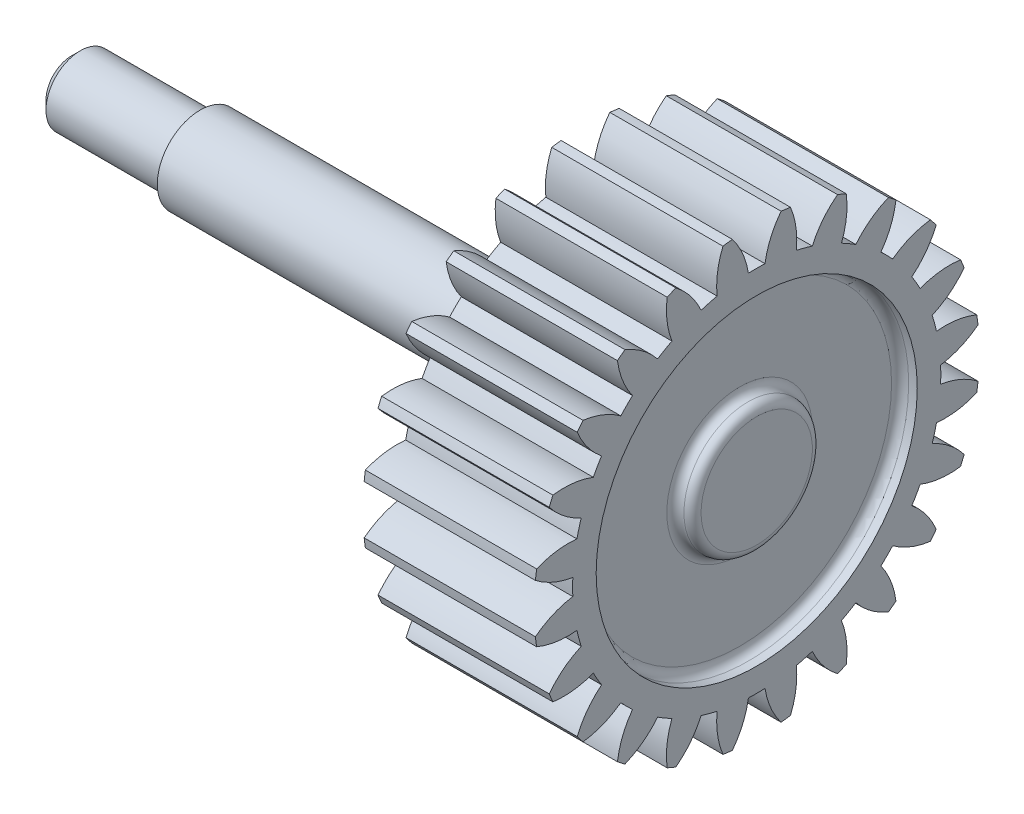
ISO-10303-21;
HEADER;
FILE_DESCRIPTION(('STEP AP214'),'2;1');
FILE_NAME('part.step','',(''),(''),'','','');
FILE_SCHEMA(('AUTOMOTIVE_DESIGN { 1 0 10303 214 1 1 1 1 }'));
ENDSEC;
DATA;
#1=APPLICATION_CONTEXT('core data for automotive mechanical design processes');
#2=APPLICATION_PROTOCOL_DEFINITION('international standard','automotive_design',2000,#1);
#3=PRODUCT_CONTEXT('',#1,'mechanical');
#4=PRODUCT('Part','Part','',(#3));
#5=PRODUCT_RELATED_PRODUCT_CATEGORY('part','',(#4));
#6=PRODUCT_DEFINITION_FORMATION('','',#4);
#7=PRODUCT_DEFINITION_CONTEXT('part definition',#1,'design');
#8=PRODUCT_DEFINITION('design','',#6,#7);
#9=PRODUCT_DEFINITION_SHAPE('','',#8);
#10=(LENGTH_UNIT() NAMED_UNIT(*) SI_UNIT(.MILLI.,.METRE.));
#11=(NAMED_UNIT(*) PLANE_ANGLE_UNIT() SI_UNIT($,.RADIAN.));
#12=(NAMED_UNIT(*) SI_UNIT($,.STERADIAN.) SOLID_ANGLE_UNIT());
#13=UNCERTAINTY_MEASURE_WITH_UNIT(LENGTH_MEASURE(1.E-05),#10,'distance_accuracy_value','');
#14=(GEOMETRIC_REPRESENTATION_CONTEXT(3) GLOBAL_UNCERTAINTY_ASSIGNED_CONTEXT((#13)) GLOBAL_UNIT_ASSIGNED_CONTEXT((#10,
#11,#12)) REPRESENTATION_CONTEXT('',''));
#15=CARTESIAN_POINT('',(0.,0.,0.));
#16=DIRECTION('',(0.,0.,1.));
#17=DIRECTION('',(1.,0.,0.));
#18=AXIS2_PLACEMENT_3D('',#15,#16,#17);
#19=CARTESIAN_POINT('',(-65.6841503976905,-6.79896704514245,20.0983224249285));
#20=DIRECTION('',(1.,0.,0.));
#21=DIRECTION('',(0.,0.,-1.));
#22=AXIS2_PLACEMENT_3D('',#19,#20,#21);
#23=CYLINDRICAL_SURFACE('',#22,2.5);
#24=CARTESIAN_POINT('',(-35.6840995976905,-6.79896704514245,20.0983224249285));
#25=DIRECTION('',(1.,0.,0.));
#26=DIRECTION('',(0.,0.,-1.));
#27=AXIS2_PLACEMENT_3D('',#24,#25,#26);
#28=CIRCLE('',#27,2.5);
#29=CARTESIAN_POINT('',(-35.6840995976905,-6.79896704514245,17.5983224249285));
#30=VERTEX_POINT('',#29);
#31=EDGE_CURVE('E1213',#30,#30,#28,.F.);
#32=ORIENTED_EDGE('',*,*,#31,.T.);
#33=EDGE_LOOP('',(#32));
#34=FACE_BOUND('',#33,.T.);
#35=CARTESIAN_POINT('',(-58.1841503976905,-6.79896704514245,20.0983224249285));
#36=DIRECTION('',(-1.,0.,0.));
#37=DIRECTION('',(0.,0.,1.));
#38=AXIS2_PLACEMENT_3D('',#35,#36,#37);
#39=CIRCLE('',#38,2.5);
#40=CARTESIAN_POINT('',(-58.1841503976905,-6.79896704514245,22.5983224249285));
#41=VERTEX_POINT('',#40);
#42=EDGE_CURVE('E1246',#41,#41,#39,.T.);
#43=ORIENTED_EDGE('',*,*,#42,.F.);
#44=EDGE_LOOP('',(#43));
#45=FACE_BOUND('',#44,.T.);
#46=ADVANCED_FACE('F39',(#34,#45),#23,.T.);
#47=CARTESIAN_POINT('',(-35.6840995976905,-6.79896704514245,20.0983224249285));
#48=DIRECTION('',(1.,0.,0.));
#49=DIRECTION('',(0.,0.,-1.));
#50=AXIS2_PLACEMENT_3D('',#47,#48,#49);
#51=PLANE('',#50);
#52=CARTESIAN_POINT('',(-35.6840995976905,-6.79896704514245,20.0983224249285));
#53=DIRECTION('',(1.,0.,0.));
#54=DIRECTION('',(0.,0.,-1.));
#55=AXIS2_PLACEMENT_3D('',#52,#53,#54);
#56=CIRCLE('',#55,3.25);
#57=CARTESIAN_POINT('',(-35.6840995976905,-6.79896704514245,16.8483224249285));
#58=VERTEX_POINT('',#57);
#59=EDGE_CURVE('E1234',#58,#58,#56,.F.);
#60=ORIENTED_EDGE('',*,*,#59,.T.);
#61=EDGE_LOOP('',(#60));
#62=FACE_BOUND('',#61,.T.);
#63=ORIENTED_EDGE('',*,*,#31,.F.);
#64=EDGE_LOOP('',(#63));
#65=FACE_BOUND('',#64,.T.);
#66=ADVANCED_FACE('F1261',(#62,#65),#51,.F.);
#67=CARTESIAN_POINT('',(-25.6840995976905,-6.79896704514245,20.0983224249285));
#68=DIRECTION('',(-1.,0.,0.));
#69=DIRECTION('',(0.,0.,1.));
#70=AXIS2_PLACEMENT_3D('',#67,#68,#69);
#71=PLANE('',#70);
#72=CARTESIAN_POINT('',(-25.6840995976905,-6.79896704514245,20.0983224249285));
#73=DIRECTION('',(-1.,0.,0.));
#74=DIRECTION('',(0.,0.,1.));
#75=AXIS2_PLACEMENT_3D('',#72,#73,#74);
#76=CIRCLE('',#75,3.25);
#77=CARTESIAN_POINT('',(-25.6840995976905,-6.79896704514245,23.3483224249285));
#78=VERTEX_POINT('',#77);
#79=EDGE_CURVE('E1225',#78,#78,#76,.F.);
#80=ORIENTED_EDGE('',*,*,#79,.T.);
#81=EDGE_LOOP('',(#80));
#82=FACE_BOUND('',#81,.T.);
#83=ADVANCED_FACE('F1269',(#82),#71,.F.);
#84=CARTESIAN_POINT('',(-25.6840995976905,-6.79896704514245,20.0983224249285));
#85=DIRECTION('',(1.,0.,0.));
#86=DIRECTION('',(0.,0.,-1.));
#87=AXIS2_PLACEMENT_3D('',#84,#85,#86);
#88=CIRCLE('',#87,9.375);
#89=CARTESIAN_POINT('',(-25.6840995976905,-6.79896704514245,10.7233224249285));
#90=VERTEX_POINT('',#89);
#91=EDGE_CURVE('E949',#90,#90,#88,.T.);
#92=ORIENTED_EDGE('',*,*,#91,.F.);
#93=EDGE_LOOP('',(#92));
#94=FACE_BOUND('',#93,.T.);
#95=CARTESIAN_POINT('',(-25.6840995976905,-1.57376513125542,30.0909429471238));
#96=DIRECTION('',(-1.,0.,0.));
#97=DIRECTION('',(0.,1.,0.));
#98=AXIS2_PLACEMENT_3D('',#95,#96,#97);
#99=CIRCLE('',#98,4.8);
#100=CARTESIAN_POINT('',(-25.6840995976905,-6.3155186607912,30.8364451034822));
#101=VERTEX_POINT('',#100);
#102=CARTESIAN_POINT('',(-25.6840995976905,-5.37629184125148,33.0202416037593));
#103=VERTEX_POINT('',#102);
#104=EDGE_CURVE('E684',#101,#103,#99,.T.);
#105=ORIENTED_EDGE('',*,*,#104,.F.);
#106=CARTESIAN_POINT('',(-25.6840995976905,-6.79896704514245,20.0983224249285));
#107=DIRECTION('',(-1.,0.,0.));
#108=DIRECTION('',(0.,1.,0.));
#109=AXIS2_PLACEMENT_3D('',#106,#107,#108);
#110=CIRCLE('',#109,10.749);
#111=CARTESIAN_POINT('',(-25.6840995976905,-7.28241542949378,30.8364451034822));
#112=VERTEX_POINT('',#111);
#113=EDGE_CURVE('E689',#112,#101,#110,.T.);
#114=ORIENTED_EDGE('',*,*,#113,.F.);
#115=CARTESIAN_POINT('',(-25.6840995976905,-12.0241689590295,30.0909429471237));
#116=DIRECTION('',(-1.,0.,0.));
#117=DIRECTION('',(0.,1.,0.));
#118=AXIS2_PLACEMENT_3D('',#115,#116,#117);
#119=CIRCLE('',#118,4.8);
#120=CARTESIAN_POINT('',(-25.6840995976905,-8.22164224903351,33.0202416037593));
#121=VERTEX_POINT('',#120);
#122=EDGE_CURVE('E686',#121,#112,#119,.T.);
#123=ORIENTED_EDGE('',*,*,#122,.F.);
#124=CARTESIAN_POINT('',(-25.6840995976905,-6.79896704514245,20.0983224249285));
#125=DIRECTION('',(-1.,0.,0.));
#126=DIRECTION('',(0.,0.,1.));
#127=AXIS2_PLACEMENT_3D('',#124,#125,#126);
#128=CIRCLE('',#127,13.);
#129=CARTESIAN_POINT('',(-25.6840995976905,-8.76920710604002,32.9481533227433));
#130=VERTEX_POINT('',#129);
#131=EDGE_CURVE('E1731',#130,#121,#128,.T.);
#132=ORIENTED_EDGE('',*,*,#131,.F.);
#133=CARTESIAN_POINT('',(-25.6840995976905,-4.33809007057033,31.1028344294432));
#134=DIRECTION('',(-1.,0.,0.));
#135=DIRECTION('',(0.,0.965925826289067,0.258819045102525));
#136=AXIS2_PLACEMENT_3D('',#133,#134,#135);
#137=CIRCLE('',#136,4.8);
#138=CARTESIAN_POINT('',(-25.6840995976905,-9.11122242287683,30.595678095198));
#139=VERTEX_POINT('',#138);
#140=EDGE_CURVE('E785',#139,#130,#137,.T.);
#141=ORIENTED_EDGE('',*,*,#140,.F.);
#142=CARTESIAN_POINT('',(-25.6840995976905,-6.79896704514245,20.0983224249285));
#143=DIRECTION('',(-1.,0.,0.));
#144=DIRECTION('',(0.,0.965925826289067,0.258819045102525));
#145=AXIS2_PLACEMENT_3D('',#142,#143,#144);
#146=CIRCLE('',#145,10.749);
#147=CARTESIAN_POINT('',(-25.6840995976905,-10.0451729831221,30.3454267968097));
#148=VERTEX_POINT('',#147);
#149=EDGE_CURVE('E790',#148,#139,#146,.T.);
#150=ORIENTED_EDGE('',*,*,#149,.F.);
#151=CARTESIAN_POINT('',(-25.6840995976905,-14.4324050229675,28.3980708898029));
#152=DIRECTION('',(-1.,0.,0.));
#153=DIRECTION('',(0.,0.965925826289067,0.258819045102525));
#154=AXIS2_PLACEMENT_3D('',#151,#152,#153);
#155=CIRCLE('',#154,4.8);
#156=CARTESIAN_POINT('',(-25.6840995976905,-11.5176045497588,32.211722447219));
#157=VERTEX_POINT('',#156);
#158=EDGE_CURVE('E787',#157,#148,#155,.T.);
#159=ORIENTED_EDGE('',*,*,#158,.F.);
#160=CARTESIAN_POINT('',(-25.6840995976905,-12.027853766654,32.0003703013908));
#161=VERTEX_POINT('',#160);
#162=EDGE_CURVE('E1725',#161,#157,#128,.T.);
#163=ORIENTED_EDGE('',*,*,#162,.F.);
#164=CARTESIAN_POINT('',(-25.6840995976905,-7.27011970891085,31.3647866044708));
#165=DIRECTION('',(-1.,0.,0.));
#166=DIRECTION('',(0.,0.866025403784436,0.500000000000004));
#167=AXIS2_PLACEMENT_3D('',#164,#165,#166);
#168=CIRCLE('',#167,4.8);
#169=CARTESIAN_POINT('',(-25.6840995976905,-11.7493498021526,29.6395336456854));
#170=VERTEX_POINT('',#169);
#171=EDGE_CURVE('E819',#170,#161,#168,.T.);
#172=ORIENTED_EDGE('',*,*,#171,.F.);
#173=CARTESIAN_POINT('',(-25.6840995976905,-6.79896704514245,20.0983224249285));
#174=DIRECTION('',(-1.,0.,0.));
#175=DIRECTION('',(0.,0.866025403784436,0.500000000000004));
#176=AXIS2_PLACEMENT_3D('',#173,#174,#175);
#177=CIRCLE('',#176,10.749);
#178=CARTESIAN_POINT('',(-25.6840995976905,-12.5867069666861,29.1560852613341));
#179=VERTEX_POINT('',#178);
#180=EDGE_CURVE('E824',#179,#170,#177,.T.);
#181=ORIENTED_EDGE('',*,*,#180,.F.);
#182=CARTESIAN_POINT('',(-25.6840995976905,-16.3204349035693,26.1395846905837));
#183=DIRECTION('',(-1.,0.,0.));
#184=DIRECTION('',(0.,0.866025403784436,0.500000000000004));
#185=AXIS2_PLACEMENT_3D('',#182,#183,#184);
#186=CIRCLE('',#185,4.8);
#187=CARTESIAN_POINT('',(-25.6840995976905,-14.4919995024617,30.5776950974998));
#188=VERTEX_POINT('',#187);
#189=EDGE_CURVE('E821',#188,#179,#186,.T.);
#190=ORIENTED_EDGE('',*,*,#189,.F.);
#191=CARTESIAN_POINT('',(-25.6840995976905,-14.9301604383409,30.2414823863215));
#192=VERTEX_POINT('',#191);
#193=EDGE_CURVE('E1719',#192,#188,#128,.T.);
#194=ORIENTED_EDGE('',*,*,#193,.F.);
#195=CARTESIAN_POINT('',(-25.6840995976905,-10.1700410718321,30.8589478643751));
#196=DIRECTION('',(-1.,0.,0.));
#197=DIRECTION('',(0.,0.707106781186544,0.707106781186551));
#198=AXIS2_PLACEMENT_3D('',#195,#196,#197);
#199=CIRCLE('',#198,4.8);
#200=CARTESIAN_POINT('',(-25.6840995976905,-14.0501167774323,28.0331714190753));
#201=VERTEX_POINT('',#200);
#202=EDGE_CURVE('E802',#201,#192,#199,.T.);
#203=ORIENTED_EDGE('',*,*,#202,.F.);
#204=CARTESIAN_POINT('',(-25.6840995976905,-6.79896704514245,20.0983224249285));
#205=DIRECTION('',(-1.,0.,0.));
#206=DIRECTION('',(0.,0.707106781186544,0.707106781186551));
#207=AXIS2_PLACEMENT_3D('',#204,#205,#206);
#208=CIRCLE('',#207,10.749);
#209=CARTESIAN_POINT('',(-25.6840995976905,-14.7338160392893,27.3494721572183));
#210=VERTEX_POINT('',#209);
#211=EDGE_CURVE('E807',#210,#201,#208,.T.);
#212=ORIENTED_EDGE('',*,*,#211,.F.);
#213=CARTESIAN_POINT('',(-25.6840995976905,-17.559592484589,23.4693964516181));
#214=DIRECTION('',(-1.,0.,0.));
#215=DIRECTION('',(0.,0.707106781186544,0.707106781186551));
#216=AXIS2_PLACEMENT_3D('',#213,#214,#215);
#217=CIRCLE('',#216,4.8);
#218=CARTESIAN_POINT('',(-25.6840995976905,-16.9421270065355,28.2295158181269));
#219=VERTEX_POINT('',#218);
#220=EDGE_CURVE('E804',#219,#210,#217,.T.);
#221=ORIENTED_EDGE('',*,*,#220,.F.);
#222=CARTESIAN_POINT('',(-25.6840995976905,-17.2783397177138,27.7913548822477));
#223=VERTEX_POINT('',#222);
#224=EDGE_CURVE('E1713',#223,#219,#128,.T.);
#225=ORIENTED_EDGE('',*,*,#224,.F.);
#226=CARTESIAN_POINT('',(-25.6840995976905,-12.8402293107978,29.6197902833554));
#227=DIRECTION('',(-1.,0.,0.));
#228=DIRECTION('',(0.,0.499999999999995,0.866025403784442));
#229=AXIS2_PLACEMENT_3D('',#226,#227,#228);
#230=CIRCLE('',#229,4.8);
#231=CARTESIAN_POINT('',(-25.6840995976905,-15.8567298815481,25.8860623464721));
#232=VERTEX_POINT('',#231);
#233=EDGE_CURVE('E732',#232,#223,#230,.T.);
#234=ORIENTED_EDGE('',*,*,#233,.F.);
#235=CARTESIAN_POINT('',(-25.6840995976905,-6.79896704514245,20.0983224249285));
#236=DIRECTION('',(-1.,0.,0.));
#237=DIRECTION('',(0.,0.499999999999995,0.866025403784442));
#238=AXIS2_PLACEMENT_3D('',#235,#236,#237);
#239=CIRCLE('',#238,10.749);
#240=CARTESIAN_POINT('',(-25.6840995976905,-16.3401782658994,25.0487051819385));
#241=VERTEX_POINT('',#240);
#242=EDGE_CURVE('E737',#241,#232,#239,.T.);
#243=ORIENTED_EDGE('',*,*,#242,.F.);
#244=CARTESIAN_POINT('',(-25.6840995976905,-18.0654312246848,20.5694750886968));
#245=DIRECTION('',(-1.,0.,0.));
#246=DIRECTION('',(0.,0.499999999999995,0.866025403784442));
#247=AXIS2_PLACEMENT_3D('',#244,#245,#246);
#248=CIRCLE('',#247,4.8);
#249=CARTESIAN_POINT('',(-25.6840995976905,-18.7010149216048,25.32720914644));
#250=VERTEX_POINT('',#249);
#251=EDGE_CURVE('E734',#250,#241,#248,.T.);
#252=ORIENTED_EDGE('',*,*,#251,.F.);
#253=CARTESIAN_POINT('',(-25.6840995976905,-18.912367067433,24.8169599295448));
#254=VERTEX_POINT('',#253);
#255=EDGE_CURVE('E1707',#254,#250,#128,.T.);
#256=ORIENTED_EDGE('',*,*,#255,.F.);
#257=CARTESIAN_POINT('',(-25.6840995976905,-15.0987155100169,27.7317604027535));
#258=DIRECTION('',(-1.,0.,0.));
#259=DIRECTION('',(0.,0.258819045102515,0.96592582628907));
#260=AXIS2_PLACEMENT_3D('',#257,#258,#259);
#261=CIRCLE('',#260,4.8);
#262=CARTESIAN_POINT('',(-25.6840995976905,-17.0460714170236,23.3445283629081));
#263=VERTEX_POINT('',#262);
#264=EDGE_CURVE('E751',#263,#254,#261,.T.);
#265=ORIENTED_EDGE('',*,*,#264,.F.);
#266=CARTESIAN_POINT('',(-25.6840995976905,-6.79896704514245,20.0983224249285));
#267=DIRECTION('',(-1.,0.,0.));
#268=DIRECTION('',(0.,0.258819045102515,0.96592582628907));
#269=AXIS2_PLACEMENT_3D('',#266,#267,#268);
#270=CIRCLE('',#269,10.749);
#271=CARTESIAN_POINT('',(-25.6840995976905,-17.2963227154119,22.4105778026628));
#272=VERTEX_POINT('',#271);
#273=EDGE_CURVE('E756',#272,#263,#270,.T.);
#274=ORIENTED_EDGE('',*,*,#273,.F.);
#275=CARTESIAN_POINT('',(-25.6840995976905,-17.8034790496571,17.6374454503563));
#276=DIRECTION('',(-1.,0.,0.));
#277=DIRECTION('',(0.,0.258819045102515,0.96592582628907));
#278=AXIS2_PLACEMENT_3D('',#275,#276,#277);
#279=CIRCLE('',#278,4.8);
#280=CARTESIAN_POINT('',(-25.6840995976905,-19.6487979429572,22.068562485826));
#281=VERTEX_POINT('',#280);
#282=EDGE_CURVE('E753',#281,#272,#279,.T.);
#283=ORIENTED_EDGE('',*,*,#282,.F.);
#284=CARTESIAN_POINT('',(-25.6840995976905,-19.7208862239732,21.5209976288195));
#285=VERTEX_POINT('',#284);
#286=EDGE_CURVE('E1701',#285,#281,#128,.T.);
#287=ORIENTED_EDGE('',*,*,#286,.F.);
#288=CARTESIAN_POINT('',(-25.6840995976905,-16.7915875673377,25.3235243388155));
#289=DIRECTION('',(-1.,0.,0.));
#290=DIRECTION('',(0.,0.,1.));
#291=AXIS2_PLACEMENT_3D('',#288,#289,#290);
#292=CIRCLE('',#291,4.8);
#293=CARTESIAN_POINT('',(-25.6840995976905,-17.5370897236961,20.5817708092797));
#294=VERTEX_POINT('',#293);
#295=EDGE_CURVE('E768',#294,#285,#292,.T.);
#296=ORIENTED_EDGE('',*,*,#295,.F.);
#297=CARTESIAN_POINT('',(-25.6840995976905,-6.79896704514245,20.0983224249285));
#298=DIRECTION('',(-1.,0.,0.));
#299=DIRECTION('',(0.,0.,1.));
#300=AXIS2_PLACEMENT_3D('',#297,#298,#299);
#301=CIRCLE('',#300,10.749);
#302=CARTESIAN_POINT('',(-25.6840995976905,-17.5370897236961,19.6148740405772));
#303=VERTEX_POINT('',#302);
#304=EDGE_CURVE('E773',#303,#294,#301,.T.);
#305=ORIENTED_EDGE('',*,*,#304,.F.);
#306=CARTESIAN_POINT('',(-25.6840995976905,-16.7915875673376,14.8731205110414));
#307=DIRECTION('',(-1.,0.,0.));
#308=DIRECTION('',(0.,0.,1.));
#309=AXIS2_PLACEMENT_3D('',#306,#307,#308);
#310=CIRCLE('',#309,4.8);
#311=CARTESIAN_POINT('',(-25.6840995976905,-19.7208862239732,18.6756472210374));
#312=VERTEX_POINT('',#311);
#313=EDGE_CURVE('E770',#312,#303,#310,.T.);
#314=ORIENTED_EDGE('',*,*,#313,.F.);
#315=CARTESIAN_POINT('',(-25.6840995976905,-19.6487979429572,18.1280823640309));
#316=VERTEX_POINT('',#315);
#317=EDGE_CURVE('E1695',#316,#312,#128,.T.);
#318=ORIENTED_EDGE('',*,*,#317,.F.);
#319=CARTESIAN_POINT('',(-25.6840995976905,-17.8034790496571,22.5591993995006));
#320=DIRECTION('',(-1.,0.,0.));
#321=DIRECTION('',(0.,-0.258819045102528,0.965925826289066));
#322=AXIS2_PLACEMENT_3D('',#319,#320,#321);
#323=CIRCLE('',#322,4.8);
#324=CARTESIAN_POINT('',(-25.6840995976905,-17.2963227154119,17.7860670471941));
#325=VERTEX_POINT('',#324);
#326=EDGE_CURVE('E887',#325,#316,#323,.T.);
#327=ORIENTED_EDGE('',*,*,#326,.F.);
#328=CARTESIAN_POINT('',(-25.6840995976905,-6.79896704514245,20.0983224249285));
#329=DIRECTION('',(-1.,0.,0.));
#330=DIRECTION('',(0.,-0.258819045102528,0.965925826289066));
#331=AXIS2_PLACEMENT_3D('',#328,#329,#330);
#332=CIRCLE('',#331,10.749);
#333=CARTESIAN_POINT('',(-25.6840995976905,-17.0460714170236,16.8521164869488));
#334=VERTEX_POINT('',#333);
#335=EDGE_CURVE('E892',#334,#325,#332,.T.);
#336=ORIENTED_EDGE('',*,*,#335,.F.);
#337=CARTESIAN_POINT('',(-25.6840995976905,-15.0987155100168,12.4648844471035));
#338=DIRECTION('',(-1.,0.,0.));
#339=DIRECTION('',(0.,-0.258819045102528,0.965925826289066));
#340=AXIS2_PLACEMENT_3D('',#337,#338,#339);
#341=CIRCLE('',#340,4.8);
#342=CARTESIAN_POINT('',(-25.6840995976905,-18.9123670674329,15.3796849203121));
#343=VERTEX_POINT('',#342);
#344=EDGE_CURVE('E889',#343,#334,#341,.T.);
#345=ORIENTED_EDGE('',*,*,#344,.F.);
#346=CARTESIAN_POINT('',(-25.6840995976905,-18.7010149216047,14.8694357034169));
#347=VERTEX_POINT('',#346);
#348=EDGE_CURVE('E1689',#347,#343,#128,.T.);
#349=ORIENTED_EDGE('',*,*,#348,.F.);
#350=CARTESIAN_POINT('',(-25.6840995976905,-18.0654312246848,19.6271697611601));
#351=DIRECTION('',(-1.,0.,0.));
#352=DIRECTION('',(0.,-0.500000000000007,0.866025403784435));
#353=AXIS2_PLACEMENT_3D('',#350,#351,#352);
#354=CIRCLE('',#353,4.8);
#355=CARTESIAN_POINT('',(-25.6840995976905,-16.3401782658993,15.1479396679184));
#356=VERTEX_POINT('',#355);
#357=EDGE_CURVE('E904',#356,#347,#354,.T.);
#358=ORIENTED_EDGE('',*,*,#357,.F.);
#359=CARTESIAN_POINT('',(-25.6840995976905,-6.79896704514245,20.0983224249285));
#360=DIRECTION('',(-1.,0.,0.));
#361=DIRECTION('',(0.,-0.500000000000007,0.866025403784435));
#362=AXIS2_PLACEMENT_3D('',#359,#360,#361);
#363=CIRCLE('',#362,10.749);
#364=CARTESIAN_POINT('',(-25.6840995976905,-15.856729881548,14.3105825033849));
#365=VERTEX_POINT('',#364);
#366=EDGE_CURVE('E909',#365,#356,#363,.T.);
#367=ORIENTED_EDGE('',*,*,#366,.F.);
#368=CARTESIAN_POINT('',(-25.6840995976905,-12.8402293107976,10.5768545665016));
#369=DIRECTION('',(-1.,0.,0.));
#370=DIRECTION('',(0.,-0.500000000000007,0.866025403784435));
#371=AXIS2_PLACEMENT_3D('',#368,#369,#370);
#372=CIRCLE('',#371,4.8);
#373=CARTESIAN_POINT('',(-25.6840995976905,-17.2783397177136,12.4052899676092));
#374=VERTEX_POINT('',#373);
#375=EDGE_CURVE('E906',#374,#365,#372,.T.);
#376=ORIENTED_EDGE('',*,*,#375,.F.);
#377=CARTESIAN_POINT('',(-25.6840995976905,-16.9421270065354,11.96712903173));
#378=VERTEX_POINT('',#377);
#379=EDGE_CURVE('E1683',#378,#374,#128,.T.);
#380=ORIENTED_EDGE('',*,*,#379,.F.);
#381=CARTESIAN_POINT('',(-25.6840995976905,-17.559592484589,16.7272483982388));
#382=DIRECTION('',(-1.,0.,0.));
#383=DIRECTION('',(0.,-0.707106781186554,0.707106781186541));
#384=AXIS2_PLACEMENT_3D('',#381,#382,#383);
#385=CIRCLE('',#384,4.8);
#386=CARTESIAN_POINT('',(-25.6840995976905,-14.7338160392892,12.8471726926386));
#387=VERTEX_POINT('',#386);
#388=EDGE_CURVE('E870',#387,#378,#385,.T.);
#389=ORIENTED_EDGE('',*,*,#388,.F.);
#390=CARTESIAN_POINT('',(-25.6840995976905,-6.79896704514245,20.0983224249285));
#391=DIRECTION('',(-1.,0.,0.));
#392=DIRECTION('',(0.,-0.707106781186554,0.707106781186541));
#393=AXIS2_PLACEMENT_3D('',#390,#391,#392);
#394=CIRCLE('',#393,10.749);
#395=CARTESIAN_POINT('',(-25.6840995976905,-14.0501167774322,12.1634734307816));
#396=VERTEX_POINT('',#395);
#397=EDGE_CURVE('E875',#396,#387,#394,.T.);
#398=ORIENTED_EDGE('',*,*,#397,.F.);
#399=CARTESIAN_POINT('',(-25.6840995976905,-10.170041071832,9.33769698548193));
#400=DIRECTION('',(-1.,0.,0.));
#401=DIRECTION('',(0.,-0.707106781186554,0.707106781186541));
#402=AXIS2_PLACEMENT_3D('',#399,#400,#401);
#403=CIRCLE('',#402,4.8);
#404=CARTESIAN_POINT('',(-25.6840995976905,-14.9301604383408,9.95516246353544));
#405=VERTEX_POINT('',#404);
#406=EDGE_CURVE('E872',#405,#396,#403,.T.);
#407=ORIENTED_EDGE('',*,*,#406,.F.);
#408=CARTESIAN_POINT('',(-25.6840995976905,-14.4919995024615,9.61894975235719));
#409=VERTEX_POINT('',#408);
#410=EDGE_CURVE('E1677',#409,#405,#128,.T.);
#411=ORIENTED_EDGE('',*,*,#410,.F.);
#412=CARTESIAN_POINT('',(-25.6840995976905,-16.3204349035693,14.0570601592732));
#413=DIRECTION('',(-1.,0.,0.));
#414=DIRECTION('',(0.,-0.866025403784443,0.499999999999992));
#415=AXIS2_PLACEMENT_3D('',#412,#413,#414);
#416=CIRCLE('',#415,4.8);
#417=CARTESIAN_POINT('',(-25.6840995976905,-12.5867069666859,11.0405595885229));
#418=VERTEX_POINT('',#417);
#419=EDGE_CURVE('E834',#418,#409,#416,.T.);
#420=ORIENTED_EDGE('',*,*,#419,.F.);
#421=CARTESIAN_POINT('',(-25.6840995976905,-6.79896704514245,20.0983224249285));
#422=DIRECTION('',(-1.,0.,0.));
#423=DIRECTION('',(0.,-0.866025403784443,0.499999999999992));
#424=AXIS2_PLACEMENT_3D('',#421,#422,#423);
#425=CIRCLE('',#424,10.749);
#426=CARTESIAN_POINT('',(-25.6840995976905,-11.7493498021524,10.5571112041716));
#427=VERTEX_POINT('',#426);
#428=EDGE_CURVE('E839',#427,#418,#425,.T.);
#429=ORIENTED_EDGE('',*,*,#428,.F.);
#430=CARTESIAN_POINT('',(-25.6840995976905,-7.27011970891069,8.83185824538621));
#431=DIRECTION('',(-1.,0.,0.));
#432=DIRECTION('',(0.,-0.866025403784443,0.499999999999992));
#433=AXIS2_PLACEMENT_3D('',#430,#431,#432);
#434=CIRCLE('',#433,4.8);
#435=CARTESIAN_POINT('',(-25.6840995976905,-12.0278537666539,8.1962745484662));
#436=VERTEX_POINT('',#435);
#437=EDGE_CURVE('E836',#436,#427,#434,.T.);
#438=ORIENTED_EDGE('',*,*,#437,.F.);
#439=CARTESIAN_POINT('',(-25.6840995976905,-11.5176045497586,7.98492240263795));
#440=VERTEX_POINT('',#439);
#441=EDGE_CURVE('E1671',#440,#436,#128,.T.);
#442=ORIENTED_EDGE('',*,*,#441,.F.);
#443=CARTESIAN_POINT('',(-25.6840995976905,-14.4324050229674,11.798573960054));
#444=DIRECTION('',(-1.,0.,0.));
#445=DIRECTION('',(0.,-0.965925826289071,0.258819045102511));
#446=AXIS2_PLACEMENT_3D('',#443,#444,#445);
#447=CIRCLE('',#446,4.8);
#448=CARTESIAN_POINT('',(-25.6840995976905,-10.045172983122,9.85121805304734));
#449=VERTEX_POINT('',#448);
#450=EDGE_CURVE('E853',#449,#440,#447,.T.);
#451=ORIENTED_EDGE('',*,*,#450,.F.);
#452=CARTESIAN_POINT('',(-25.6840995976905,-6.79896704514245,20.0983224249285));
#453=DIRECTION('',(-1.,0.,0.));
#454=DIRECTION('',(0.,-0.965925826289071,0.258819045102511));
#455=AXIS2_PLACEMENT_3D('',#452,#453,#454);
#456=CIRCLE('',#455,10.749);
#457=CARTESIAN_POINT('',(-25.6840995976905,-9.11122242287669,9.60096675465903));
#458=VERTEX_POINT('',#457);
#459=EDGE_CURVE('E858',#458,#449,#456,.T.);
#460=ORIENTED_EDGE('',*,*,#459,.F.);
#461=CARTESIAN_POINT('',(-25.6840995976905,-4.33809007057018,9.09381042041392));
#462=DIRECTION('',(-1.,0.,0.));
#463=DIRECTION('',(0.,-0.965925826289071,0.258819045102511));
#464=AXIS2_PLACEMENT_3D('',#461,#462,#463);
#465=CIRCLE('',#464,4.8);
#466=CARTESIAN_POINT('',(-25.6840995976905,-8.76920710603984,7.24849152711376));
#467=VERTEX_POINT('',#466);
#468=EDGE_CURVE('E855',#467,#458,#465,.T.);
#469=ORIENTED_EDGE('',*,*,#468,.F.);
#470=CARTESIAN_POINT('',(-25.6840995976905,-8.22164224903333,7.17640324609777));
#471=VERTEX_POINT('',#470);
#472=EDGE_CURVE('E1665',#471,#467,#128,.T.);
#473=ORIENTED_EDGE('',*,*,#472,.F.);
#474=CARTESIAN_POINT('',(-25.6840995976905,-12.0241689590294,10.1057019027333));
#475=DIRECTION('',(-1.,0.,0.));
#476=DIRECTION('',(0.,-1.,0.));
#477=AXIS2_PLACEMENT_3D('',#474,#475,#476);
#478=CIRCLE('',#477,4.8);
#479=CARTESIAN_POINT('',(-25.6840995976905,-7.28241542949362,9.36019974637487));
#480=VERTEX_POINT('',#479);
#481=EDGE_CURVE('E972',#480,#471,#478,.T.);
#482=ORIENTED_EDGE('',*,*,#481,.F.);
#483=CARTESIAN_POINT('',(-25.6840995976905,-6.79896704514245,20.0983224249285));
#484=DIRECTION('',(-1.,0.,0.));
#485=DIRECTION('',(0.,-1.,0.));
#486=AXIS2_PLACEMENT_3D('',#483,#484,#485);
#487=CIRCLE('',#486,10.749);
#488=CARTESIAN_POINT('',(-25.6840995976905,-6.31551866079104,9.36019974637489));
#489=VERTEX_POINT('',#488);
#490=EDGE_CURVE('E977',#489,#480,#487,.T.);
#491=ORIENTED_EDGE('',*,*,#490,.F.);
#492=CARTESIAN_POINT('',(-25.6840995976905,-1.57376513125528,10.1057019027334));
#493=DIRECTION('',(-1.,0.,0.));
#494=DIRECTION('',(0.,-1.,0.));
#495=AXIS2_PLACEMENT_3D('',#492,#493,#494);
#496=CIRCLE('',#495,4.8);
#497=CARTESIAN_POINT('',(-25.6840995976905,-5.3762918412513,7.1764032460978));
#498=VERTEX_POINT('',#497);
#499=EDGE_CURVE('E974',#498,#489,#496,.T.);
#500=ORIENTED_EDGE('',*,*,#499,.F.);
#501=CARTESIAN_POINT('',(-25.6840995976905,-4.82872698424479,7.2484915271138));
#502=VERTEX_POINT('',#501);
#503=EDGE_CURVE('E1659',#502,#498,#128,.T.);
#504=ORIENTED_EDGE('',*,*,#503,.F.);
#505=CARTESIAN_POINT('',(-25.6840995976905,-9.25984401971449,9.09381042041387));
#506=DIRECTION('',(-1.,0.,0.));
#507=DIRECTION('',(0.,-0.965925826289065,-0.258819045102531));
#508=AXIS2_PLACEMENT_3D('',#505,#506,#507);
#509=CIRCLE('',#508,4.8);
#510=CARTESIAN_POINT('',(-25.6840995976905,-4.48671166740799,9.60096675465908));
#511=VERTEX_POINT('',#510);
#512=EDGE_CURVE('E989',#511,#502,#509,.T.);
#513=ORIENTED_EDGE('',*,*,#512,.F.);
#514=CARTESIAN_POINT('',(-25.6840995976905,-6.79896704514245,20.0983224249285));
#515=DIRECTION('',(-1.,0.,0.));
#516=DIRECTION('',(0.,-0.965925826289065,-0.258819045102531));
#517=AXIS2_PLACEMENT_3D('',#514,#515,#516);
#518=CIRCLE('',#517,10.749);
#519=CARTESIAN_POINT('',(-25.6840995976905,-3.55276110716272,9.85121805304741));
#520=VERTEX_POINT('',#519);
#521=EDGE_CURVE('E994',#520,#511,#518,.T.);
#522=ORIENTED_EDGE('',*,*,#521,.F.);
#523=CARTESIAN_POINT('',(-25.6840995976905,0.834470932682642,11.7985739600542));
#524=DIRECTION('',(-1.,0.,0.));
#525=DIRECTION('',(0.,-0.965925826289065,-0.258819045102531));
#526=AXIS2_PLACEMENT_3D('',#523,#524,#525);
#527=CIRCLE('',#526,4.8);
#528=CARTESIAN_POINT('',(-25.6840995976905,-2.08032954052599,7.98492240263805));
#529=VERTEX_POINT('',#528);
#530=EDGE_CURVE('E991',#529,#520,#527,.T.);
#531=ORIENTED_EDGE('',*,*,#530,.F.);
#532=CARTESIAN_POINT('',(-25.6840995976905,-1.57008032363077,8.19627454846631));
#533=VERTEX_POINT('',#532);
#534=EDGE_CURVE('E1653',#533,#529,#128,.T.);
#535=ORIENTED_EDGE('',*,*,#534,.F.);
#536=CARTESIAN_POINT('',(-25.6840995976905,-6.32781438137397,8.83185824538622));
#537=DIRECTION('',(-1.,0.,0.));
#538=DIRECTION('',(0.,-0.866025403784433,-0.50000000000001));
#539=AXIS2_PLACEMENT_3D('',#536,#537,#538);
#540=CIRCLE('',#539,4.8);
#541=CARTESIAN_POINT('',(-25.6840995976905,-1.84858428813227,10.5571112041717));
#542=VERTEX_POINT('',#541);
#543=EDGE_CURVE('E1006',#542,#533,#540,.T.);
#544=ORIENTED_EDGE('',*,*,#543,.F.);
#545=CARTESIAN_POINT('',(-25.6840995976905,-6.79896704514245,20.0983224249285));
#546=DIRECTION('',(-1.,0.,0.));
#547=DIRECTION('',(0.,-0.866025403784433,-0.50000000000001));
#548=AXIS2_PLACEMENT_3D('',#545,#546,#547);
#549=CIRCLE('',#548,10.749);
#550=CARTESIAN_POINT('',(-25.6840995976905,-1.01122712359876,11.040559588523));
#551=VERTEX_POINT('',#550);
#552=EDGE_CURVE('E1011',#551,#542,#549,.T.);
#553=ORIENTED_EDGE('',*,*,#552,.F.);
#554=CARTESIAN_POINT('',(-25.6840995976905,2.72250081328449,14.0570601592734));
#555=DIRECTION('',(-1.,0.,0.));
#556=DIRECTION('',(0.,-0.866025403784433,-0.50000000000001));
#557=AXIS2_PLACEMENT_3D('',#554,#555,#556);
#558=CIRCLE('',#557,4.8);
#559=CARTESIAN_POINT('',(-25.6840995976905,0.89406541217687,9.61894975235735));
#560=VERTEX_POINT('',#559);
#561=EDGE_CURVE('E1008',#560,#551,#558,.T.);
#562=ORIENTED_EDGE('',*,*,#561,.F.);
#563=CARTESIAN_POINT('',(-25.6840995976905,1.3322263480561,9.95516246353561));
#564=VERTEX_POINT('',#563);
#565=EDGE_CURVE('E1647',#564,#560,#128,.T.);
#566=ORIENTED_EDGE('',*,*,#565,.F.);
#567=CARTESIAN_POINT('',(-25.6840995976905,-3.42789301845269,9.337696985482));
#568=DIRECTION('',(-1.,0.,0.));
#569=DIRECTION('',(0.,-0.707106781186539,-0.707106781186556));
#570=AXIS2_PLACEMENT_3D('',#567,#568,#569);
#571=CIRCLE('',#570,4.8);
#572=CARTESIAN_POINT('',(-25.6840995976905,0.452182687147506,12.1634734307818));
#573=VERTEX_POINT('',#572);
#574=EDGE_CURVE('E955',#573,#564,#571,.T.);
#575=ORIENTED_EDGE('',*,*,#574,.F.);
#576=CARTESIAN_POINT('',(-25.6840995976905,-6.79896704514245,20.0983224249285));
#577=DIRECTION('',(-1.,0.,0.));
#578=DIRECTION('',(0.,-0.707106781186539,-0.707106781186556));
#579=AXIS2_PLACEMENT_3D('',#576,#577,#578);
#580=CIRCLE('',#579,10.749);
#581=CARTESIAN_POINT('',(-25.6840995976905,1.13588194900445,12.8471726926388));
#582=VERTEX_POINT('',#581);
#583=EDGE_CURVE('E960',#582,#573,#580,.T.);
#584=ORIENTED_EDGE('',*,*,#583,.F.);
#585=CARTESIAN_POINT('',(-25.6840995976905,3.96165839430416,16.727248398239));
#586=DIRECTION('',(-1.,0.,0.));
#587=DIRECTION('',(0.,-0.707106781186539,-0.707106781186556));
#588=AXIS2_PLACEMENT_3D('',#585,#586,#587);
#589=CIRCLE('',#588,4.8);
#590=CARTESIAN_POINT('',(-25.6840995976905,3.34419291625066,11.9671290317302));
#591=VERTEX_POINT('',#590);
#592=EDGE_CURVE('E957',#591,#582,#589,.T.);
#593=ORIENTED_EDGE('',*,*,#592,.F.);
#594=CARTESIAN_POINT('',(-25.6840995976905,3.68040562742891,12.4052899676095));
#595=VERTEX_POINT('',#594);
#596=EDGE_CURVE('E1641',#595,#591,#128,.T.);
#597=ORIENTED_EDGE('',*,*,#596,.F.);
#598=CARTESIAN_POINT('',(-25.6840995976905,-0.757704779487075,10.5768545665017));
#599=DIRECTION('',(-1.,0.,0.));
#600=DIRECTION('',(0.,-0.499999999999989,-0.866025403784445));
#601=AXIS2_PLACEMENT_3D('',#598,#599,#600);
#602=CIRCLE('',#601,4.8);
#603=CARTESIAN_POINT('',(-25.6840995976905,2.25879579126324,14.3105825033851));
#604=VERTEX_POINT('',#603);
#605=EDGE_CURVE('E919',#604,#595,#602,.T.);
#606=ORIENTED_EDGE('',*,*,#605,.F.);
#607=CARTESIAN_POINT('',(-25.6840995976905,-6.79896704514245,20.0983224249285));
#608=DIRECTION('',(-1.,0.,0.));
#609=DIRECTION('',(0.,-0.499999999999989,-0.866025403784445));
#610=AXIS2_PLACEMENT_3D('',#607,#608,#609);
#611=CIRCLE('',#610,10.749);
#612=CARTESIAN_POINT('',(-25.6840995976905,2.74224417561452,15.1479396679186));
#613=VERTEX_POINT('',#612);
#614=EDGE_CURVE('E924',#613,#604,#611,.T.);
#615=ORIENTED_EDGE('',*,*,#614,.F.);
#616=CARTESIAN_POINT('',(-25.6840995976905,4.46749713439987,19.6271697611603));
#617=DIRECTION('',(-1.,0.,0.));
#618=DIRECTION('',(0.,-0.499999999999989,-0.866025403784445));
#619=AXIS2_PLACEMENT_3D('',#616,#617,#618);
#620=CIRCLE('',#619,4.8);
#621=CARTESIAN_POINT('',(-25.6840995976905,5.1030808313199,14.8694357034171));
#622=VERTEX_POINT('',#621);
#623=EDGE_CURVE('E921',#622,#613,#620,.T.);
#624=ORIENTED_EDGE('',*,*,#623,.F.);
#625=CARTESIAN_POINT('',(-25.6840995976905,5.31443297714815,15.3796849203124));
#626=VERTEX_POINT('',#625);
#627=EDGE_CURVE('E1162',#626,#622,#128,.T.);
#628=ORIENTED_EDGE('',*,*,#627,.F.);
#629=CARTESIAN_POINT('',(-25.6840995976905,1.50078141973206,12.4648844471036));
#630=DIRECTION('',(-1.,0.,0.));
#631=DIRECTION('',(0.,-0.258819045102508,-0.965925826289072));
#632=AXIS2_PLACEMENT_3D('',#629,#630,#631);
#633=CIRCLE('',#632,4.8);
#634=CARTESIAN_POINT('',(-25.6840995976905,3.44813732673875,16.8521164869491));
#635=VERTEX_POINT('',#634);
#636=EDGE_CURVE('E938',#635,#626,#633,.T.);
#637=ORIENTED_EDGE('',*,*,#636,.F.);
#638=CARTESIAN_POINT('',(-25.6840995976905,-6.79896704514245,20.0983224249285));
#639=DIRECTION('',(-1.,0.,0.));
#640=DIRECTION('',(0.,-0.258819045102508,-0.965925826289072));
#641=AXIS2_PLACEMENT_3D('',#638,#639,#640);
#642=CIRCLE('',#641,10.749);
#643=CARTESIAN_POINT('',(-25.6840995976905,3.69838862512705,17.7860670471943));
#644=VERTEX_POINT('',#643);
#645=EDGE_CURVE('E943',#644,#635,#642,.T.);
#646=ORIENTED_EDGE('',*,*,#645,.F.);
#647=CARTESIAN_POINT('',(-25.6840995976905,4.20554495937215,22.5591993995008));
#648=DIRECTION('',(-1.,0.,0.));
#649=DIRECTION('',(0.,-0.258819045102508,-0.965925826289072));
#650=AXIS2_PLACEMENT_3D('',#647,#648,#649);
#651=CIRCLE('',#650,4.8);
#652=CARTESIAN_POINT('',(-25.6840995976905,6.05086385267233,18.1280823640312));
#653=VERTEX_POINT('',#652);
#654=EDGE_CURVE('E940',#653,#644,#651,.T.);
#655=ORIENTED_EDGE('',*,*,#654,.F.);
#656=CARTESIAN_POINT('',(-25.6840995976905,6.12295213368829,18.6756472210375));
#657=VERTEX_POINT('',#656);
#658=EDGE_CURVE('E1158',#657,#653,#128,.T.);
#659=ORIENTED_EDGE('',*,*,#658,.F.);
#660=CARTESIAN_POINT('',(-25.6840995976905,3.19365347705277,14.8731205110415));
#661=DIRECTION('',(-1.,0.,0.));
#662=DIRECTION('',(0.,0.,-1.));
#663=AXIS2_PLACEMENT_3D('',#660,#661,#662);
#664=CIRCLE('',#663,4.8);
#665=CARTESIAN_POINT('',(-25.6840995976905,3.9391556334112,19.6148740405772));
#666=VERTEX_POINT('',#665);
#667=EDGE_CURVE('E1130',#666,#657,#664,.T.);
#668=ORIENTED_EDGE('',*,*,#667,.F.);
#669=CARTESIAN_POINT('',(-25.6840995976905,-6.79896704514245,20.0983224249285));
#670=DIRECTION('',(-1.,0.,0.));
#671=DIRECTION('',(0.,0.,-1.));
#672=AXIS2_PLACEMENT_3D('',#669,#670,#671);
#673=CIRCLE('',#672,10.749);
#674=CARTESIAN_POINT('',(-25.6840995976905,3.9391556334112,20.5817708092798));
#675=VERTEX_POINT('',#674);
#676=EDGE_CURVE('E1135',#675,#666,#673,.T.);
#677=ORIENTED_EDGE('',*,*,#676,.F.);
#678=CARTESIAN_POINT('',(-25.6840995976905,3.19365347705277,25.3235243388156));
#679=DIRECTION('',(-1.,0.,0.));
#680=DIRECTION('',(0.,0.,-1.));
#681=AXIS2_PLACEMENT_3D('',#678,#679,#680);
#682=CIRCLE('',#681,4.8);
#683=CARTESIAN_POINT('',(-25.6840995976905,6.12295213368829,21.5209976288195));
#684=VERTEX_POINT('',#683);
#685=EDGE_CURVE('E1132',#684,#675,#682,.T.);
#686=ORIENTED_EDGE('',*,*,#685,.F.);
#687=CARTESIAN_POINT('',(-25.6840995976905,6.05086385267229,22.0685624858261));
#688=VERTEX_POINT('',#687);
#689=EDGE_CURVE('E1155',#688,#684,#128,.T.);
#690=ORIENTED_EDGE('',*,*,#689,.F.);
#691=CARTESIAN_POINT('',(-25.6840995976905,4.20554495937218,17.6374454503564));
#692=DIRECTION('',(-1.,0.,0.));
#693=DIRECTION('',(0.,0.258819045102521,-0.965925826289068));
#694=AXIS2_PLACEMENT_3D('',#691,#692,#693);
#695=CIRCLE('',#694,4.8);
#696=CARTESIAN_POINT('',(-25.6840995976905,3.69838862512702,22.4105778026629));
#697=VERTEX_POINT('',#696);
#698=EDGE_CURVE('E1108',#697,#688,#695,.T.);
#699=ORIENTED_EDGE('',*,*,#698,.F.);
#700=CARTESIAN_POINT('',(-25.6840995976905,-6.79896704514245,20.0983224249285));
#701=DIRECTION('',(-1.,0.,0.));
#702=DIRECTION('',(0.,0.258819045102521,-0.965925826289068));
#703=AXIS2_PLACEMENT_3D('',#700,#701,#702);
#704=CIRCLE('',#703,10.749);
#705=CARTESIAN_POINT('',(-25.6840995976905,3.44813732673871,23.3445283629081));
#706=VERTEX_POINT('',#705);
#707=EDGE_CURVE('E1113',#706,#697,#704,.T.);
#708=ORIENTED_EDGE('',*,*,#707,.F.);
#709=CARTESIAN_POINT('',(-25.6840995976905,1.50078141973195,27.7317604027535));
#710=DIRECTION('',(-1.,0.,0.));
#711=DIRECTION('',(0.,0.258819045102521,-0.965925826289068));
#712=AXIS2_PLACEMENT_3D('',#709,#710,#711);
#713=CIRCLE('',#712,4.8);
#714=CARTESIAN_POINT('',(-25.6840995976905,5.31443297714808,24.8169599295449));
#715=VERTEX_POINT('',#714);
#716=EDGE_CURVE('E1110',#715,#706,#713,.T.);
#717=ORIENTED_EDGE('',*,*,#716,.F.);
#718=CARTESIAN_POINT('',(-25.6840995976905,5.10308083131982,25.3272091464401));
#719=VERTEX_POINT('',#718);
#720=EDGE_CURVE('E1163',#719,#715,#128,.T.);
#721=ORIENTED_EDGE('',*,*,#720,.F.);
#722=CARTESIAN_POINT('',(-25.6840995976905,4.46749713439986,20.5694750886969));
#723=DIRECTION('',(-1.,0.,0.));
#724=DIRECTION('',(0.,0.500000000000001,-0.866025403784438));
#725=AXIS2_PLACEMENT_3D('',#722,#723,#724);
#726=CIRCLE('',#725,4.8);
#727=CARTESIAN_POINT('',(-25.6840995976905,2.74224417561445,25.0487051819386));
#728=VERTEX_POINT('',#727);
#729=EDGE_CURVE('E715',#728,#719,#726,.T.);
#730=ORIENTED_EDGE('',*,*,#729,.F.);
#731=CARTESIAN_POINT('',(-25.6840995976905,-6.79896704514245,20.0983224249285));
#732=DIRECTION('',(-1.,0.,0.));
#733=DIRECTION('',(0.,0.500000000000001,-0.866025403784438));
#734=AXIS2_PLACEMENT_3D('',#731,#732,#733);
#735=CIRCLE('',#734,10.749);
#736=CARTESIAN_POINT('',(-25.6840995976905,2.25879579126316,25.8860623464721));
#737=VERTEX_POINT('',#736);
#738=EDGE_CURVE('E720',#737,#728,#735,.T.);
#739=ORIENTED_EDGE('',*,*,#738,.F.);
#740=CARTESIAN_POINT('',(-25.6840995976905,-0.757704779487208,29.6197902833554));
#741=DIRECTION('',(-1.,0.,0.));
#742=DIRECTION('',(0.,0.500000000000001,-0.866025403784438));
#743=AXIS2_PLACEMENT_3D('',#740,#741,#742);
#744=CIRCLE('',#743,4.8);
#745=CARTESIAN_POINT('',(-25.6840995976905,3.6804056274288,27.7913548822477));
#746=VERTEX_POINT('',#745);
#747=EDGE_CURVE('E717',#746,#737,#744,.T.);
#748=ORIENTED_EDGE('',*,*,#747,.F.);
#749=CARTESIAN_POINT('',(-25.6840995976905,3.34419291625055,28.229515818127));
#750=VERTEX_POINT('',#749);
#751=EDGE_CURVE('E1626',#750,#746,#128,.T.);
#752=ORIENTED_EDGE('',*,*,#751,.F.);
#753=CARTESIAN_POINT('',(-25.6840995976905,3.96165839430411,23.4693964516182));
#754=DIRECTION('',(-1.,0.,0.));
#755=DIRECTION('',(0.,0.707106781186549,-0.707106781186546));
#756=AXIS2_PLACEMENT_3D('',#753,#754,#755);
#757=CIRCLE('',#756,4.8);
#758=CARTESIAN_POINT('',(-25.6840995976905,1.13588194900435,27.3494721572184));
#759=VERTEX_POINT('',#758);
#760=EDGE_CURVE('E698',#759,#750,#757,.T.);
#761=ORIENTED_EDGE('',*,*,#760,.F.);
#762=CARTESIAN_POINT('',(-25.6840995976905,-6.79896704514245,20.0983224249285));
#763=DIRECTION('',(-1.,0.,0.));
#764=DIRECTION('',(0.,0.707106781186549,-0.707106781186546));
#765=AXIS2_PLACEMENT_3D('',#762,#763,#764);
#766=CIRCLE('',#765,10.749);
#767=CARTESIAN_POINT('',(-25.6840995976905,0.452182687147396,28.0331714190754));
#768=VERTEX_POINT('',#767);
#769=EDGE_CURVE('E703',#768,#759,#766,.T.);
#770=ORIENTED_EDGE('',*,*,#769,.F.);
#771=CARTESIAN_POINT('',(-25.6840995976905,-3.42789301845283,30.8589478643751));
#772=DIRECTION('',(-1.,0.,0.));
#773=DIRECTION('',(0.,0.707106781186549,-0.707106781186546));
#774=AXIS2_PLACEMENT_3D('',#771,#772,#773);
#775=CIRCLE('',#774,4.8);
#776=CARTESIAN_POINT('',(-25.6840995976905,1.33222634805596,30.2414823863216));
#777=VERTEX_POINT('',#776);
#778=EDGE_CURVE('E700',#777,#768,#775,.T.);
#779=ORIENTED_EDGE('',*,*,#778,.F.);
#780=CARTESIAN_POINT('',(-25.6840995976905,0.894065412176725,30.5776950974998));
#781=VERTEX_POINT('',#780);
#782=EDGE_CURVE('E1620',#781,#777,#128,.T.);
#783=ORIENTED_EDGE('',*,*,#782,.F.);
#784=CARTESIAN_POINT('',(-25.6840995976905,2.72250081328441,26.1395846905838));
#785=DIRECTION('',(-1.,0.,0.));
#786=DIRECTION('',(0.,0.86602540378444,-0.499999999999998));
#787=AXIS2_PLACEMENT_3D('',#784,#785,#786);
#788=CIRCLE('',#787,4.8);
#789=CARTESIAN_POINT('',(-25.6840995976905,-1.01122712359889,29.1560852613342));
#790=VERTEX_POINT('',#789);
#791=EDGE_CURVE('E645',#790,#781,#788,.T.);
#792=ORIENTED_EDGE('',*,*,#791,.F.);
#793=CARTESIAN_POINT('',(-25.6840995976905,-6.79896704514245,20.0983224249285));
#794=DIRECTION('',(-1.,0.,0.));
#795=DIRECTION('',(0.,0.86602540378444,-0.499999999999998));
#796=AXIS2_PLACEMENT_3D('',#793,#794,#795);
#797=CIRCLE('',#796,10.749);
#798=CARTESIAN_POINT('',(-25.6840995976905,-1.84858428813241,29.6395336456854));
#799=VERTEX_POINT('',#798);
#800=EDGE_CURVE('E644',#799,#790,#797,.T.);
#801=ORIENTED_EDGE('',*,*,#800,.F.);
#802=CARTESIAN_POINT('',(-25.6840995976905,-6.32781438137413,31.3647866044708));
#803=DIRECTION('',(-1.,0.,0.));
#804=DIRECTION('',(0.,0.86602540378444,-0.499999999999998));
#805=AXIS2_PLACEMENT_3D('',#802,#803,#804);
#806=CIRCLE('',#805,4.8);
#807=CARTESIAN_POINT('',(-25.6840995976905,-1.57008032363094,32.0003703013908));
#808=VERTEX_POINT('',#807);
#809=EDGE_CURVE('E633',#808,#799,#806,.T.);
#810=ORIENTED_EDGE('',*,*,#809,.F.);
#811=CARTESIAN_POINT('',(-25.6840995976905,-2.08032954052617,32.2117224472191));
#812=VERTEX_POINT('',#811);
#813=EDGE_CURVE('E1625',#812,#808,#128,.T.);
#814=ORIENTED_EDGE('',*,*,#813,.F.);
#815=CARTESIAN_POINT('',(-25.6840995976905,0.834470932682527,28.398070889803));
#816=DIRECTION('',(-1.,0.,0.));
#817=DIRECTION('',(0.,0.965925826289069,-0.258819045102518));
#818=AXIS2_PLACEMENT_3D('',#815,#816,#817);
#819=CIRCLE('',#818,4.8);
#820=CARTESIAN_POINT('',(-25.6840995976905,-3.55276110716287,30.3454267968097));
#821=VERTEX_POINT('',#820);
#822=EDGE_CURVE('E670',#821,#812,#819,.T.);
#823=ORIENTED_EDGE('',*,*,#822,.F.);
#824=CARTESIAN_POINT('',(-25.6840995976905,-6.79896704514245,20.0983224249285));
#825=DIRECTION('',(-1.,0.,0.));
#826=DIRECTION('',(0.,0.965925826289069,-0.258819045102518));
#827=AXIS2_PLACEMENT_3D('',#824,#825,#826);
#828=CIRCLE('',#827,10.749);
#829=CARTESIAN_POINT('',(-25.6840995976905,-4.48671166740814,30.595678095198));
#830=VERTEX_POINT('',#829);
#831=EDGE_CURVE('E675',#830,#821,#828,.T.);
#832=ORIENTED_EDGE('',*,*,#831,.F.);
#833=CARTESIAN_POINT('',(-25.6840995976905,-9.25984401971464,31.1028344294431));
#834=DIRECTION('',(-1.,0.,0.));
#835=DIRECTION('',(0.,0.965925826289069,-0.258819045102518));
#836=AXIS2_PLACEMENT_3D('',#833,#834,#835);
#837=CIRCLE('',#836,4.8);
#838=CARTESIAN_POINT('',(-25.6840995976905,-4.82872698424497,32.9481533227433));
#839=VERTEX_POINT('',#838);
#840=EDGE_CURVE('E672',#839,#830,#837,.T.);
#841=ORIENTED_EDGE('',*,*,#840,.F.);
#842=EDGE_CURVE('E1627',#103,#839,#128,.T.);
#843=ORIENTED_EDGE('',*,*,#842,.F.);
#844=EDGE_LOOP('',(#105,#114,#123,#132,#141,#150,#159,#163,#172,#181,#190,#194,#203,#212,#221,
#225,#234,#243,#252,#256,#265,#274,#283,#287,#296,#305,#314,#318,#327,#336,#345,#349,#358,#367,
#376,#380,#389,#398,#407,#411,#420,#429,#438,#442,#451,#460,#469,#473,#482,#491,#500,#504,#513,
#522,#531,#535,#544,#553,#562,#566,#575,#584,#593,#597,#606,#615,#624,#628,#637,#646,#655,#659,
#668,#677,#686,#690,#699,#708,#717,#721,#730,#739,#748,#752,#761,#770,#779,#783,#792,#801,#810,
#814,#823,#832,#841,#843));
#845=FACE_BOUND('',#844,.T.);
#846=ADVANCED_FACE('F659',(#94,#845),#71,.F.);
#847=CARTESIAN_POINT('',(-45.6840995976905,-6.79896704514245,20.0983224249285));
#848=DIRECTION('',(-1.,0.,0.));
#849=DIRECTION('',(0.,0.,1.));
#850=AXIS2_PLACEMENT_3D('',#847,#848,#849);
#851=CYLINDRICAL_SURFACE('',#850,13.);
#852=DIRECTION('',(-1.,0.,0.));
#853=VECTOR('',#852,1.);
#854=CARTESIAN_POINT('',(-30.6840995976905,-5.37629184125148,33.0202416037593));
#855=LINE('',#854,#853);
#856=CARTESIAN_POINT('',(-35.6840995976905,-5.37629184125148,33.0202416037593));
#857=VERTEX_POINT('',#856);
#858=EDGE_CURVE('E1105',#103,#857,#855,.T.);
#859=ORIENTED_EDGE('',*,*,#858,.F.);
#860=ORIENTED_EDGE('',*,*,#842,.T.);
#861=DIRECTION('',(-1.,0.,0.));
#862=VECTOR('',#861,1.);
#863=CARTESIAN_POINT('',(-30.6840995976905,-4.82872698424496,32.9481533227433));
#864=LINE('',#863,#862);
#865=CARTESIAN_POINT('',(-35.6840995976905,-4.82872698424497,32.9481533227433));
#866=VERTEX_POINT('',#865);
#867=EDGE_CURVE('E1099',#866,#839,#864,.F.);
#868=ORIENTED_EDGE('',*,*,#867,.F.);
#869=CARTESIAN_POINT('',(-35.6840995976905,-6.79896704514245,20.0983224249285));
#870=DIRECTION('',(-1.,0.,0.));
#871=DIRECTION('',(0.,0.,1.));
#872=AXIS2_PLACEMENT_3D('',#869,#870,#871);
#873=CIRCLE('',#872,13.);
#874=EDGE_CURVE('E1756',#857,#866,#873,.T.);
#875=ORIENTED_EDGE('',*,*,#874,.F.);
#876=EDGE_LOOP('',(#859,#860,#868,#875));
#877=FACE_BOUND('',#876,.T.);
#878=ADVANCED_FACE('F1566',(#877),#851,.T.);
#879=DIRECTION('',(-1.,0.,0.));
#880=VECTOR('',#879,1.);
#881=CARTESIAN_POINT('',(-30.6840995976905,-8.22164224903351,33.0202416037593));
#882=LINE('',#881,#880);
#883=CARTESIAN_POINT('',(-35.6840995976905,-8.22164224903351,33.0202416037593));
#884=VERTEX_POINT('',#883);
#885=EDGE_CURVE('E1103',#884,#121,#882,.F.);
#886=ORIENTED_EDGE('',*,*,#885,.F.);
#887=CARTESIAN_POINT('',(-35.6840995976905,-8.76920710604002,32.9481533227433));
#888=VERTEX_POINT('',#887);
#889=EDGE_CURVE('E1757',#888,#884,#873,.T.);
#890=ORIENTED_EDGE('',*,*,#889,.F.);
#891=DIRECTION('',(-1.,0.,0.));
#892=VECTOR('',#891,1.);
#893=CARTESIAN_POINT('',(-30.6840995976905,-8.76920710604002,32.9481533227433));
#894=LINE('',#893,#892);
#895=EDGE_CURVE('E1066',#130,#888,#894,.T.);
#896=ORIENTED_EDGE('',*,*,#895,.F.);
#897=ORIENTED_EDGE('',*,*,#131,.T.);
#898=EDGE_LOOP('',(#886,#890,#896,#897));
#899=FACE_BOUND('',#898,.T.);
#900=ADVANCED_FACE('F1844',(#899),#851,.T.);
#901=DIRECTION('',(-1.,0.,0.));
#902=VECTOR('',#901,1.);
#903=CARTESIAN_POINT('',(-30.6840995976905,-2.08032954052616,32.2117224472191));
#904=LINE('',#903,#902);
#905=CARTESIAN_POINT('',(-35.6840995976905,-2.08032954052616,32.2117224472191));
#906=VERTEX_POINT('',#905);
#907=EDGE_CURVE('E1101',#812,#906,#904,.T.);
#908=ORIENTED_EDGE('',*,*,#907,.F.);
#909=ORIENTED_EDGE('',*,*,#813,.T.);
#910=DIRECTION('',(-1.,0.,0.));
#911=VECTOR('',#910,1.);
#912=CARTESIAN_POINT('',(-30.6840995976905,-1.57008032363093,32.0003703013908));
#913=LINE('',#912,#911);
#914=CARTESIAN_POINT('',(-35.6840995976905,-1.57008032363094,32.0003703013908));
#915=VERTEX_POINT('',#914);
#916=EDGE_CURVE('E639',#915,#808,#913,.F.);
#917=ORIENTED_EDGE('',*,*,#916,.F.);
#918=EDGE_CURVE('E1758',#906,#915,#873,.T.);
#919=ORIENTED_EDGE('',*,*,#918,.F.);
#920=EDGE_LOOP('',(#908,#909,#917,#919));
#921=FACE_BOUND('',#920,.T.);
#922=ADVANCED_FACE('F1849',(#921),#851,.T.);
#923=DIRECTION('',(-1.,0.,0.));
#924=VECTOR('',#923,1.);
#925=CARTESIAN_POINT('',(-30.6840995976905,0.894065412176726,30.5776950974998));
#926=LINE('',#925,#924);
#927=CARTESIAN_POINT('',(-35.6840995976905,0.894065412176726,30.5776950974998));
#928=VERTEX_POINT('',#927);
#929=EDGE_CURVE('E1097',#781,#928,#926,.T.);
#930=ORIENTED_EDGE('',*,*,#929,.F.);
#931=ORIENTED_EDGE('',*,*,#782,.T.);
#932=DIRECTION('',(-1.,0.,0.));
#933=VECTOR('',#932,1.);
#934=CARTESIAN_POINT('',(-30.6840995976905,1.33222634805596,30.2414823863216));
#935=LINE('',#934,#933);
#936=CARTESIAN_POINT('',(-35.6840995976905,1.33222634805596,30.2414823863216));
#937=VERTEX_POINT('',#936);
#938=EDGE_CURVE('E1088',#937,#777,#935,.F.);
#939=ORIENTED_EDGE('',*,*,#938,.F.);
#940=EDGE_CURVE('E1622',#928,#937,#873,.T.);
#941=ORIENTED_EDGE('',*,*,#940,.F.);
#942=EDGE_LOOP('',(#930,#931,#939,#941));
#943=FACE_BOUND('',#942,.T.);
#944=ADVANCED_FACE('F1618',(#943),#851,.T.);
#945=DIRECTION('',(-1.,0.,0.));
#946=VECTOR('',#945,1.);
#947=CARTESIAN_POINT('',(-30.6840995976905,5.10308083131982,25.3272091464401));
#948=LINE('',#947,#946);
#949=CARTESIAN_POINT('',(-35.6840995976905,5.10308083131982,25.3272091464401));
#950=VERTEX_POINT('',#949);
#951=EDGE_CURVE('E1094',#719,#950,#948,.T.);
#952=ORIENTED_EDGE('',*,*,#951,.F.);
#953=ORIENTED_EDGE('',*,*,#720,.T.);
#954=DIRECTION('',(-1.,0.,0.));
#955=VECTOR('',#954,1.);
#956=CARTESIAN_POINT('',(-30.6840995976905,5.31443297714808,24.8169599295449));
#957=LINE('',#956,#955);
#958=CARTESIAN_POINT('',(-35.6840995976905,5.31443297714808,24.8169599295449));
#959=VERTEX_POINT('',#958);
#960=EDGE_CURVE('E1124',#959,#715,#957,.F.);
#961=ORIENTED_EDGE('',*,*,#960,.F.);
#962=EDGE_CURVE('E1157',#950,#959,#873,.T.);
#963=ORIENTED_EDGE('',*,*,#962,.F.);
#964=EDGE_LOOP('',(#952,#953,#961,#963));
#965=FACE_BOUND('',#964,.T.);
#966=ADVANCED_FACE('F2266',(#965),#851,.T.);
#967=DIRECTION('',(-1.,0.,0.));
#968=VECTOR('',#967,1.);
#969=CARTESIAN_POINT('',(-30.6840995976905,3.6804056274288,27.7913548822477));
#970=LINE('',#969,#968);
#971=CARTESIAN_POINT('',(-35.6840995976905,3.6804056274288,27.7913548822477));
#972=VERTEX_POINT('',#971);
#973=EDGE_CURVE('E1092',#972,#746,#970,.F.);
#974=ORIENTED_EDGE('',*,*,#973,.F.);
#975=CARTESIAN_POINT('',(-35.6840995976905,3.34419291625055,28.229515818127));
#976=VERTEX_POINT('',#975);
#977=EDGE_CURVE('E1763',#976,#972,#873,.T.);
#978=ORIENTED_EDGE('',*,*,#977,.F.);
#979=DIRECTION('',(-1.,0.,0.));
#980=VECTOR('',#979,1.);
#981=CARTESIAN_POINT('',(-30.6840995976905,3.34419291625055,28.229515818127));
#982=LINE('',#981,#980);
#983=EDGE_CURVE('E1090',#750,#976,#982,.T.);
#984=ORIENTED_EDGE('',*,*,#983,.F.);
#985=ORIENTED_EDGE('',*,*,#751,.T.);
#986=EDGE_LOOP('',(#974,#978,#984,#985));
#987=FACE_BOUND('',#986,.T.);
#988=ADVANCED_FACE('F2259',(#987),#851,.T.);
#989=DIRECTION('',(-1.,0.,0.));
#990=VECTOR('',#989,1.);
#991=CARTESIAN_POINT('',(-30.6840995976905,-19.7208862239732,21.5209976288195));
#992=LINE('',#991,#990);
#993=CARTESIAN_POINT('',(-35.6840995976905,-19.7208862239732,21.5209976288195));
#994=VERTEX_POINT('',#993);
#995=EDGE_CURVE('E1086',#285,#994,#992,.T.);
#996=ORIENTED_EDGE('',*,*,#995,.F.);
#997=ORIENTED_EDGE('',*,*,#286,.T.);
#998=DIRECTION('',(-1.,0.,0.));
#999=VECTOR('',#998,1.);
#1000=CARTESIAN_POINT('',(-30.6840995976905,-19.6487979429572,22.068562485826));
#1001=LINE('',#1000,#999);
#1002=CARTESIAN_POINT('',(-35.6840995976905,-19.6487979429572,22.068562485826));
#1003=VERTEX_POINT('',#1002);
#1004=EDGE_CURVE('E1080',#1003,#281,#1001,.F.);
#1005=ORIENTED_EDGE('',*,*,#1004,.F.);
#1006=EDGE_CURVE('E1813',#994,#1003,#873,.T.);
#1007=ORIENTED_EDGE('',*,*,#1006,.F.);
#1008=EDGE_LOOP('',(#996,#997,#1005,#1007));
#1009=FACE_BOUND('',#1008,.T.);
#1010=ADVANCED_FACE('F2252',(#1009),#851,.T.);
#1011=DIRECTION('',(-1.,0.,0.));
#1012=VECTOR('',#1011,1.);
#1013=CARTESIAN_POINT('',(-30.6840995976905,-19.7208862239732,18.6756472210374));
#1014=LINE('',#1013,#1012);
#1015=CARTESIAN_POINT('',(-35.6840995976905,-19.7208862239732,18.6756472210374));
#1016=VERTEX_POINT('',#1015);
#1017=EDGE_CURVE('E1084',#1016,#312,#1014,.F.);
#1018=ORIENTED_EDGE('',*,*,#1017,.F.);
#1019=CARTESIAN_POINT('',(-35.6840995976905,-19.6487979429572,18.1280823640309));
#1020=VERTEX_POINT('',#1019);
#1021=EDGE_CURVE('E1809',#1020,#1016,#873,.T.);
#1022=ORIENTED_EDGE('',*,*,#1021,.F.);
#1023=DIRECTION('',(-1.,0.,0.));
#1024=VECTOR('',#1023,1.);
#1025=CARTESIAN_POINT('',(-30.6840995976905,-19.6487979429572,18.1280823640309));
#1026=LINE('',#1025,#1024);
#1027=EDGE_CURVE('E1046',#316,#1020,#1026,.T.);
#1028=ORIENTED_EDGE('',*,*,#1027,.F.);
#1029=ORIENTED_EDGE('',*,*,#317,.T.);
#1030=EDGE_LOOP('',(#1018,#1022,#1028,#1029));
#1031=FACE_BOUND('',#1030,.T.);
#1032=ADVANCED_FACE('F2245',(#1031),#851,.T.);
#1033=DIRECTION('',(-1.,0.,0.));
#1034=VECTOR('',#1033,1.);
#1035=CARTESIAN_POINT('',(-30.6840995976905,-18.912367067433,24.8169599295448));
#1036=LINE('',#1035,#1034);
#1037=CARTESIAN_POINT('',(-35.6840995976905,-18.912367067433,24.8169599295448));
#1038=VERTEX_POINT('',#1037);
#1039=EDGE_CURVE('E1082',#254,#1038,#1036,.T.);
#1040=ORIENTED_EDGE('',*,*,#1039,.F.);
#1041=ORIENTED_EDGE('',*,*,#255,.T.);
#1042=DIRECTION('',(-1.,0.,0.));
#1043=VECTOR('',#1042,1.);
#1044=CARTESIAN_POINT('',(-30.6840995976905,-18.7010149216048,25.32720914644));
#1045=LINE('',#1044,#1043);
#1046=CARTESIAN_POINT('',(-35.6840995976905,-18.7010149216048,25.32720914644));
#1047=VERTEX_POINT('',#1046);
#1048=EDGE_CURVE('E1076',#1047,#250,#1045,.F.);
#1049=ORIENTED_EDGE('',*,*,#1048,.F.);
#1050=EDGE_CURVE('E1817',#1038,#1047,#873,.T.);
#1051=ORIENTED_EDGE('',*,*,#1050,.F.);
#1052=EDGE_LOOP('',(#1040,#1041,#1049,#1051));
#1053=FACE_BOUND('',#1052,.T.);
#1054=ADVANCED_FACE('F2238',(#1053),#851,.T.);
#1055=DIRECTION('',(-1.,0.,0.));
#1056=VECTOR('',#1055,1.);
#1057=CARTESIAN_POINT('',(-30.6840995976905,-17.2783397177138,27.7913548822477));
#1058=LINE('',#1057,#1056);
#1059=CARTESIAN_POINT('',(-35.6840995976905,-17.2783397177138,27.7913548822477));
#1060=VERTEX_POINT('',#1059);
#1061=EDGE_CURVE('E1078',#223,#1060,#1058,.T.);
#1062=ORIENTED_EDGE('',*,*,#1061,.F.);
#1063=ORIENTED_EDGE('',*,*,#224,.T.);
#1064=DIRECTION('',(-1.,0.,0.));
#1065=VECTOR('',#1064,1.);
#1066=CARTESIAN_POINT('',(-30.6840995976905,-16.9421270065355,28.2295158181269));
#1067=LINE('',#1066,#1065);
#1068=CARTESIAN_POINT('',(-35.6840995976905,-16.9421270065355,28.2295158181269));
#1069=VERTEX_POINT('',#1068);
#1070=EDGE_CURVE('E1068',#1069,#219,#1067,.F.);
#1071=ORIENTED_EDGE('',*,*,#1070,.F.);
#1072=EDGE_CURVE('E1821',#1060,#1069,#873,.T.);
#1073=ORIENTED_EDGE('',*,*,#1072,.F.);
#1074=EDGE_LOOP('',(#1062,#1063,#1071,#1073));
#1075=FACE_BOUND('',#1074,.T.);
#1076=ADVANCED_FACE('F2231',(#1075),#851,.T.);
#1077=DIRECTION('',(-1.,0.,0.));
#1078=VECTOR('',#1077,1.);
#1079=CARTESIAN_POINT('',(-30.6840995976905,-12.027853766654,32.0003703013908));
#1080=LINE('',#1079,#1078);
#1081=CARTESIAN_POINT('',(-35.6840995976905,-12.027853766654,32.0003703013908));
#1082=VERTEX_POINT('',#1081);
#1083=EDGE_CURVE('E1074',#161,#1082,#1080,.T.);
#1084=ORIENTED_EDGE('',*,*,#1083,.F.);
#1085=ORIENTED_EDGE('',*,*,#162,.T.);
#1086=DIRECTION('',(-1.,0.,0.));
#1087=VECTOR('',#1086,1.);
#1088=CARTESIAN_POINT('',(-30.6840995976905,-11.5176045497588,32.211722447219));
#1089=LINE('',#1088,#1087);
#1090=CARTESIAN_POINT('',(-35.6840995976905,-11.5176045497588,32.211722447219));
#1091=VERTEX_POINT('',#1090);
#1092=EDGE_CURVE('E1064',#1091,#157,#1089,.F.);
#1093=ORIENTED_EDGE('',*,*,#1092,.F.);
#1094=EDGE_CURVE('E1760',#1082,#1091,#873,.T.);
#1095=ORIENTED_EDGE('',*,*,#1094,.F.);
#1096=EDGE_LOOP('',(#1084,#1085,#1093,#1095));
#1097=FACE_BOUND('',#1096,.T.);
#1098=ADVANCED_FACE('F1834',(#1097),#851,.T.);
#1099=DIRECTION('',(-1.,0.,0.));
#1100=VECTOR('',#1099,1.);
#1101=CARTESIAN_POINT('',(-30.6840995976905,-14.4919995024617,30.5776950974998));
#1102=LINE('',#1101,#1100);
#1103=CARTESIAN_POINT('',(-35.6840995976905,-14.4919995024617,30.5776950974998));
#1104=VERTEX_POINT('',#1103);
#1105=EDGE_CURVE('E1072',#1104,#188,#1102,.F.);
#1106=ORIENTED_EDGE('',*,*,#1105,.F.);
#1107=CARTESIAN_POINT('',(-35.6840995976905,-14.9301604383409,30.2414823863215));
#1108=VERTEX_POINT('',#1107);
#1109=EDGE_CURVE('E1825',#1108,#1104,#873,.T.);
#1110=ORIENTED_EDGE('',*,*,#1109,.F.);
#1111=DIRECTION('',(-1.,0.,0.));
#1112=VECTOR('',#1111,1.);
#1113=CARTESIAN_POINT('',(-30.6840995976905,-14.9301604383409,30.2414823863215));
#1114=LINE('',#1113,#1112);
#1115=EDGE_CURVE('E1070',#192,#1108,#1114,.T.);
#1116=ORIENTED_EDGE('',*,*,#1115,.F.);
#1117=ORIENTED_EDGE('',*,*,#193,.T.);
#1118=EDGE_LOOP('',(#1106,#1110,#1116,#1117));
#1119=FACE_BOUND('',#1118,.T.);
#1120=ADVANCED_FACE('F2218',(#1119),#851,.T.);
#1121=DIRECTION('',(-1.,0.,0.));
#1122=VECTOR('',#1121,1.);
#1123=CARTESIAN_POINT('',(-30.6840995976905,-16.9421270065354,11.96712903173));
#1124=LINE('',#1123,#1122);
#1125=CARTESIAN_POINT('',(-35.6840995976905,-16.9421270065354,11.96712903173));
#1126=VERTEX_POINT('',#1125);
#1127=EDGE_CURVE('E1062',#378,#1126,#1124,.T.);
#1128=ORIENTED_EDGE('',*,*,#1127,.F.);
#1129=ORIENTED_EDGE('',*,*,#379,.T.);
#1130=DIRECTION('',(-1.,0.,0.));
#1131=VECTOR('',#1130,1.);
#1132=CARTESIAN_POINT('',(-30.6840995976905,-17.2783397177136,12.4052899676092));
#1133=LINE('',#1132,#1131);
#1134=CARTESIAN_POINT('',(-35.6840995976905,-17.2783397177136,12.4052899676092));
#1135=VERTEX_POINT('',#1134);
#1136=EDGE_CURVE('E1048',#1135,#374,#1133,.F.);
#1137=ORIENTED_EDGE('',*,*,#1136,.F.);
#1138=EDGE_CURVE('E1801',#1126,#1135,#873,.T.);
#1139=ORIENTED_EDGE('',*,*,#1138,.F.);
#1140=EDGE_LOOP('',(#1128,#1129,#1137,#1139));
#1141=FACE_BOUND('',#1140,.T.);
#1142=ADVANCED_FACE('F2211',(#1141),#851,.T.);
#1143=DIRECTION('',(-1.,0.,0.));
#1144=VECTOR('',#1143,1.);
#1145=CARTESIAN_POINT('',(-30.6840995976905,-14.9301604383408,9.95516246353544));
#1146=LINE('',#1145,#1144);
#1147=CARTESIAN_POINT('',(-35.6840995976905,-14.9301604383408,9.95516246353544));
#1148=VERTEX_POINT('',#1147);
#1149=EDGE_CURVE('E1060',#1148,#405,#1146,.F.);
#1150=ORIENTED_EDGE('',*,*,#1149,.F.);
#1151=CARTESIAN_POINT('',(-35.6840995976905,-14.4919995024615,9.61894975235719));
#1152=VERTEX_POINT('',#1151);
#1153=EDGE_CURVE('E1797',#1152,#1148,#873,.T.);
#1154=ORIENTED_EDGE('',*,*,#1153,.F.);
#1155=DIRECTION('',(-1.,0.,0.));
#1156=VECTOR('',#1155,1.);
#1157=CARTESIAN_POINT('',(-30.6840995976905,-14.4919995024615,9.61894975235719));
#1158=LINE('',#1157,#1156);
#1159=EDGE_CURVE('E1058',#409,#1152,#1158,.T.);
#1160=ORIENTED_EDGE('',*,*,#1159,.F.);
#1161=ORIENTED_EDGE('',*,*,#410,.T.);
#1162=EDGE_LOOP('',(#1150,#1154,#1160,#1161));
#1163=FACE_BOUND('',#1162,.T.);
#1164=ADVANCED_FACE('F2204',(#1163),#851,.T.);
#1165=DIRECTION('',(-1.,0.,0.));
#1166=VECTOR('',#1165,1.);
#1167=CARTESIAN_POINT('',(-30.6840995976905,-12.0278537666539,8.1962745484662));
#1168=LINE('',#1167,#1166);
#1169=CARTESIAN_POINT('',(-35.6840995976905,-12.0278537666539,8.1962745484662));
#1170=VERTEX_POINT('',#1169);
#1171=EDGE_CURVE('E1056',#1170,#436,#1168,.F.);
#1172=ORIENTED_EDGE('',*,*,#1171,.F.);
#1173=CARTESIAN_POINT('',(-35.6840995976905,-11.5176045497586,7.98492240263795));
#1174=VERTEX_POINT('',#1173);
#1175=EDGE_CURVE('E1793',#1174,#1170,#873,.T.);
#1176=ORIENTED_EDGE('',*,*,#1175,.F.);
#1177=DIRECTION('',(-1.,0.,0.));
#1178=VECTOR('',#1177,1.);
#1179=CARTESIAN_POINT('',(-30.6840995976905,-11.5176045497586,7.98492240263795));
#1180=LINE('',#1179,#1178);
#1181=EDGE_CURVE('E1054',#440,#1174,#1180,.T.);
#1182=ORIENTED_EDGE('',*,*,#1181,.F.);
#1183=ORIENTED_EDGE('',*,*,#441,.T.);
#1184=EDGE_LOOP('',(#1172,#1176,#1182,#1183));
#1185=FACE_BOUND('',#1184,.T.);
#1186=ADVANCED_FACE('F2197',(#1185),#851,.T.);
#1187=DIRECTION('',(-1.,0.,0.));
#1188=VECTOR('',#1187,1.);
#1189=CARTESIAN_POINT('',(-30.6840995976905,-8.76920710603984,7.24849152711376));
#1190=LINE('',#1189,#1188);
#1191=CARTESIAN_POINT('',(-35.6840995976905,-8.76920710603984,7.24849152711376));
#1192=VERTEX_POINT('',#1191);
#1193=EDGE_CURVE('E1052',#1192,#467,#1190,.F.);
#1194=ORIENTED_EDGE('',*,*,#1193,.F.);
#1195=CARTESIAN_POINT('',(-35.6840995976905,-8.22164224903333,7.17640324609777));
#1196=VERTEX_POINT('',#1195);
#1197=EDGE_CURVE('E1789',#1196,#1192,#873,.T.);
#1198=ORIENTED_EDGE('',*,*,#1197,.F.);
#1199=DIRECTION('',(-1.,0.,0.));
#1200=VECTOR('',#1199,1.);
#1201=CARTESIAN_POINT('',(-30.6840995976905,-8.22164224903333,7.17640324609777));
#1202=LINE('',#1201,#1200);
#1203=EDGE_CURVE('E1022',#471,#1196,#1202,.T.);
#1204=ORIENTED_EDGE('',*,*,#1203,.F.);
#1205=ORIENTED_EDGE('',*,*,#472,.T.);
#1206=EDGE_LOOP('',(#1194,#1198,#1204,#1205));
#1207=FACE_BOUND('',#1206,.T.);
#1208=ADVANCED_FACE('F2190',(#1207),#851,.T.);
#1209=DIRECTION('',(-1.,0.,0.));
#1210=VECTOR('',#1209,1.);
#1211=CARTESIAN_POINT('',(-30.6840995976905,-18.7010149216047,14.8694357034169));
#1212=LINE('',#1211,#1210);
#1213=CARTESIAN_POINT('',(-35.6840995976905,-18.7010149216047,14.8694357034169));
#1214=VERTEX_POINT('',#1213);
#1215=EDGE_CURVE('E1050',#347,#1214,#1212,.T.);
#1216=ORIENTED_EDGE('',*,*,#1215,.F.);
#1217=ORIENTED_EDGE('',*,*,#348,.T.);
#1218=DIRECTION('',(-1.,0.,0.));
#1219=VECTOR('',#1218,1.);
#1220=CARTESIAN_POINT('',(-30.6840995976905,-18.9123670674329,15.3796849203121));
#1221=LINE('',#1220,#1219);
#1222=CARTESIAN_POINT('',(-35.6840995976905,-18.9123670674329,15.3796849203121));
#1223=VERTEX_POINT('',#1222);
#1224=EDGE_CURVE('E1044',#1223,#343,#1221,.F.);
#1225=ORIENTED_EDGE('',*,*,#1224,.F.);
#1226=EDGE_CURVE('E1805',#1214,#1223,#873,.T.);
#1227=ORIENTED_EDGE('',*,*,#1226,.F.);
#1228=EDGE_LOOP('',(#1216,#1217,#1225,#1227));
#1229=FACE_BOUND('',#1228,.T.);
#1230=ADVANCED_FACE('F2183',(#1229),#851,.T.);
#1231=DIRECTION('',(-1.,0.,0.));
#1232=VECTOR('',#1231,1.);
#1233=CARTESIAN_POINT('',(-30.6840995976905,1.3322263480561,9.95516246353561));
#1234=LINE('',#1233,#1232);
#1235=CARTESIAN_POINT('',(-35.6840995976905,1.3322263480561,9.95516246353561));
#1236=VERTEX_POINT('',#1235);
#1237=EDGE_CURVE('E1042',#564,#1236,#1234,.T.);
#1238=ORIENTED_EDGE('',*,*,#1237,.F.);
#1239=ORIENTED_EDGE('',*,*,#565,.T.);
#1240=DIRECTION('',(-1.,0.,0.));
#1241=VECTOR('',#1240,1.);
#1242=CARTESIAN_POINT('',(-30.6840995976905,0.89406541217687,9.61894975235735));
#1243=LINE('',#1242,#1241);
#1244=CARTESIAN_POINT('',(-35.6840995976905,0.89406541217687,9.61894975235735));
#1245=VERTEX_POINT('',#1244);
#1246=EDGE_CURVE('E1028',#1245,#560,#1243,.F.);
#1247=ORIENTED_EDGE('',*,*,#1246,.F.);
#1248=EDGE_CURVE('E1777',#1236,#1245,#873,.T.);
#1249=ORIENTED_EDGE('',*,*,#1248,.F.);
#1250=EDGE_LOOP('',(#1238,#1239,#1247,#1249));
#1251=FACE_BOUND('',#1250,.T.);
#1252=ADVANCED_FACE('F2176',(#1251),#851,.T.);
#1253=DIRECTION('',(-1.,0.,0.));
#1254=VECTOR('',#1253,1.);
#1255=CARTESIAN_POINT('',(-30.6840995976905,3.34419291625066,11.9671290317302));
#1256=LINE('',#1255,#1254);
#1257=CARTESIAN_POINT('',(-35.6840995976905,3.34419291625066,11.9671290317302));
#1258=VERTEX_POINT('',#1257);
#1259=EDGE_CURVE('E1040',#1258,#591,#1256,.F.);
#1260=ORIENTED_EDGE('',*,*,#1259,.F.);
#1261=CARTESIAN_POINT('',(-35.6840995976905,3.68040562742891,12.4052899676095));
#1262=VERTEX_POINT('',#1261);
#1263=EDGE_CURVE('E1773',#1262,#1258,#873,.T.);
#1264=ORIENTED_EDGE('',*,*,#1263,.F.);
#1265=DIRECTION('',(-1.,0.,0.));
#1266=VECTOR('',#1265,1.);
#1267=CARTESIAN_POINT('',(-30.6840995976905,3.68040562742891,12.4052899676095));
#1268=LINE('',#1267,#1266);
#1269=EDGE_CURVE('E1038',#595,#1262,#1268,.T.);
#1270=ORIENTED_EDGE('',*,*,#1269,.F.);
#1271=ORIENTED_EDGE('',*,*,#596,.T.);
#1272=EDGE_LOOP('',(#1260,#1264,#1270,#1271));
#1273=FACE_BOUND('',#1272,.T.);
#1274=ADVANCED_FACE('F2169',(#1273),#851,.T.);
#1275=DIRECTION('',(-1.,0.,0.));
#1276=VECTOR('',#1275,1.);
#1277=CARTESIAN_POINT('',(-30.6840995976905,5.1030808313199,14.8694357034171));
#1278=LINE('',#1277,#1276);
#1279=CARTESIAN_POINT('',(-35.6840995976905,5.1030808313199,14.8694357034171));
#1280=VERTEX_POINT('',#1279);
#1281=EDGE_CURVE('E1036',#1280,#622,#1278,.F.);
#1282=ORIENTED_EDGE('',*,*,#1281,.F.);
#1283=CARTESIAN_POINT('',(-35.6840995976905,5.31443297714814,15.3796849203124));
#1284=VERTEX_POINT('',#1283);
#1285=EDGE_CURVE('E1156',#1284,#1280,#873,.T.);
#1286=ORIENTED_EDGE('',*,*,#1285,.F.);
#1287=DIRECTION('',(-1.,0.,0.));
#1288=VECTOR('',#1287,1.);
#1289=CARTESIAN_POINT('',(-30.6840995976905,5.31443297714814,15.3796849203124));
#1290=LINE('',#1289,#1288);
#1291=EDGE_CURVE('E1034',#626,#1284,#1290,.T.);
#1292=ORIENTED_EDGE('',*,*,#1291,.F.);
#1293=ORIENTED_EDGE('',*,*,#627,.T.);
#1294=EDGE_LOOP('',(#1282,#1286,#1292,#1293));
#1295=FACE_BOUND('',#1294,.T.);
#1296=ADVANCED_FACE('F2161',(#1295),#851,.T.);
#1297=DIRECTION('',(-1.,0.,0.));
#1298=VECTOR('',#1297,1.);
#1299=CARTESIAN_POINT('',(-30.6840995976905,6.05086385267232,18.1280823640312));
#1300=LINE('',#1299,#1298);
#1301=CARTESIAN_POINT('',(-35.6840995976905,6.05086385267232,18.1280823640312));
#1302=VERTEX_POINT('',#1301);
#1303=EDGE_CURVE('E1032',#1302,#653,#1300,.F.);
#1304=ORIENTED_EDGE('',*,*,#1303,.F.);
#1305=CARTESIAN_POINT('',(-35.6840995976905,6.12295213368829,18.6756472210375));
#1306=VERTEX_POINT('',#1305);
#1307=EDGE_CURVE('E1152',#1306,#1302,#873,.T.);
#1308=ORIENTED_EDGE('',*,*,#1307,.F.);
#1309=DIRECTION('',(-1.,0.,0.));
#1310=VECTOR('',#1309,1.);
#1311=CARTESIAN_POINT('',(-30.6840995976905,6.12295213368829,18.6756472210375));
#1312=LINE('',#1311,#1310);
#1313=EDGE_CURVE('E1149',#657,#1306,#1312,.T.);
#1314=ORIENTED_EDGE('',*,*,#1313,.F.);
#1315=ORIENTED_EDGE('',*,*,#658,.T.);
#1316=EDGE_LOOP('',(#1304,#1308,#1314,#1315));
#1317=FACE_BOUND('',#1316,.T.);
#1318=ADVANCED_FACE('F2154',(#1317),#851,.T.);
#1319=DIRECTION('',(-1.,0.,0.));
#1320=VECTOR('',#1319,1.);
#1321=CARTESIAN_POINT('',(-30.6840995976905,-1.57008032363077,8.19627454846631));
#1322=LINE('',#1321,#1320);
#1323=CARTESIAN_POINT('',(-35.6840995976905,-1.57008032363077,8.19627454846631));
#1324=VERTEX_POINT('',#1323);
#1325=EDGE_CURVE('E1030',#533,#1324,#1322,.T.);
#1326=ORIENTED_EDGE('',*,*,#1325,.F.);
#1327=ORIENTED_EDGE('',*,*,#534,.T.);
#1328=DIRECTION('',(-1.,0.,0.));
#1329=VECTOR('',#1328,1.);
#1330=CARTESIAN_POINT('',(-30.6840995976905,-2.08032954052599,7.98492240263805));
#1331=LINE('',#1330,#1329);
#1332=CARTESIAN_POINT('',(-35.6840995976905,-2.08032954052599,7.98492240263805));
#1333=VERTEX_POINT('',#1332);
#1334=EDGE_CURVE('E1024',#1333,#529,#1331,.F.);
#1335=ORIENTED_EDGE('',*,*,#1334,.F.);
#1336=EDGE_CURVE('E1781',#1324,#1333,#873,.T.);
#1337=ORIENTED_EDGE('',*,*,#1336,.F.);
#1338=EDGE_LOOP('',(#1326,#1327,#1335,#1337));
#1339=FACE_BOUND('',#1338,.T.);
#1340=ADVANCED_FACE('F2148',(#1339),#851,.T.);
#1341=DIRECTION('',(-1.,0.,0.));
#1342=VECTOR('',#1341,1.);
#1343=CARTESIAN_POINT('',(-30.6840995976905,-4.82872698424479,7.2484915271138));
#1344=LINE('',#1343,#1342);
#1345=CARTESIAN_POINT('',(-35.6840995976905,-4.82872698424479,7.2484915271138));
#1346=VERTEX_POINT('',#1345);
#1347=EDGE_CURVE('E1026',#502,#1346,#1344,.T.);
#1348=ORIENTED_EDGE('',*,*,#1347,.F.);
#1349=ORIENTED_EDGE('',*,*,#503,.T.);
#1350=DIRECTION('',(-1.,0.,0.));
#1351=VECTOR('',#1350,1.);
#1352=CARTESIAN_POINT('',(-30.6840995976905,-5.37629184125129,7.1764032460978));
#1353=LINE('',#1352,#1351);
#1354=CARTESIAN_POINT('',(-35.6840995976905,-5.37629184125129,7.1764032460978));
#1355=VERTEX_POINT('',#1354);
#1356=EDGE_CURVE('E731',#1355,#498,#1353,.F.);
#1357=ORIENTED_EDGE('',*,*,#1356,.F.);
#1358=EDGE_CURVE('E1785',#1346,#1355,#873,.T.);
#1359=ORIENTED_EDGE('',*,*,#1358,.F.);
#1360=EDGE_LOOP('',(#1348,#1349,#1357,#1359));
#1361=FACE_BOUND('',#1360,.T.);
#1362=ADVANCED_FACE('F1561',(#1361),#851,.T.);
#1363=CARTESIAN_POINT('',(-35.6840995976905,-6.79896704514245,20.0983224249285));
#1364=DIRECTION('',(1.,0.,0.));
#1365=DIRECTION('',(0.,0.,-1.));
#1366=AXIS2_PLACEMENT_3D('',#1363,#1364,#1365);
#1367=CIRCLE('',#1366,9.375);
#1368=CARTESIAN_POINT('',(-35.6840995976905,-6.79896704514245,10.7233224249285));
#1369=VERTEX_POINT('',#1368);
#1370=EDGE_CURVE('E1243',#1369,#1369,#1367,.T.);
#1371=ORIENTED_EDGE('',*,*,#1370,.T.);
#1372=EDGE_LOOP('',(#1371));
#1373=FACE_BOUND('',#1372,.T.);
#1374=CARTESIAN_POINT('',(-35.6840995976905,-1.57376513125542,30.0909429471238));
#1375=DIRECTION('',(-1.,0.,0.));
#1376=DIRECTION('',(0.,1.,0.));
#1377=AXIS2_PLACEMENT_3D('',#1374,#1375,#1376);
#1378=CIRCLE('',#1377,4.8);
#1379=CARTESIAN_POINT('',(-35.6840995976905,-6.3155186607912,30.8364451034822));
#1380=VERTEX_POINT('',#1379);
#1381=EDGE_CURVE('E54',#1380,#857,#1378,.T.);
#1382=ORIENTED_EDGE('',*,*,#1381,.T.);
#1383=ORIENTED_EDGE('',*,*,#874,.T.);
#1384=CARTESIAN_POINT('',(-35.6840995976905,-9.25984401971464,31.1028344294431));
#1385=DIRECTION('',(1.,0.,0.));
#1386=DIRECTION('',(0.,0.,-1.));
#1387=AXIS2_PLACEMENT_3D('',#1384,#1385,#1386);
#1388=CIRCLE('',#1387,4.8);
#1389=CARTESIAN_POINT('',(-35.6840995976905,-4.48671166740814,30.595678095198));
#1390=VERTEX_POINT('',#1389);
#1391=EDGE_CURVE('E1209',#1390,#866,#1388,.T.);
#1392=ORIENTED_EDGE('',*,*,#1391,.F.);
#1393=CARTESIAN_POINT('',(-35.6840995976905,-6.79896704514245,20.0983224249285));
#1394=DIRECTION('',(-1.,0.,0.));
#1395=DIRECTION('',(0.,0.965925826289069,-0.258819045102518));
#1396=AXIS2_PLACEMENT_3D('',#1393,#1394,#1395);
#1397=CIRCLE('',#1396,10.749);
#1398=CARTESIAN_POINT('',(-35.6840995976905,-3.55276110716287,30.3454267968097));
#1399=VERTEX_POINT('',#1398);
#1400=EDGE_CURVE('E673',#1390,#1399,#1397,.T.);
#1401=ORIENTED_EDGE('',*,*,#1400,.T.);
#1402=CARTESIAN_POINT('',(-35.6840995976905,0.834470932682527,28.398070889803));
#1403=DIRECTION('',(-1.,0.,0.));
#1404=DIRECTION('',(0.,0.965925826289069,-0.258819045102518));
#1405=AXIS2_PLACEMENT_3D('',#1402,#1403,#1404);
#1406=CIRCLE('',#1405,4.8);
#1407=EDGE_CURVE('E62',#1399,#906,#1406,.T.);
#1408=ORIENTED_EDGE('',*,*,#1407,.T.);
#1409=ORIENTED_EDGE('',*,*,#918,.T.);
#1410=CARTESIAN_POINT('',(-35.6840995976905,-6.32781438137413,31.3647866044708));
#1411=DIRECTION('',(1.,0.,0.));
#1412=DIRECTION('',(0.,0.,-1.));
#1413=AXIS2_PLACEMENT_3D('',#1410,#1411,#1412);
#1414=CIRCLE('',#1413,4.8);
#1415=CARTESIAN_POINT('',(-35.6840995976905,-1.84858428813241,29.6395336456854));
#1416=VERTEX_POINT('',#1415);
#1417=EDGE_CURVE('E1207',#1416,#915,#1414,.T.);
#1418=ORIENTED_EDGE('',*,*,#1417,.F.);
#1419=CARTESIAN_POINT('',(-35.6840995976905,-6.79896704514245,20.0983224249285));
#1420=DIRECTION('',(-1.,0.,0.));
#1421=DIRECTION('',(0.,0.86602540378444,-0.499999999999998));
#1422=AXIS2_PLACEMENT_3D('',#1419,#1420,#1421);
#1423=CIRCLE('',#1422,10.749);
#1424=CARTESIAN_POINT('',(-35.6840995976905,-1.01122712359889,29.1560852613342));
#1425=VERTEX_POINT('',#1424);
#1426=EDGE_CURVE('E652',#1416,#1425,#1423,.T.);
#1427=ORIENTED_EDGE('',*,*,#1426,.T.);
#1428=CARTESIAN_POINT('',(-35.6840995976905,2.72250081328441,26.1395846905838));
#1429=DIRECTION('',(-1.,0.,0.));
#1430=DIRECTION('',(0.,0.86602540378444,-0.499999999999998));
#1431=AXIS2_PLACEMENT_3D('',#1428,#1429,#1430);
#1432=CIRCLE('',#1431,4.8);
#1433=EDGE_CURVE('E665',#1425,#928,#1432,.T.);
#1434=ORIENTED_EDGE('',*,*,#1433,.T.);
#1435=ORIENTED_EDGE('',*,*,#940,.T.);
#1436=CARTESIAN_POINT('',(-35.6840995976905,-3.42789301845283,30.8589478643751));
#1437=DIRECTION('',(1.,0.,0.));
#1438=DIRECTION('',(0.,0.,-1.));
#1439=AXIS2_PLACEMENT_3D('',#1436,#1437,#1438);
#1440=CIRCLE('',#1439,4.8);
#1441=CARTESIAN_POINT('',(-35.6840995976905,0.452182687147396,28.0331714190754));
#1442=VERTEX_POINT('',#1441);
#1443=EDGE_CURVE('E1203',#1442,#937,#1440,.T.);
#1444=ORIENTED_EDGE('',*,*,#1443,.F.);
#1445=CARTESIAN_POINT('',(-35.6840995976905,-6.79896704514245,20.0983224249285));
#1446=DIRECTION('',(-1.,0.,0.));
#1447=DIRECTION('',(0.,0.707106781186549,-0.707106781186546));
#1448=AXIS2_PLACEMENT_3D('',#1445,#1446,#1447);
#1449=CIRCLE('',#1448,10.749);
#1450=CARTESIAN_POINT('',(-35.6840995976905,1.13588194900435,27.3494721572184));
#1451=VERTEX_POINT('',#1450);
#1452=EDGE_CURVE('E701',#1442,#1451,#1449,.T.);
#1453=ORIENTED_EDGE('',*,*,#1452,.T.);
#1454=CARTESIAN_POINT('',(-35.6840995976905,3.96165839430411,23.4693964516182));
#1455=DIRECTION('',(-1.,0.,0.));
#1456=DIRECTION('',(0.,0.707106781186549,-0.707106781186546));
#1457=AXIS2_PLACEMENT_3D('',#1454,#1455,#1456);
#1458=CIRCLE('',#1457,4.8);
#1459=EDGE_CURVE('E654',#1451,#976,#1458,.T.);
#1460=ORIENTED_EDGE('',*,*,#1459,.T.);
#1461=ORIENTED_EDGE('',*,*,#977,.T.);
#1462=CARTESIAN_POINT('',(-35.6840995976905,-0.757704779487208,29.6197902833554));
#1463=DIRECTION('',(1.,0.,0.));
#1464=DIRECTION('',(0.,0.,-1.));
#1465=AXIS2_PLACEMENT_3D('',#1462,#1463,#1464);
#1466=CIRCLE('',#1465,4.8);
#1467=CARTESIAN_POINT('',(-35.6840995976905,2.25879579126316,25.8860623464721));
#1468=VERTEX_POINT('',#1467);
#1469=EDGE_CURVE('E1205',#1468,#972,#1466,.T.);
#1470=ORIENTED_EDGE('',*,*,#1469,.F.);
#1471=CARTESIAN_POINT('',(-35.6840995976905,-6.79896704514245,20.0983224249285));
#1472=DIRECTION('',(-1.,0.,0.));
#1473=DIRECTION('',(0.,0.500000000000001,-0.866025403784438));
#1474=AXIS2_PLACEMENT_3D('',#1471,#1472,#1473);
#1475=CIRCLE('',#1474,10.749);
#1476=CARTESIAN_POINT('',(-35.6840995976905,2.74224417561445,25.0487051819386));
#1477=VERTEX_POINT('',#1476);
#1478=EDGE_CURVE('E718',#1468,#1477,#1475,.T.);
#1479=ORIENTED_EDGE('',*,*,#1478,.T.);
#1480=CARTESIAN_POINT('',(-35.6840995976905,4.46749713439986,20.5694750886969));
#1481=DIRECTION('',(-1.,0.,0.));
#1482=DIRECTION('',(0.,0.500000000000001,-0.866025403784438));
#1483=AXIS2_PLACEMENT_3D('',#1480,#1481,#1482);
#1484=CIRCLE('',#1483,4.8);
#1485=EDGE_CURVE('E714',#1477,#950,#1484,.T.);
#1486=ORIENTED_EDGE('',*,*,#1485,.T.);
#1487=ORIENTED_EDGE('',*,*,#962,.T.);
#1488=CARTESIAN_POINT('',(-35.6840995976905,1.50078141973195,27.7317604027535));
#1489=DIRECTION('',(1.,0.,0.));
#1490=DIRECTION('',(0.,0.,-1.));
#1491=AXIS2_PLACEMENT_3D('',#1488,#1489,#1490);
#1492=CIRCLE('',#1491,4.8);
#1493=CARTESIAN_POINT('',(-35.6840995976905,3.44813732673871,23.3445283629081));
#1494=VERTEX_POINT('',#1493);
#1495=EDGE_CURVE('E1166',#1494,#959,#1492,.T.);
#1496=ORIENTED_EDGE('',*,*,#1495,.F.);
#1497=CARTESIAN_POINT('',(-35.6840995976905,-6.79896704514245,20.0983224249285));
#1498=DIRECTION('',(-1.,0.,0.));
#1499=DIRECTION('',(0.,0.258819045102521,-0.965925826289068));
#1500=AXIS2_PLACEMENT_3D('',#1497,#1498,#1499);
#1501=CIRCLE('',#1500,10.749);
#1502=CARTESIAN_POINT('',(-35.6840995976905,3.69838862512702,22.4105778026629));
#1503=VERTEX_POINT('',#1502);
#1504=EDGE_CURVE('E1111',#1494,#1503,#1501,.T.);
#1505=ORIENTED_EDGE('',*,*,#1504,.T.);
#1506=CARTESIAN_POINT('',(-35.6840995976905,4.20554495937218,17.6374454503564));
#1507=DIRECTION('',(-1.,0.,0.));
#1508=DIRECTION('',(0.,0.258819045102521,-0.965925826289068));
#1509=AXIS2_PLACEMENT_3D('',#1506,#1507,#1508);
#1510=CIRCLE('',#1509,4.8);
#1511=CARTESIAN_POINT('',(-35.6840995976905,6.0508638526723,22.0685624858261));
#1512=VERTEX_POINT('',#1511);
#1513=EDGE_CURVE('E1107',#1503,#1512,#1510,.T.);
#1514=ORIENTED_EDGE('',*,*,#1513,.T.);
#1515=CARTESIAN_POINT('',(-35.6840995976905,6.12295213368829,21.5209976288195));
#1516=VERTEX_POINT('',#1515);
#1517=EDGE_CURVE('E1151',#1512,#1516,#873,.T.);
#1518=ORIENTED_EDGE('',*,*,#1517,.T.);
#1519=CARTESIAN_POINT('',(-35.6840995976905,3.19365347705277,25.3235243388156));
#1520=DIRECTION('',(1.,0.,0.));
#1521=DIRECTION('',(0.,0.,-1.));
#1522=AXIS2_PLACEMENT_3D('',#1519,#1520,#1521);
#1523=CIRCLE('',#1522,4.8);
#1524=CARTESIAN_POINT('',(-35.6840995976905,3.9391556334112,20.5817708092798));
#1525=VERTEX_POINT('',#1524);
#1526=EDGE_CURVE('E1161',#1525,#1516,#1523,.T.);
#1527=ORIENTED_EDGE('',*,*,#1526,.F.);
#1528=CARTESIAN_POINT('',(-35.6840995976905,-6.79896704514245,20.0983224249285));
#1529=DIRECTION('',(-1.,0.,0.));
#1530=DIRECTION('',(0.,0.,-1.));
#1531=AXIS2_PLACEMENT_3D('',#1528,#1529,#1530);
#1532=CIRCLE('',#1531,10.749);
#1533=CARTESIAN_POINT('',(-35.6840995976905,3.9391556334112,19.6148740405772));
#1534=VERTEX_POINT('',#1533);
#1535=EDGE_CURVE('E1133',#1525,#1534,#1532,.T.);
#1536=ORIENTED_EDGE('',*,*,#1535,.T.);
#1537=CARTESIAN_POINT('',(-35.6840995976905,3.19365347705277,14.8731205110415));
#1538=DIRECTION('',(-1.,0.,0.));
#1539=DIRECTION('',(0.,0.,-1.));
#1540=AXIS2_PLACEMENT_3D('',#1537,#1538,#1539);
#1541=CIRCLE('',#1540,4.8);
#1542=EDGE_CURVE('E1129',#1534,#1306,#1541,.T.);
#1543=ORIENTED_EDGE('',*,*,#1542,.T.);
#1544=ORIENTED_EDGE('',*,*,#1307,.T.);
#1545=CARTESIAN_POINT('',(-35.6840995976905,4.20554495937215,22.5591993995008));
#1546=DIRECTION('',(1.,0.,0.));
#1547=DIRECTION('',(0.,0.,-1.));
#1548=AXIS2_PLACEMENT_3D('',#1545,#1546,#1547);
#1549=CIRCLE('',#1548,4.8);
#1550=CARTESIAN_POINT('',(-35.6840995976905,3.69838862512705,17.7860670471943));
#1551=VERTEX_POINT('',#1550);
#1552=EDGE_CURVE('E1175',#1551,#1302,#1549,.T.);
#1553=ORIENTED_EDGE('',*,*,#1552,.F.);
#1554=CARTESIAN_POINT('',(-35.6840995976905,-6.79896704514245,20.0983224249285));
#1555=DIRECTION('',(-1.,0.,0.));
#1556=DIRECTION('',(0.,-0.258819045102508,-0.965925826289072));
#1557=AXIS2_PLACEMENT_3D('',#1554,#1555,#1556);
#1558=CIRCLE('',#1557,10.749);
#1559=CARTESIAN_POINT('',(-35.6840995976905,3.44813732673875,16.8521164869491));
#1560=VERTEX_POINT('',#1559);
#1561=EDGE_CURVE('E941',#1551,#1560,#1558,.T.);
#1562=ORIENTED_EDGE('',*,*,#1561,.T.);
#1563=CARTESIAN_POINT('',(-35.6840995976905,1.50078141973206,12.4648844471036));
#1564=DIRECTION('',(-1.,0.,0.));
#1565=DIRECTION('',(0.,-0.258819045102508,-0.965925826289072));
#1566=AXIS2_PLACEMENT_3D('',#1563,#1564,#1565);
#1567=CIRCLE('',#1566,4.8);
#1568=EDGE_CURVE('E946',#1560,#1284,#1567,.T.);
#1569=ORIENTED_EDGE('',*,*,#1568,.T.);
#1570=ORIENTED_EDGE('',*,*,#1285,.T.);
#1571=CARTESIAN_POINT('',(-35.6840995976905,4.46749713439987,19.6271697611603));
#1572=DIRECTION('',(1.,0.,0.));
#1573=DIRECTION('',(0.,0.,-1.));
#1574=AXIS2_PLACEMENT_3D('',#1571,#1572,#1573);
#1575=CIRCLE('',#1574,4.8);
#1576=CARTESIAN_POINT('',(-35.6840995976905,2.74224417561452,15.1479396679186));
#1577=VERTEX_POINT('',#1576);
#1578=EDGE_CURVE('E1177',#1577,#1280,#1575,.T.);
#1579=ORIENTED_EDGE('',*,*,#1578,.F.);
#1580=CARTESIAN_POINT('',(-35.6840995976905,-6.79896704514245,20.0983224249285));
#1581=DIRECTION('',(-1.,0.,0.));
#1582=DIRECTION('',(0.,-0.499999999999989,-0.866025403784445));
#1583=AXIS2_PLACEMENT_3D('',#1580,#1581,#1582);
#1584=CIRCLE('',#1583,10.749);
#1585=CARTESIAN_POINT('',(-35.6840995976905,2.25879579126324,14.3105825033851));
#1586=VERTEX_POINT('',#1585);
#1587=EDGE_CURVE('E922',#1577,#1586,#1584,.T.);
#1588=ORIENTED_EDGE('',*,*,#1587,.T.);
#1589=CARTESIAN_POINT('',(-35.6840995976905,-0.757704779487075,10.5768545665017));
#1590=DIRECTION('',(-1.,0.,0.));
#1591=DIRECTION('',(0.,-0.499999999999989,-0.866025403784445));
#1592=AXIS2_PLACEMENT_3D('',#1589,#1590,#1591);
#1593=CIRCLE('',#1592,4.8);
#1594=EDGE_CURVE('E927',#1586,#1262,#1593,.T.);
#1595=ORIENTED_EDGE('',*,*,#1594,.T.);
#1596=ORIENTED_EDGE('',*,*,#1263,.T.);
#1597=CARTESIAN_POINT('',(-35.6840995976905,3.96165839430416,16.727248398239));
#1598=DIRECTION('',(1.,0.,0.));
#1599=DIRECTION('',(0.,0.,-1.));
#1600=AXIS2_PLACEMENT_3D('',#1597,#1598,#1599);
#1601=CIRCLE('',#1600,4.8);
#1602=CARTESIAN_POINT('',(-35.6840995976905,1.13588194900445,12.8471726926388));
#1603=VERTEX_POINT('',#1602);
#1604=EDGE_CURVE('E1179',#1603,#1258,#1601,.T.);
#1605=ORIENTED_EDGE('',*,*,#1604,.F.);
#1606=CARTESIAN_POINT('',(-35.6840995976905,-6.79896704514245,20.0983224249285));
#1607=DIRECTION('',(-1.,0.,0.));
#1608=DIRECTION('',(0.,-0.707106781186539,-0.707106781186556));
#1609=AXIS2_PLACEMENT_3D('',#1606,#1607,#1608);
#1610=CIRCLE('',#1609,10.749);
#1611=CARTESIAN_POINT('',(-35.6840995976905,0.452182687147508,12.1634734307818));
#1612=VERTEX_POINT('',#1611);
#1613=EDGE_CURVE('E958',#1603,#1612,#1610,.T.);
#1614=ORIENTED_EDGE('',*,*,#1613,.T.);
#1615=CARTESIAN_POINT('',(-35.6840995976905,-3.42789301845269,9.337696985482));
#1616=DIRECTION('',(-1.,0.,0.));
#1617=DIRECTION('',(0.,-0.707106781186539,-0.707106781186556));
#1618=AXIS2_PLACEMENT_3D('',#1615,#1616,#1617);
#1619=CIRCLE('',#1618,4.8);
#1620=EDGE_CURVE('E937',#1612,#1236,#1619,.T.);
#1621=ORIENTED_EDGE('',*,*,#1620,.T.);
#1622=ORIENTED_EDGE('',*,*,#1248,.T.);
#1623=CARTESIAN_POINT('',(-35.6840995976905,2.72250081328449,14.0570601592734));
#1624=DIRECTION('',(1.,0.,0.));
#1625=DIRECTION('',(0.,0.,-1.));
#1626=AXIS2_PLACEMENT_3D('',#1623,#1624,#1625);
#1627=CIRCLE('',#1626,4.8);
#1628=CARTESIAN_POINT('',(-35.6840995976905,-1.01122712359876,11.040559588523));
#1629=VERTEX_POINT('',#1628);
#1630=EDGE_CURVE('E1173',#1629,#1245,#1627,.T.);
#1631=ORIENTED_EDGE('',*,*,#1630,.F.);
#1632=CARTESIAN_POINT('',(-35.6840995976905,-6.79896704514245,20.0983224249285));
#1633=DIRECTION('',(-1.,0.,0.));
#1634=DIRECTION('',(0.,-0.866025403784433,-0.50000000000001));
#1635=AXIS2_PLACEMENT_3D('',#1632,#1633,#1634);
#1636=CIRCLE('',#1635,10.749);
#1637=CARTESIAN_POINT('',(-35.6840995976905,-1.84858428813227,10.5571112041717));
#1638=VERTEX_POINT('',#1637);
#1639=EDGE_CURVE('E1009',#1629,#1638,#1636,.T.);
#1640=ORIENTED_EDGE('',*,*,#1639,.T.);
#1641=CARTESIAN_POINT('',(-35.6840995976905,-6.32781438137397,8.83185824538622));
#1642=DIRECTION('',(-1.,0.,0.));
#1643=DIRECTION('',(0.,-0.866025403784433,-0.50000000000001));
#1644=AXIS2_PLACEMENT_3D('',#1641,#1642,#1643);
#1645=CIRCLE('',#1644,4.8);
#1646=EDGE_CURVE('E971',#1638,#1324,#1645,.T.);
#1647=ORIENTED_EDGE('',*,*,#1646,.T.);
#1648=ORIENTED_EDGE('',*,*,#1336,.T.);
#1649=CARTESIAN_POINT('',(-35.6840995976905,0.834470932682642,11.7985739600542));
#1650=DIRECTION('',(1.,0.,0.));
#1651=DIRECTION('',(0.,0.,-1.));
#1652=AXIS2_PLACEMENT_3D('',#1649,#1650,#1651);
#1653=CIRCLE('',#1652,4.8);
#1654=CARTESIAN_POINT('',(-35.6840995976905,-3.55276110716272,9.85121805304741));
#1655=VERTEX_POINT('',#1654);
#1656=EDGE_CURVE('E1171',#1655,#1333,#1653,.T.);
#1657=ORIENTED_EDGE('',*,*,#1656,.F.);
#1658=CARTESIAN_POINT('',(-35.6840995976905,-6.79896704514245,20.0983224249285));
#1659=DIRECTION('',(-1.,0.,0.));
#1660=DIRECTION('',(0.,-0.965925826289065,-0.258819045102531));
#1661=AXIS2_PLACEMENT_3D('',#1658,#1659,#1660);
#1662=CIRCLE('',#1661,10.749);
#1663=CARTESIAN_POINT('',(-35.6840995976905,-4.48671166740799,9.60096675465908));
#1664=VERTEX_POINT('',#1663);
#1665=EDGE_CURVE('E992',#1655,#1664,#1662,.T.);
#1666=ORIENTED_EDGE('',*,*,#1665,.T.);
#1667=CARTESIAN_POINT('',(-35.6840995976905,-9.25984401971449,9.09381042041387));
#1668=DIRECTION('',(-1.,0.,0.));
#1669=DIRECTION('',(0.,-0.965925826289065,-0.258819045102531));
#1670=AXIS2_PLACEMENT_3D('',#1667,#1668,#1669);
#1671=CIRCLE('',#1670,4.8);
#1672=EDGE_CURVE('E997',#1664,#1346,#1671,.T.);
#1673=ORIENTED_EDGE('',*,*,#1672,.T.);
#1674=ORIENTED_EDGE('',*,*,#1358,.T.);
#1675=CARTESIAN_POINT('',(-35.6840995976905,-1.57376513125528,10.1057019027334));
#1676=DIRECTION('',(1.,0.,0.));
#1677=DIRECTION('',(0.,0.,-1.));
#1678=AXIS2_PLACEMENT_3D('',#1675,#1676,#1677);
#1679=CIRCLE('',#1678,4.8);
#1680=CARTESIAN_POINT('',(-35.6840995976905,-6.31551866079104,9.36019974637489));
#1681=VERTEX_POINT('',#1680);
#1682=EDGE_CURVE('E1169',#1681,#1355,#1679,.T.);
#1683=ORIENTED_EDGE('',*,*,#1682,.F.);
#1684=CARTESIAN_POINT('',(-35.6840995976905,-6.79896704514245,20.0983224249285));
#1685=DIRECTION('',(-1.,0.,0.));
#1686=DIRECTION('',(0.,-1.,0.));
#1687=AXIS2_PLACEMENT_3D('',#1684,#1685,#1686);
#1688=CIRCLE('',#1687,10.749);
#1689=CARTESIAN_POINT('',(-35.6840995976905,-7.28241542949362,9.36019974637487));
#1690=VERTEX_POINT('',#1689);
#1691=EDGE_CURVE('E975',#1681,#1690,#1688,.T.);
#1692=ORIENTED_EDGE('',*,*,#1691,.T.);
#1693=CARTESIAN_POINT('',(-35.6840995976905,-12.0241689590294,10.1057019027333));
#1694=DIRECTION('',(-1.,0.,0.));
#1695=DIRECTION('',(0.,-1.,0.));
#1696=AXIS2_PLACEMENT_3D('',#1693,#1694,#1695);
#1697=CIRCLE('',#1696,4.8);
#1698=EDGE_CURVE('E980',#1690,#1196,#1697,.T.);
#1699=ORIENTED_EDGE('',*,*,#1698,.T.);
#1700=ORIENTED_EDGE('',*,*,#1197,.T.);
#1701=CARTESIAN_POINT('',(-35.6840995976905,-4.33809007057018,9.09381042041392));
#1702=DIRECTION('',(1.,0.,0.));
#1703=DIRECTION('',(0.,0.,-1.));
#1704=AXIS2_PLACEMENT_3D('',#1701,#1702,#1703);
#1705=CIRCLE('',#1704,4.8);
#1706=CARTESIAN_POINT('',(-35.6840995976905,-9.11122242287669,9.60096675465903));
#1707=VERTEX_POINT('',#1706);
#1708=EDGE_CURVE('E1185',#1707,#1192,#1705,.T.);
#1709=ORIENTED_EDGE('',*,*,#1708,.F.);
#1710=CARTESIAN_POINT('',(-35.6840995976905,-6.79896704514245,20.0983224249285));
#1711=DIRECTION('',(-1.,0.,0.));
#1712=DIRECTION('',(0.,-0.965925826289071,0.258819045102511));
#1713=AXIS2_PLACEMENT_3D('',#1710,#1711,#1712);
#1714=CIRCLE('',#1713,10.749);
#1715=CARTESIAN_POINT('',(-35.6840995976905,-10.045172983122,9.85121805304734));
#1716=VERTEX_POINT('',#1715);
#1717=EDGE_CURVE('E856',#1707,#1716,#1714,.T.);
#1718=ORIENTED_EDGE('',*,*,#1717,.T.);
#1719=CARTESIAN_POINT('',(-35.6840995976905,-14.4324050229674,11.798573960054));
#1720=DIRECTION('',(-1.,0.,0.));
#1721=DIRECTION('',(0.,-0.965925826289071,0.258819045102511));
#1722=AXIS2_PLACEMENT_3D('',#1719,#1720,#1721);
#1723=CIRCLE('',#1722,4.8);
#1724=EDGE_CURVE('E861',#1716,#1174,#1723,.T.);
#1725=ORIENTED_EDGE('',*,*,#1724,.T.);
#1726=ORIENTED_EDGE('',*,*,#1175,.T.);
#1727=CARTESIAN_POINT('',(-35.6840995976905,-7.27011970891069,8.83185824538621));
#1728=DIRECTION('',(1.,0.,0.));
#1729=DIRECTION('',(0.,0.,-1.));
#1730=AXIS2_PLACEMENT_3D('',#1727,#1728,#1729);
#1731=CIRCLE('',#1730,4.8);
#1732=CARTESIAN_POINT('',(-35.6840995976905,-11.7493498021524,10.5571112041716));
#1733=VERTEX_POINT('',#1732);
#1734=EDGE_CURVE('E1187',#1733,#1170,#1731,.T.);
#1735=ORIENTED_EDGE('',*,*,#1734,.F.);
#1736=CARTESIAN_POINT('',(-35.6840995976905,-6.79896704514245,20.0983224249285));
#1737=DIRECTION('',(-1.,0.,0.));
#1738=DIRECTION('',(0.,-0.866025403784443,0.499999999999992));
#1739=AXIS2_PLACEMENT_3D('',#1736,#1737,#1738);
#1740=CIRCLE('',#1739,10.749);
#1741=CARTESIAN_POINT('',(-35.6840995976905,-12.5867069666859,11.0405595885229));
#1742=VERTEX_POINT('',#1741);
#1743=EDGE_CURVE('E837',#1733,#1742,#1740,.T.);
#1744=ORIENTED_EDGE('',*,*,#1743,.T.);
#1745=CARTESIAN_POINT('',(-35.6840995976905,-16.3204349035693,14.0570601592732));
#1746=DIRECTION('',(-1.,0.,0.));
#1747=DIRECTION('',(0.,-0.866025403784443,0.499999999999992));
#1748=AXIS2_PLACEMENT_3D('',#1745,#1746,#1747);
#1749=CIRCLE('',#1748,4.8);
#1750=EDGE_CURVE('E842',#1742,#1152,#1749,.T.);
#1751=ORIENTED_EDGE('',*,*,#1750,.T.);
#1752=ORIENTED_EDGE('',*,*,#1153,.T.);
#1753=CARTESIAN_POINT('',(-35.6840995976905,-10.170041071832,9.33769698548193));
#1754=DIRECTION('',(1.,0.,0.));
#1755=DIRECTION('',(0.,0.,-1.));
#1756=AXIS2_PLACEMENT_3D('',#1753,#1754,#1755);
#1757=CIRCLE('',#1756,4.8);
#1758=CARTESIAN_POINT('',(-35.6840995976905,-14.0501167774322,12.1634734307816));
#1759=VERTEX_POINT('',#1758);
#1760=EDGE_CURVE('E1189',#1759,#1148,#1757,.T.);
#1761=ORIENTED_EDGE('',*,*,#1760,.F.);
#1762=CARTESIAN_POINT('',(-35.6840995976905,-6.79896704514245,20.0983224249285));
#1763=DIRECTION('',(-1.,0.,0.));
#1764=DIRECTION('',(0.,-0.707106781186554,0.707106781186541));
#1765=AXIS2_PLACEMENT_3D('',#1762,#1763,#1764);
#1766=CIRCLE('',#1765,10.749);
#1767=CARTESIAN_POINT('',(-35.6840995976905,-14.7338160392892,12.8471726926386));
#1768=VERTEX_POINT('',#1767);
#1769=EDGE_CURVE('E873',#1759,#1768,#1766,.T.);
#1770=ORIENTED_EDGE('',*,*,#1769,.T.);
#1771=CARTESIAN_POINT('',(-35.6840995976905,-17.559592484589,16.7272483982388));
#1772=DIRECTION('',(-1.,0.,0.));
#1773=DIRECTION('',(0.,-0.707106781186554,0.707106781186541));
#1774=AXIS2_PLACEMENT_3D('',#1771,#1772,#1773);
#1775=CIRCLE('',#1774,4.8);
#1776=EDGE_CURVE('E852',#1768,#1126,#1775,.T.);
#1777=ORIENTED_EDGE('',*,*,#1776,.T.);
#1778=ORIENTED_EDGE('',*,*,#1138,.T.);
#1779=CARTESIAN_POINT('',(-35.6840995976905,-12.8402293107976,10.5768545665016));
#1780=DIRECTION('',(1.,0.,0.));
#1781=DIRECTION('',(0.,0.,-1.));
#1782=AXIS2_PLACEMENT_3D('',#1779,#1780,#1781);
#1783=CIRCLE('',#1782,4.8);
#1784=CARTESIAN_POINT('',(-35.6840995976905,-15.856729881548,14.3105825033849));
#1785=VERTEX_POINT('',#1784);
#1786=EDGE_CURVE('E1183',#1785,#1135,#1783,.T.);
#1787=ORIENTED_EDGE('',*,*,#1786,.F.);
#1788=CARTESIAN_POINT('',(-35.6840995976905,-6.79896704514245,20.0983224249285));
#1789=DIRECTION('',(-1.,0.,0.));
#1790=DIRECTION('',(0.,-0.500000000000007,0.866025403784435));
#1791=AXIS2_PLACEMENT_3D('',#1788,#1789,#1790);
#1792=CIRCLE('',#1791,10.749);
#1793=CARTESIAN_POINT('',(-35.6840995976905,-16.3401782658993,15.1479396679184));
#1794=VERTEX_POINT('',#1793);
#1795=EDGE_CURVE('E907',#1785,#1794,#1792,.T.);
#1796=ORIENTED_EDGE('',*,*,#1795,.T.);
#1797=CARTESIAN_POINT('',(-35.6840995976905,-18.0654312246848,19.6271697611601));
#1798=DIRECTION('',(-1.,0.,0.));
#1799=DIRECTION('',(0.,-0.500000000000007,0.866025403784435));
#1800=AXIS2_PLACEMENT_3D('',#1797,#1798,#1799);
#1801=CIRCLE('',#1800,4.8);
#1802=EDGE_CURVE('E886',#1794,#1214,#1801,.T.);
#1803=ORIENTED_EDGE('',*,*,#1802,.T.);
#1804=ORIENTED_EDGE('',*,*,#1226,.T.);
#1805=CARTESIAN_POINT('',(-35.6840995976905,-15.0987155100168,12.4648844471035));
#1806=DIRECTION('',(1.,0.,0.));
#1807=DIRECTION('',(0.,0.,-1.));
#1808=AXIS2_PLACEMENT_3D('',#1805,#1806,#1807);
#1809=CIRCLE('',#1808,4.8);
#1810=CARTESIAN_POINT('',(-35.6840995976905,-17.0460714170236,16.8521164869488));
#1811=VERTEX_POINT('',#1810);
#1812=EDGE_CURVE('E1181',#1811,#1223,#1809,.T.);
#1813=ORIENTED_EDGE('',*,*,#1812,.F.);
#1814=CARTESIAN_POINT('',(-35.6840995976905,-6.79896704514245,20.0983224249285));
#1815=DIRECTION('',(-1.,0.,0.));
#1816=DIRECTION('',(0.,-0.258819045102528,0.965925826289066));
#1817=AXIS2_PLACEMENT_3D('',#1814,#1815,#1816);
#1818=CIRCLE('',#1817,10.749);
#1819=CARTESIAN_POINT('',(-35.6840995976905,-17.2963227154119,17.7860670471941));
#1820=VERTEX_POINT('',#1819);
#1821=EDGE_CURVE('E890',#1811,#1820,#1818,.T.);
#1822=ORIENTED_EDGE('',*,*,#1821,.T.);
#1823=CARTESIAN_POINT('',(-35.6840995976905,-17.8034790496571,22.5591993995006));
#1824=DIRECTION('',(-1.,0.,0.));
#1825=DIRECTION('',(0.,-0.258819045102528,0.965925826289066));
#1826=AXIS2_PLACEMENT_3D('',#1823,#1824,#1825);
#1827=CIRCLE('',#1826,4.8);
#1828=EDGE_CURVE('E895',#1820,#1020,#1827,.T.);
#1829=ORIENTED_EDGE('',*,*,#1828,.T.);
#1830=ORIENTED_EDGE('',*,*,#1021,.T.);
#1831=CARTESIAN_POINT('',(-35.6840995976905,-16.7915875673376,14.8731205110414));
#1832=DIRECTION('',(1.,0.,0.));
#1833=DIRECTION('',(0.,0.,-1.));
#1834=AXIS2_PLACEMENT_3D('',#1831,#1832,#1833);
#1835=CIRCLE('',#1834,4.8);
#1836=CARTESIAN_POINT('',(-35.6840995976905,-17.5370897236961,19.6148740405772));
#1837=VERTEX_POINT('',#1836);
#1838=EDGE_CURVE('E1201',#1837,#1016,#1835,.T.);
#1839=ORIENTED_EDGE('',*,*,#1838,.F.);
#1840=CARTESIAN_POINT('',(-35.6840995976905,-6.79896704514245,20.0983224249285));
#1841=DIRECTION('',(-1.,0.,0.));
#1842=DIRECTION('',(0.,0.,1.));
#1843=AXIS2_PLACEMENT_3D('',#1840,#1841,#1842);
#1844=CIRCLE('',#1843,10.749);
#1845=CARTESIAN_POINT('',(-35.6840995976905,-17.5370897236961,20.5817708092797));
#1846=VERTEX_POINT('',#1845);
#1847=EDGE_CURVE('E771',#1837,#1846,#1844,.T.);
#1848=ORIENTED_EDGE('',*,*,#1847,.T.);
#1849=CARTESIAN_POINT('',(-35.6840995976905,-16.7915875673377,25.3235243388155));
#1850=DIRECTION('',(-1.,0.,0.));
#1851=DIRECTION('',(0.,0.,1.));
#1852=AXIS2_PLACEMENT_3D('',#1849,#1850,#1851);
#1853=CIRCLE('',#1852,4.8);
#1854=EDGE_CURVE('E776',#1846,#994,#1853,.T.);
#1855=ORIENTED_EDGE('',*,*,#1854,.T.);
#1856=ORIENTED_EDGE('',*,*,#1006,.T.);
#1857=CARTESIAN_POINT('',(-35.6840995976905,-17.8034790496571,17.6374454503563));
#1858=DIRECTION('',(1.,0.,0.));
#1859=DIRECTION('',(0.,0.,-1.));
#1860=AXIS2_PLACEMENT_3D('',#1857,#1858,#1859);
#1861=CIRCLE('',#1860,4.8);
#1862=CARTESIAN_POINT('',(-35.6840995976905,-17.2963227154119,22.4105778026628));
#1863=VERTEX_POINT('',#1862);
#1864=EDGE_CURVE('E1199',#1863,#1003,#1861,.T.);
#1865=ORIENTED_EDGE('',*,*,#1864,.F.);
#1866=CARTESIAN_POINT('',(-35.6840995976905,-6.79896704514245,20.0983224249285));
#1867=DIRECTION('',(-1.,0.,0.));
#1868=DIRECTION('',(0.,0.258819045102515,0.96592582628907));
#1869=AXIS2_PLACEMENT_3D('',#1866,#1867,#1868);
#1870=CIRCLE('',#1869,10.749);
#1871=CARTESIAN_POINT('',(-35.6840995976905,-17.0460714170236,23.3445283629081));
#1872=VERTEX_POINT('',#1871);
#1873=EDGE_CURVE('E754',#1863,#1872,#1870,.T.);
#1874=ORIENTED_EDGE('',*,*,#1873,.T.);
#1875=CARTESIAN_POINT('',(-35.6840995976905,-15.0987155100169,27.7317604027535));
#1876=DIRECTION('',(-1.,0.,0.));
#1877=DIRECTION('',(0.,0.258819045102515,0.96592582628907));
#1878=AXIS2_PLACEMENT_3D('',#1875,#1876,#1877);
#1879=CIRCLE('',#1878,4.8);
#1880=EDGE_CURVE('E759',#1872,#1038,#1879,.T.);
#1881=ORIENTED_EDGE('',*,*,#1880,.T.);
#1882=ORIENTED_EDGE('',*,*,#1050,.T.);
#1883=CARTESIAN_POINT('',(-35.6840995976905,-18.0654312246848,20.5694750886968));
#1884=DIRECTION('',(1.,0.,0.));
#1885=DIRECTION('',(0.,0.,-1.));
#1886=AXIS2_PLACEMENT_3D('',#1883,#1884,#1885);
#1887=CIRCLE('',#1886,4.8);
#1888=CARTESIAN_POINT('',(-35.6840995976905,-16.3401782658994,25.0487051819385));
#1889=VERTEX_POINT('',#1888);
#1890=EDGE_CURVE('E1197',#1889,#1047,#1887,.T.);
#1891=ORIENTED_EDGE('',*,*,#1890,.F.);
#1892=CARTESIAN_POINT('',(-35.6840995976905,-6.79896704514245,20.0983224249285));
#1893=DIRECTION('',(-1.,0.,0.));
#1894=DIRECTION('',(0.,0.499999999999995,0.866025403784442));
#1895=AXIS2_PLACEMENT_3D('',#1892,#1893,#1894);
#1896=CIRCLE('',#1895,10.749);
#1897=CARTESIAN_POINT('',(-35.6840995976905,-15.8567298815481,25.8860623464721));
#1898=VERTEX_POINT('',#1897);
#1899=EDGE_CURVE('E735',#1889,#1898,#1896,.T.);
#1900=ORIENTED_EDGE('',*,*,#1899,.T.);
#1901=CARTESIAN_POINT('',(-35.6840995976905,-12.8402293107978,29.6197902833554));
#1902=DIRECTION('',(-1.,0.,0.));
#1903=DIRECTION('',(0.,0.499999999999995,0.866025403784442));
#1904=AXIS2_PLACEMENT_3D('',#1901,#1902,#1903);
#1905=CIRCLE('',#1904,4.8);
#1906=EDGE_CURVE('E740',#1898,#1060,#1905,.T.);
#1907=ORIENTED_EDGE('',*,*,#1906,.T.);
#1908=ORIENTED_EDGE('',*,*,#1072,.T.);
#1909=CARTESIAN_POINT('',(-35.6840995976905,-17.559592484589,23.4693964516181));
#1910=DIRECTION('',(1.,0.,0.));
#1911=DIRECTION('',(0.,0.,-1.));
#1912=AXIS2_PLACEMENT_3D('',#1909,#1910,#1911);
#1913=CIRCLE('',#1912,4.8);
#1914=CARTESIAN_POINT('',(-35.6840995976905,-14.7338160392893,27.3494721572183));
#1915=VERTEX_POINT('',#1914);
#1916=EDGE_CURVE('E1193',#1915,#1069,#1913,.T.);
#1917=ORIENTED_EDGE('',*,*,#1916,.F.);
#1918=CARTESIAN_POINT('',(-35.6840995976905,-6.79896704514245,20.0983224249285));
#1919=DIRECTION('',(-1.,0.,0.));
#1920=DIRECTION('',(0.,0.707106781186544,0.707106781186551));
#1921=AXIS2_PLACEMENT_3D('',#1918,#1919,#1920);
#1922=CIRCLE('',#1921,10.749);
#1923=CARTESIAN_POINT('',(-35.6840995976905,-14.0501167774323,28.0331714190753));
#1924=VERTEX_POINT('',#1923);
#1925=EDGE_CURVE('E805',#1915,#1924,#1922,.T.);
#1926=ORIENTED_EDGE('',*,*,#1925,.T.);
#1927=CARTESIAN_POINT('',(-35.6840995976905,-10.1700410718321,30.8589478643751));
#1928=DIRECTION('',(-1.,0.,0.));
#1929=DIRECTION('',(0.,0.707106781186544,0.707106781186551));
#1930=AXIS2_PLACEMENT_3D('',#1927,#1928,#1929);
#1931=CIRCLE('',#1930,4.8);
#1932=EDGE_CURVE('E750',#1924,#1108,#1931,.T.);
#1933=ORIENTED_EDGE('',*,*,#1932,.T.);
#1934=ORIENTED_EDGE('',*,*,#1109,.T.);
#1935=CARTESIAN_POINT('',(-35.6840995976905,-16.3204349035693,26.1395846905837));
#1936=DIRECTION('',(1.,0.,0.));
#1937=DIRECTION('',(0.,0.,-1.));
#1938=AXIS2_PLACEMENT_3D('',#1935,#1936,#1937);
#1939=CIRCLE('',#1938,4.8);
#1940=CARTESIAN_POINT('',(-35.6840995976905,-12.5867069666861,29.1560852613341));
#1941=VERTEX_POINT('',#1940);
#1942=EDGE_CURVE('E1195',#1941,#1104,#1939,.T.);
#1943=ORIENTED_EDGE('',*,*,#1942,.F.);
#1944=CARTESIAN_POINT('',(-35.6840995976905,-6.79896704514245,20.0983224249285));
#1945=DIRECTION('',(-1.,0.,0.));
#1946=DIRECTION('',(0.,0.866025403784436,0.500000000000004));
#1947=AXIS2_PLACEMENT_3D('',#1944,#1945,#1946);
#1948=CIRCLE('',#1947,10.749);
#1949=CARTESIAN_POINT('',(-35.6840995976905,-11.7493498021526,29.6395336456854));
#1950=VERTEX_POINT('',#1949);
#1951=EDGE_CURVE('E822',#1941,#1950,#1948,.T.);
#1952=ORIENTED_EDGE('',*,*,#1951,.T.);
#1953=CARTESIAN_POINT('',(-35.6840995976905,-7.27011970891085,31.3647866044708));
#1954=DIRECTION('',(-1.,0.,0.));
#1955=DIRECTION('',(0.,0.866025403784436,0.500000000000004));
#1956=AXIS2_PLACEMENT_3D('',#1953,#1954,#1955);
#1957=CIRCLE('',#1956,4.8);
#1958=EDGE_CURVE('E818',#1950,#1082,#1957,.T.);
#1959=ORIENTED_EDGE('',*,*,#1958,.T.);
#1960=ORIENTED_EDGE('',*,*,#1094,.T.);
#1961=CARTESIAN_POINT('',(-35.6840995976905,-14.4324050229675,28.3980708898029));
#1962=DIRECTION('',(1.,0.,0.));
#1963=DIRECTION('',(0.,0.,-1.));
#1964=AXIS2_PLACEMENT_3D('',#1961,#1962,#1963);
#1965=CIRCLE('',#1964,4.8);
#1966=CARTESIAN_POINT('',(-35.6840995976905,-10.0451729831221,30.3454267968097));
#1967=VERTEX_POINT('',#1966);
#1968=EDGE_CURVE('E1191',#1967,#1091,#1965,.T.);
#1969=ORIENTED_EDGE('',*,*,#1968,.F.);
#1970=CARTESIAN_POINT('',(-35.6840995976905,-6.79896704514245,20.0983224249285));
#1971=DIRECTION('',(-1.,0.,0.));
#1972=DIRECTION('',(0.,0.965925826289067,0.258819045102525));
#1973=AXIS2_PLACEMENT_3D('',#1970,#1971,#1972);
#1974=CIRCLE('',#1973,10.749);
#1975=CARTESIAN_POINT('',(-35.6840995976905,-9.11122242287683,30.595678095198));
#1976=VERTEX_POINT('',#1975);
#1977=EDGE_CURVE('E788',#1967,#1976,#1974,.T.);
#1978=ORIENTED_EDGE('',*,*,#1977,.T.);
#1979=CARTESIAN_POINT('',(-35.6840995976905,-4.33809007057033,31.1028344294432));
#1980=DIRECTION('',(-1.,0.,0.));
#1981=DIRECTION('',(0.,0.965925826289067,0.258819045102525));
#1982=AXIS2_PLACEMENT_3D('',#1979,#1980,#1981);
#1983=CIRCLE('',#1982,4.8);
#1984=EDGE_CURVE('E793',#1976,#888,#1983,.T.);
#1985=ORIENTED_EDGE('',*,*,#1984,.T.);
#1986=ORIENTED_EDGE('',*,*,#889,.T.);
#1987=CARTESIAN_POINT('',(-35.6840995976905,-12.0241689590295,30.0909429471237));
#1988=DIRECTION('',(1.,0.,0.));
#1989=DIRECTION('',(0.,0.,-1.));
#1990=AXIS2_PLACEMENT_3D('',#1987,#1988,#1989);
#1991=CIRCLE('',#1990,4.8);
#1992=CARTESIAN_POINT('',(-35.6840995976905,-7.28241542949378,30.8364451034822));
#1993=VERTEX_POINT('',#1992);
#1994=EDGE_CURVE('E1211',#1993,#884,#1991,.T.);
#1995=ORIENTED_EDGE('',*,*,#1994,.F.);
#1996=CARTESIAN_POINT('',(-35.6840995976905,-6.79896704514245,20.0983224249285));
#1997=DIRECTION('',(-1.,0.,0.));
#1998=DIRECTION('',(0.,1.,0.));
#1999=AXIS2_PLACEMENT_3D('',#1996,#1997,#1998);
#2000=CIRCLE('',#1999,10.749);
#2001=EDGE_CURVE('E687',#1993,#1380,#2000,.T.);
#2002=ORIENTED_EDGE('',*,*,#2001,.T.);
#2003=EDGE_LOOP('',(#1382,#1383,#1392,#1401,#1408,#1409,#1418,#1427,#1434,#1435,#1444,#1453,
#1460,#1461,#1470,#1479,#1486,#1487,#1496,#1505,#1514,#1518,#1527,#1536,#1543,#1544,#1553,#1562,
#1569,#1570,#1579,#1588,#1595,#1596,#1605,#1614,#1621,#1622,#1631,#1640,#1647,#1648,#1657,#1666,
#1673,#1674,#1683,#1692,#1699,#1700,#1709,#1718,#1725,#1726,#1735,#1744,#1751,#1752,#1761,#1770,
#1777,#1778,#1787,#1796,#1803,#1804,#1813,#1822,#1829,#1830,#1839,#1848,#1855,#1856,#1865,#1874,
#1881,#1882,#1891,#1900,#1907,#1908,#1917,#1926,#1933,#1934,#1943,#1952,#1959,#1960,#1969,#1978,
#1985,#1986,#1995,#2002));
#2004=FACE_BOUND('',#2003,.T.);
#2005=ADVANCED_FACE('F1272',(#1373,#2004),#51,.F.);
#2006=DIRECTION('',(-1.,0.,0.));
#2007=VECTOR('',#2006,1.);
#2008=CARTESIAN_POINT('',(-30.6840995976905,6.0508638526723,22.0685624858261));
#2009=LINE('',#2008,#2007);
#2010=EDGE_CURVE('E1127',#688,#1512,#2009,.T.);
#2011=ORIENTED_EDGE('',*,*,#2010,.F.);
#2012=ORIENTED_EDGE('',*,*,#689,.T.);
#2013=DIRECTION('',(-1.,0.,0.));
#2014=VECTOR('',#2013,1.);
#2015=CARTESIAN_POINT('',(-30.6840995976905,6.12295213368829,21.5209976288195));
#2016=LINE('',#2015,#2014);
#2017=EDGE_CURVE('E1146',#1516,#684,#2016,.F.);
#2018=ORIENTED_EDGE('',*,*,#2017,.F.);
#2019=ORIENTED_EDGE('',*,*,#1517,.F.);
#2020=EDGE_LOOP('',(#2011,#2012,#2018,#2019));
#2021=FACE_BOUND('',#2020,.T.);
#2022=ADVANCED_FACE('F1557',(#2021),#851,.T.);
#2023=CARTESIAN_POINT('',(-25.6840995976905,3.19365347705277,14.8731205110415));
#2024=DIRECTION('',(-1.,0.,0.));
#2025=DIRECTION('',(0.,0.,1.));
#2026=AXIS2_PLACEMENT_3D('',#2023,#2024,#2025);
#2027=CYLINDRICAL_SURFACE('',#2026,4.8);
#2028=ORIENTED_EDGE('',*,*,#1313,.T.);
#2029=ORIENTED_EDGE('',*,*,#1542,.F.);
#2030=DIRECTION('',(-1.,0.,0.));
#2031=VECTOR('',#2030,1.);
#2032=CARTESIAN_POINT('',(-25.6840995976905,3.9391556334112,19.6148740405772));
#2033=LINE('',#2032,#2031);
#2034=EDGE_CURVE('E1137',#666,#1534,#2033,.T.);
#2035=ORIENTED_EDGE('',*,*,#2034,.F.);
#2036=ORIENTED_EDGE('',*,*,#667,.T.);
#2037=EDGE_LOOP('',(#2028,#2029,#2035,#2036));
#2038=FACE_BOUND('',#2037,.T.);
#2039=ADVANCED_FACE('F1554',(#2038),#2027,.T.);
#2040=CARTESIAN_POINT('',(-25.6840995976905,3.19365347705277,25.3235243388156));
#2041=DIRECTION('',(-1.,0.,0.));
#2042=DIRECTION('',(0.,0.,1.));
#2043=AXIS2_PLACEMENT_3D('',#2040,#2041,#2042);
#2044=CYLINDRICAL_SURFACE('',#2043,4.8);
#2045=ORIENTED_EDGE('',*,*,#2017,.T.);
#2046=ORIENTED_EDGE('',*,*,#685,.T.);
#2047=DIRECTION('',(-1.,0.,0.));
#2048=VECTOR('',#2047,1.);
#2049=CARTESIAN_POINT('',(-25.6840995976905,3.9391556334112,20.5817708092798));
#2050=LINE('',#2049,#2048);
#2051=EDGE_CURVE('E1144',#675,#1525,#2050,.T.);
#2052=ORIENTED_EDGE('',*,*,#2051,.T.);
#2053=ORIENTED_EDGE('',*,*,#1526,.T.);
#2054=EDGE_LOOP('',(#2045,#2046,#2052,#2053));
#2055=FACE_BOUND('',#2054,.T.);
#2056=ADVANCED_FACE('F1550',(#2055),#2044,.T.);
#2057=CARTESIAN_POINT('',(-25.6840995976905,-6.79896704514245,20.0983224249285));
#2058=DIRECTION('',(-1.,0.,0.));
#2059=DIRECTION('',(0.,0.,1.));
#2060=AXIS2_PLACEMENT_3D('',#2057,#2058,#2059);
#2061=CYLINDRICAL_SURFACE('',#2060,10.749);
#2062=ORIENTED_EDGE('',*,*,#1535,.F.);
#2063=ORIENTED_EDGE('',*,*,#2051,.F.);
#2064=ORIENTED_EDGE('',*,*,#676,.T.);
#2065=ORIENTED_EDGE('',*,*,#2034,.T.);
#2066=EDGE_LOOP('',(#2062,#2063,#2064,#2065));
#2067=FACE_BOUND('',#2066,.T.);
#2068=ADVANCED_FACE('F1546',(#2067),#2061,.T.);
#2069=CARTESIAN_POINT('',(-25.6840995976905,4.20554495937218,17.6374454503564));
#2070=DIRECTION('',(-1.,0.,0.));
#2071=DIRECTION('',(0.,0.,1.));
#2072=AXIS2_PLACEMENT_3D('',#2069,#2070,#2071);
#2073=CYLINDRICAL_SURFACE('',#2072,4.8);
#2074=ORIENTED_EDGE('',*,*,#2010,.T.);
#2075=ORIENTED_EDGE('',*,*,#1513,.F.);
#2076=DIRECTION('',(-1.,0.,0.));
#2077=VECTOR('',#2076,1.);
#2078=CARTESIAN_POINT('',(-25.6840995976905,3.69838862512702,22.4105778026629));
#2079=LINE('',#2078,#2077);
#2080=EDGE_CURVE('E1115',#697,#1503,#2079,.T.);
#2081=ORIENTED_EDGE('',*,*,#2080,.F.);
#2082=ORIENTED_EDGE('',*,*,#698,.T.);
#2083=EDGE_LOOP('',(#2074,#2075,#2081,#2082));
#2084=FACE_BOUND('',#2083,.T.);
#2085=ADVANCED_FACE('F1542',(#2084),#2073,.T.);
#2086=CARTESIAN_POINT('',(-25.6840995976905,1.50078141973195,27.7317604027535));
#2087=DIRECTION('',(-1.,0.,0.));
#2088=DIRECTION('',(0.,0.,1.));
#2089=AXIS2_PLACEMENT_3D('',#2086,#2087,#2088);
#2090=CYLINDRICAL_SURFACE('',#2089,4.8);
#2091=ORIENTED_EDGE('',*,*,#960,.T.);
#2092=ORIENTED_EDGE('',*,*,#716,.T.);
#2093=DIRECTION('',(-1.,0.,0.));
#2094=VECTOR('',#2093,1.);
#2095=CARTESIAN_POINT('',(-25.6840995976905,3.44813732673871,23.3445283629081));
#2096=LINE('',#2095,#2094);
#2097=EDGE_CURVE('E1122',#706,#1494,#2096,.T.);
#2098=ORIENTED_EDGE('',*,*,#2097,.T.);
#2099=ORIENTED_EDGE('',*,*,#1495,.T.);
#2100=EDGE_LOOP('',(#2091,#2092,#2098,#2099));
#2101=FACE_BOUND('',#2100,.T.);
#2102=ADVANCED_FACE('F1538',(#2101),#2090,.T.);
#2103=CARTESIAN_POINT('',(-25.6840995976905,-6.79896704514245,20.0983224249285));
#2104=DIRECTION('',(-1.,0.,0.));
#2105=DIRECTION('',(0.,0.,1.));
#2106=AXIS2_PLACEMENT_3D('',#2103,#2104,#2105);
#2107=CYLINDRICAL_SURFACE('',#2106,10.749);
#2108=ORIENTED_EDGE('',*,*,#1504,.F.);
#2109=ORIENTED_EDGE('',*,*,#2097,.F.);
#2110=ORIENTED_EDGE('',*,*,#707,.T.);
#2111=ORIENTED_EDGE('',*,*,#2080,.T.);
#2112=EDGE_LOOP('',(#2108,#2109,#2110,#2111));
#2113=FACE_BOUND('',#2112,.T.);
#2114=ADVANCED_FACE('F1512',(#2113),#2107,.T.);
#2115=CARTESIAN_POINT('',(-25.6840995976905,-12.0241689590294,10.1057019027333));
#2116=DIRECTION('',(-1.,0.,0.));
#2117=DIRECTION('',(0.,0.,1.));
#2118=AXIS2_PLACEMENT_3D('',#2115,#2116,#2117);
#2119=CYLINDRICAL_SURFACE('',#2118,4.8);
#2120=ORIENTED_EDGE('',*,*,#1203,.T.);
#2121=ORIENTED_EDGE('',*,*,#1698,.F.);
#2122=DIRECTION('',(-1.,0.,0.));
#2123=VECTOR('',#2122,1.);
#2124=CARTESIAN_POINT('',(-25.6840995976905,-7.28241542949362,9.36019974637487));
#2125=LINE('',#2124,#2123);
#2126=EDGE_CURVE('E979',#480,#1690,#2125,.T.);
#2127=ORIENTED_EDGE('',*,*,#2126,.F.);
#2128=ORIENTED_EDGE('',*,*,#481,.T.);
#2129=EDGE_LOOP('',(#2120,#2121,#2127,#2128));
#2130=FACE_BOUND('',#2129,.T.);
#2131=ADVANCED_FACE('F1508',(#2130),#2119,.T.);
#2132=CARTESIAN_POINT('',(-25.6840995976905,-1.57376513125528,10.1057019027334));
#2133=DIRECTION('',(-1.,0.,0.));
#2134=DIRECTION('',(0.,0.,1.));
#2135=AXIS2_PLACEMENT_3D('',#2132,#2133,#2134);
#2136=CYLINDRICAL_SURFACE('',#2135,4.8);
#2137=ORIENTED_EDGE('',*,*,#1356,.T.);
#2138=ORIENTED_EDGE('',*,*,#499,.T.);
#2139=DIRECTION('',(-1.,0.,0.));
#2140=VECTOR('',#2139,1.);
#2141=CARTESIAN_POINT('',(-25.6840995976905,-6.31551866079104,9.36019974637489));
#2142=LINE('',#2141,#2140);
#2143=EDGE_CURVE('E864',#489,#1681,#2142,.T.);
#2144=ORIENTED_EDGE('',*,*,#2143,.T.);
#2145=ORIENTED_EDGE('',*,*,#1682,.T.);
#2146=EDGE_LOOP('',(#2137,#2138,#2144,#2145));
#2147=FACE_BOUND('',#2146,.T.);
#2148=ADVANCED_FACE('F1504',(#2147),#2136,.T.);
#2149=CARTESIAN_POINT('',(-25.6840995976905,-6.79896704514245,20.0983224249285));
#2150=DIRECTION('',(-1.,0.,0.));
#2151=DIRECTION('',(0.,0.,1.));
#2152=AXIS2_PLACEMENT_3D('',#2149,#2150,#2151);
#2153=CYLINDRICAL_SURFACE('',#2152,10.749);
#2154=ORIENTED_EDGE('',*,*,#1691,.F.);
#2155=ORIENTED_EDGE('',*,*,#2143,.F.);
#2156=ORIENTED_EDGE('',*,*,#490,.T.);
#2157=ORIENTED_EDGE('',*,*,#2126,.T.);
#2158=EDGE_LOOP('',(#2154,#2155,#2156,#2157));
#2159=FACE_BOUND('',#2158,.T.);
#2160=ADVANCED_FACE('F1500',(#2159),#2153,.T.);
#2161=CARTESIAN_POINT('',(-25.6840995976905,-9.25984401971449,9.09381042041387));
#2162=DIRECTION('',(-1.,0.,0.));
#2163=DIRECTION('',(0.,0.,1.));
#2164=AXIS2_PLACEMENT_3D('',#2161,#2162,#2163);
#2165=CYLINDRICAL_SURFACE('',#2164,4.8);
#2166=ORIENTED_EDGE('',*,*,#1347,.T.);
#2167=ORIENTED_EDGE('',*,*,#1672,.F.);
#2168=DIRECTION('',(-1.,0.,0.));
#2169=VECTOR('',#2168,1.);
#2170=CARTESIAN_POINT('',(-25.6840995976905,-4.48671166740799,9.60096675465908));
#2171=LINE('',#2170,#2169);
#2172=EDGE_CURVE('E996',#511,#1664,#2171,.T.);
#2173=ORIENTED_EDGE('',*,*,#2172,.F.);
#2174=ORIENTED_EDGE('',*,*,#512,.T.);
#2175=EDGE_LOOP('',(#2166,#2167,#2173,#2174));
#2176=FACE_BOUND('',#2175,.T.);
#2177=ADVANCED_FACE('F1503',(#2176),#2165,.T.);
#2178=CARTESIAN_POINT('',(-25.6840995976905,0.834470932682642,11.7985739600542));
#2179=DIRECTION('',(-1.,0.,0.));
#2180=DIRECTION('',(0.,0.,1.));
#2181=AXIS2_PLACEMENT_3D('',#2178,#2179,#2180);
#2182=CYLINDRICAL_SURFACE('',#2181,4.8);
#2183=ORIENTED_EDGE('',*,*,#1334,.T.);
#2184=ORIENTED_EDGE('',*,*,#530,.T.);
#2185=DIRECTION('',(-1.,0.,0.));
#2186=VECTOR('',#2185,1.);
#2187=CARTESIAN_POINT('',(-25.6840995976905,-3.55276110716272,9.85121805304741));
#2188=LINE('',#2187,#2186);
#2189=EDGE_CURVE('E983',#520,#1655,#2188,.T.);
#2190=ORIENTED_EDGE('',*,*,#2189,.T.);
#2191=ORIENTED_EDGE('',*,*,#1656,.T.);
#2192=EDGE_LOOP('',(#2183,#2184,#2190,#2191));
#2193=FACE_BOUND('',#2192,.T.);
#2194=ADVANCED_FACE('F1518',(#2193),#2182,.T.);
#2195=CARTESIAN_POINT('',(-25.6840995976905,-6.79896704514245,20.0983224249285));
#2196=DIRECTION('',(-1.,0.,0.));
#2197=DIRECTION('',(0.,0.,1.));
#2198=AXIS2_PLACEMENT_3D('',#2195,#2196,#2197);
#2199=CYLINDRICAL_SURFACE('',#2198,10.749);
#2200=ORIENTED_EDGE('',*,*,#1665,.F.);
#2201=ORIENTED_EDGE('',*,*,#2189,.F.);
#2202=ORIENTED_EDGE('',*,*,#521,.T.);
#2203=ORIENTED_EDGE('',*,*,#2172,.T.);
#2204=EDGE_LOOP('',(#2200,#2201,#2202,#2203));
#2205=FACE_BOUND('',#2204,.T.);
#2206=ADVANCED_FACE('F1514',(#2205),#2199,.T.);
#2207=CARTESIAN_POINT('',(-25.6840995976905,-6.32781438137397,8.83185824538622));
#2208=DIRECTION('',(-1.,0.,0.));
#2209=DIRECTION('',(0.,0.,1.));
#2210=AXIS2_PLACEMENT_3D('',#2207,#2208,#2209);
#2211=CYLINDRICAL_SURFACE('',#2210,4.8);
#2212=ORIENTED_EDGE('',*,*,#1325,.T.);
#2213=ORIENTED_EDGE('',*,*,#1646,.F.);
#2214=DIRECTION('',(-1.,0.,0.));
#2215=VECTOR('',#2214,1.);
#2216=CARTESIAN_POINT('',(-25.6840995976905,-1.84858428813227,10.5571112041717));
#2217=LINE('',#2216,#2215);
#2218=EDGE_CURVE('E1013',#542,#1638,#2217,.T.);
#2219=ORIENTED_EDGE('',*,*,#2218,.F.);
#2220=ORIENTED_EDGE('',*,*,#543,.T.);
#2221=EDGE_LOOP('',(#2212,#2213,#2219,#2220));
#2222=FACE_BOUND('',#2221,.T.);
#2223=ADVANCED_FACE('F1517',(#2222),#2211,.T.);
#2224=CARTESIAN_POINT('',(-25.6840995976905,2.72250081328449,14.0570601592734));
#2225=DIRECTION('',(-1.,0.,0.));
#2226=DIRECTION('',(0.,0.,1.));
#2227=AXIS2_PLACEMENT_3D('',#2224,#2225,#2226);
#2228=CYLINDRICAL_SURFACE('',#2227,4.8);
#2229=ORIENTED_EDGE('',*,*,#1246,.T.);
#2230=ORIENTED_EDGE('',*,*,#561,.T.);
#2231=DIRECTION('',(-1.,0.,0.));
#2232=VECTOR('',#2231,1.);
#2233=CARTESIAN_POINT('',(-25.6840995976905,-1.01122712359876,11.040559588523));
#2234=LINE('',#2233,#2232);
#2235=EDGE_CURVE('E1000',#551,#1629,#2234,.T.);
#2236=ORIENTED_EDGE('',*,*,#2235,.T.);
#2237=ORIENTED_EDGE('',*,*,#1630,.T.);
#2238=EDGE_LOOP('',(#2229,#2230,#2236,#2237));
#2239=FACE_BOUND('',#2238,.T.);
#2240=ADVANCED_FACE('F1528',(#2239),#2228,.T.);
#2241=CARTESIAN_POINT('',(-25.6840995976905,-6.79896704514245,20.0983224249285));
#2242=DIRECTION('',(-1.,0.,0.));
#2243=DIRECTION('',(0.,0.,1.));
#2244=AXIS2_PLACEMENT_3D('',#2241,#2242,#2243);
#2245=CYLINDRICAL_SURFACE('',#2244,10.749);
#2246=ORIENTED_EDGE('',*,*,#1639,.F.);
#2247=ORIENTED_EDGE('',*,*,#2235,.F.);
#2248=ORIENTED_EDGE('',*,*,#552,.T.);
#2249=ORIENTED_EDGE('',*,*,#2218,.T.);
#2250=EDGE_LOOP('',(#2246,#2247,#2248,#2249));
#2251=FACE_BOUND('',#2250,.T.);
#2252=ADVANCED_FACE('F1488',(#2251),#2245,.T.);
#2253=CARTESIAN_POINT('',(-25.6840995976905,1.50078141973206,12.4648844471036));
#2254=DIRECTION('',(-1.,0.,0.));
#2255=DIRECTION('',(0.,0.,1.));
#2256=AXIS2_PLACEMENT_3D('',#2253,#2254,#2255);
#2257=CYLINDRICAL_SURFACE('',#2256,4.8);
#2258=ORIENTED_EDGE('',*,*,#1291,.T.);
#2259=ORIENTED_EDGE('',*,*,#1568,.F.);
#2260=DIRECTION('',(-1.,0.,0.));
#2261=VECTOR('',#2260,1.);
#2262=CARTESIAN_POINT('',(-25.6840995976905,3.44813732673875,16.8521164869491));
#2263=LINE('',#2262,#2261);
#2264=EDGE_CURVE('E945',#635,#1560,#2263,.T.);
#2265=ORIENTED_EDGE('',*,*,#2264,.F.);
#2266=ORIENTED_EDGE('',*,*,#636,.T.);
#2267=EDGE_LOOP('',(#2258,#2259,#2265,#2266));
#2268=FACE_BOUND('',#2267,.T.);
#2269=ADVANCED_FACE('F1484',(#2268),#2257,.T.);
#2270=CARTESIAN_POINT('',(-25.6840995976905,4.20554495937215,22.5591993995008));
#2271=DIRECTION('',(-1.,0.,0.));
#2272=DIRECTION('',(0.,0.,1.));
#2273=AXIS2_PLACEMENT_3D('',#2270,#2271,#2272);
#2274=CYLINDRICAL_SURFACE('',#2273,4.8);
#2275=ORIENTED_EDGE('',*,*,#1303,.T.);
#2276=ORIENTED_EDGE('',*,*,#654,.T.);
#2277=DIRECTION('',(-1.,0.,0.));
#2278=VECTOR('',#2277,1.);
#2279=CARTESIAN_POINT('',(-25.6840995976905,3.69838862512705,17.7860670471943));
#2280=LINE('',#2279,#2278);
#2281=EDGE_CURVE('E930',#644,#1551,#2280,.T.);
#2282=ORIENTED_EDGE('',*,*,#2281,.T.);
#2283=ORIENTED_EDGE('',*,*,#1552,.T.);
#2284=EDGE_LOOP('',(#2275,#2276,#2282,#2283));
#2285=FACE_BOUND('',#2284,.T.);
#2286=ADVANCED_FACE('F1480',(#2285),#2274,.T.);
#2287=CARTESIAN_POINT('',(-25.6840995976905,-6.79896704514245,20.0983224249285));
#2288=DIRECTION('',(-1.,0.,0.));
#2289=DIRECTION('',(0.,0.,1.));
#2290=AXIS2_PLACEMENT_3D('',#2287,#2288,#2289);
#2291=CYLINDRICAL_SURFACE('',#2290,10.749);
#2292=ORIENTED_EDGE('',*,*,#1561,.F.);
#2293=ORIENTED_EDGE('',*,*,#2281,.F.);
#2294=ORIENTED_EDGE('',*,*,#645,.T.);
#2295=ORIENTED_EDGE('',*,*,#2264,.T.);
#2296=EDGE_LOOP('',(#2292,#2293,#2294,#2295));
#2297=FACE_BOUND('',#2296,.T.);
#2298=ADVANCED_FACE('F1476',(#2297),#2291,.T.);
#2299=CARTESIAN_POINT('',(-25.6840995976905,-0.757704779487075,10.5768545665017));
#2300=DIRECTION('',(-1.,0.,0.));
#2301=DIRECTION('',(0.,0.,1.));
#2302=AXIS2_PLACEMENT_3D('',#2299,#2300,#2301);
#2303=CYLINDRICAL_SURFACE('',#2302,4.8);
#2304=ORIENTED_EDGE('',*,*,#1269,.T.);
#2305=ORIENTED_EDGE('',*,*,#1594,.F.);
#2306=DIRECTION('',(-1.,0.,0.));
#2307=VECTOR('',#2306,1.);
#2308=CARTESIAN_POINT('',(-25.6840995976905,2.25879579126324,14.3105825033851));
#2309=LINE('',#2308,#2307);
#2310=EDGE_CURVE('E926',#604,#1586,#2309,.T.);
#2311=ORIENTED_EDGE('',*,*,#2310,.F.);
#2312=ORIENTED_EDGE('',*,*,#605,.T.);
#2313=EDGE_LOOP('',(#2304,#2305,#2311,#2312));
#2314=FACE_BOUND('',#2313,.T.);
#2315=ADVANCED_FACE('F1472',(#2314),#2303,.T.);
#2316=CARTESIAN_POINT('',(-25.6840995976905,4.46749713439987,19.6271697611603));
#2317=DIRECTION('',(-1.,0.,0.));
#2318=DIRECTION('',(0.,0.,1.));
#2319=AXIS2_PLACEMENT_3D('',#2316,#2317,#2318);
#2320=CYLINDRICAL_SURFACE('',#2319,4.8);
#2321=ORIENTED_EDGE('',*,*,#1281,.T.);
#2322=ORIENTED_EDGE('',*,*,#623,.T.);
#2323=DIRECTION('',(-1.,0.,0.));
#2324=VECTOR('',#2323,1.);
#2325=CARTESIAN_POINT('',(-25.6840995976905,2.74224417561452,15.1479396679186));
#2326=LINE('',#2325,#2324);
#2327=EDGE_CURVE('E935',#613,#1577,#2326,.T.);
#2328=ORIENTED_EDGE('',*,*,#2327,.T.);
#2329=ORIENTED_EDGE('',*,*,#1578,.T.);
#2330=EDGE_LOOP('',(#2321,#2322,#2328,#2329));
#2331=FACE_BOUND('',#2330,.T.);
#2332=ADVANCED_FACE('F1468',(#2331),#2320,.T.);
#2333=CARTESIAN_POINT('',(-25.6840995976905,-6.79896704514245,20.0983224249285));
#2334=DIRECTION('',(-1.,0.,0.));
#2335=DIRECTION('',(0.,0.,1.));
#2336=AXIS2_PLACEMENT_3D('',#2333,#2334,#2335);
#2337=CYLINDRICAL_SURFACE('',#2336,10.749);
#2338=ORIENTED_EDGE('',*,*,#1587,.F.);
#2339=ORIENTED_EDGE('',*,*,#2327,.F.);
#2340=ORIENTED_EDGE('',*,*,#614,.T.);
#2341=ORIENTED_EDGE('',*,*,#2310,.T.);
#2342=EDGE_LOOP('',(#2338,#2339,#2340,#2341));
#2343=FACE_BOUND('',#2342,.T.);
#2344=ADVANCED_FACE('F1464',(#2343),#2337,.T.);
#2345=CARTESIAN_POINT('',(-25.6840995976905,-3.42789301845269,9.337696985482));
#2346=DIRECTION('',(-1.,0.,0.));
#2347=DIRECTION('',(0.,0.,1.));
#2348=AXIS2_PLACEMENT_3D('',#2345,#2346,#2347);
#2349=CYLINDRICAL_SURFACE('',#2348,4.8);
#2350=ORIENTED_EDGE('',*,*,#1237,.T.);
#2351=ORIENTED_EDGE('',*,*,#1620,.F.);
#2352=DIRECTION('',(-1.,0.,0.));
#2353=VECTOR('',#2352,1.);
#2354=CARTESIAN_POINT('',(-25.6840995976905,0.452182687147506,12.1634734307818));
#2355=LINE('',#2354,#2353);
#2356=EDGE_CURVE('E962',#573,#1612,#2355,.T.);
#2357=ORIENTED_EDGE('',*,*,#2356,.F.);
#2358=ORIENTED_EDGE('',*,*,#574,.T.);
#2359=EDGE_LOOP('',(#2350,#2351,#2357,#2358));
#2360=FACE_BOUND('',#2359,.T.);
#2361=ADVANCED_FACE('F1467',(#2360),#2349,.T.);
#2362=CARTESIAN_POINT('',(-25.6840995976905,3.96165839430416,16.727248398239));
#2363=DIRECTION('',(-1.,0.,0.));
#2364=DIRECTION('',(0.,0.,1.));
#2365=AXIS2_PLACEMENT_3D('',#2362,#2363,#2364);
#2366=CYLINDRICAL_SURFACE('',#2365,4.8);
#2367=ORIENTED_EDGE('',*,*,#1259,.T.);
#2368=ORIENTED_EDGE('',*,*,#592,.T.);
#2369=DIRECTION('',(-1.,0.,0.));
#2370=VECTOR('',#2369,1.);
#2371=CARTESIAN_POINT('',(-25.6840995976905,1.13588194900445,12.8471726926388));
#2372=LINE('',#2371,#2370);
#2373=EDGE_CURVE('E969',#582,#1603,#2372,.T.);
#2374=ORIENTED_EDGE('',*,*,#2373,.T.);
#2375=ORIENTED_EDGE('',*,*,#1604,.T.);
#2376=EDGE_LOOP('',(#2367,#2368,#2374,#2375));
#2377=FACE_BOUND('',#2376,.T.);
#2378=ADVANCED_FACE('F1492',(#2377),#2366,.T.);
#2379=CARTESIAN_POINT('',(-25.6840995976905,-6.79896704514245,20.0983224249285));
#2380=DIRECTION('',(-1.,0.,0.));
#2381=DIRECTION('',(0.,0.,1.));
#2382=AXIS2_PLACEMENT_3D('',#2379,#2380,#2381);
#2383=CYLINDRICAL_SURFACE('',#2382,10.749);
#2384=ORIENTED_EDGE('',*,*,#1613,.F.);
#2385=ORIENTED_EDGE('',*,*,#2373,.F.);
#2386=ORIENTED_EDGE('',*,*,#583,.T.);
#2387=ORIENTED_EDGE('',*,*,#2356,.T.);
#2388=EDGE_LOOP('',(#2384,#2385,#2386,#2387));
#2389=FACE_BOUND('',#2388,.T.);
#2390=ADVANCED_FACE('F1452',(#2389),#2383,.T.);
#2391=CARTESIAN_POINT('',(-25.6840995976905,-17.8034790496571,22.5591993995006));
#2392=DIRECTION('',(-1.,0.,0.));
#2393=DIRECTION('',(0.,0.,1.));
#2394=AXIS2_PLACEMENT_3D('',#2391,#2392,#2393);
#2395=CYLINDRICAL_SURFACE('',#2394,4.8);
#2396=ORIENTED_EDGE('',*,*,#1027,.T.);
#2397=ORIENTED_EDGE('',*,*,#1828,.F.);
#2398=DIRECTION('',(-1.,0.,0.));
#2399=VECTOR('',#2398,1.);
#2400=CARTESIAN_POINT('',(-25.6840995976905,-17.2963227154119,17.7860670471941));
#2401=LINE('',#2400,#2399);
#2402=EDGE_CURVE('E894',#325,#1820,#2401,.T.);
#2403=ORIENTED_EDGE('',*,*,#2402,.F.);
#2404=ORIENTED_EDGE('',*,*,#326,.T.);
#2405=EDGE_LOOP('',(#2396,#2397,#2403,#2404));
#2406=FACE_BOUND('',#2405,.T.);
#2407=ADVANCED_FACE('F1448',(#2406),#2395,.T.);
#2408=CARTESIAN_POINT('',(-25.6840995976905,-15.0987155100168,12.4648844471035));
#2409=DIRECTION('',(-1.,0.,0.));
#2410=DIRECTION('',(0.,0.,1.));
#2411=AXIS2_PLACEMENT_3D('',#2408,#2409,#2410);
#2412=CYLINDRICAL_SURFACE('',#2411,4.8);
#2413=ORIENTED_EDGE('',*,*,#1224,.T.);
#2414=ORIENTED_EDGE('',*,*,#344,.T.);
#2415=DIRECTION('',(-1.,0.,0.));
#2416=VECTOR('',#2415,1.);
#2417=CARTESIAN_POINT('',(-25.6840995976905,-17.0460714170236,16.8521164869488));
#2418=LINE('',#2417,#2416);
#2419=EDGE_CURVE('E779',#334,#1811,#2418,.T.);
#2420=ORIENTED_EDGE('',*,*,#2419,.T.);
#2421=ORIENTED_EDGE('',*,*,#1812,.T.);
#2422=EDGE_LOOP('',(#2413,#2414,#2420,#2421));
#2423=FACE_BOUND('',#2422,.T.);
#2424=ADVANCED_FACE('F1444',(#2423),#2412,.T.);
#2425=CARTESIAN_POINT('',(-25.6840995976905,-6.79896704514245,20.0983224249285));
#2426=DIRECTION('',(-1.,0.,0.));
#2427=DIRECTION('',(0.,0.,1.));
#2428=AXIS2_PLACEMENT_3D('',#2425,#2426,#2427);
#2429=CYLINDRICAL_SURFACE('',#2428,10.749);
#2430=ORIENTED_EDGE('',*,*,#1821,.F.);
#2431=ORIENTED_EDGE('',*,*,#2419,.F.);
#2432=ORIENTED_EDGE('',*,*,#335,.T.);
#2433=ORIENTED_EDGE('',*,*,#2402,.T.);
#2434=EDGE_LOOP('',(#2430,#2431,#2432,#2433));
#2435=FACE_BOUND('',#2434,.T.);
#2436=ADVANCED_FACE('F1440',(#2435),#2429,.T.);
#2437=CARTESIAN_POINT('',(-25.6840995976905,-18.0654312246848,19.6271697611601));
#2438=DIRECTION('',(-1.,0.,0.));
#2439=DIRECTION('',(0.,0.,1.));
#2440=AXIS2_PLACEMENT_3D('',#2437,#2438,#2439);
#2441=CYLINDRICAL_SURFACE('',#2440,4.8);
#2442=ORIENTED_EDGE('',*,*,#1215,.T.);
#2443=ORIENTED_EDGE('',*,*,#1802,.F.);
#2444=DIRECTION('',(-1.,0.,0.));
#2445=VECTOR('',#2444,1.);
#2446=CARTESIAN_POINT('',(-25.6840995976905,-16.3401782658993,15.1479396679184));
#2447=LINE('',#2446,#2445);
#2448=EDGE_CURVE('E911',#356,#1794,#2447,.T.);
#2449=ORIENTED_EDGE('',*,*,#2448,.F.);
#2450=ORIENTED_EDGE('',*,*,#357,.T.);
#2451=EDGE_LOOP('',(#2442,#2443,#2449,#2450));
#2452=FACE_BOUND('',#2451,.T.);
#2453=ADVANCED_FACE('F1443',(#2452),#2441,.T.);
#2454=CARTESIAN_POINT('',(-25.6840995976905,-12.8402293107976,10.5768545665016));
#2455=DIRECTION('',(-1.,0.,0.));
#2456=DIRECTION('',(0.,0.,1.));
#2457=AXIS2_PLACEMENT_3D('',#2454,#2455,#2456);
#2458=CYLINDRICAL_SURFACE('',#2457,4.8);
#2459=ORIENTED_EDGE('',*,*,#1136,.T.);
#2460=ORIENTED_EDGE('',*,*,#375,.T.);
#2461=DIRECTION('',(-1.,0.,0.));
#2462=VECTOR('',#2461,1.);
#2463=CARTESIAN_POINT('',(-25.6840995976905,-15.856729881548,14.3105825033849));
#2464=LINE('',#2463,#2462);
#2465=EDGE_CURVE('E898',#365,#1785,#2464,.T.);
#2466=ORIENTED_EDGE('',*,*,#2465,.T.);
#2467=ORIENTED_EDGE('',*,*,#1786,.T.);
#2468=EDGE_LOOP('',(#2459,#2460,#2466,#2467));
#2469=FACE_BOUND('',#2468,.T.);
#2470=ADVANCED_FACE('F1456',(#2469),#2458,.T.);
#2471=CARTESIAN_POINT('',(-25.6840995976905,-6.79896704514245,20.0983224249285));
#2472=DIRECTION('',(-1.,0.,0.));
#2473=DIRECTION('',(0.,0.,1.));
#2474=AXIS2_PLACEMENT_3D('',#2471,#2472,#2473);
#2475=CYLINDRICAL_SURFACE('',#2474,10.749);
#2476=ORIENTED_EDGE('',*,*,#1795,.F.);
#2477=ORIENTED_EDGE('',*,*,#2465,.F.);
#2478=ORIENTED_EDGE('',*,*,#366,.T.);
#2479=ORIENTED_EDGE('',*,*,#2448,.T.);
#2480=EDGE_LOOP('',(#2476,#2477,#2478,#2479));
#2481=FACE_BOUND('',#2480,.T.);
#2482=ADVANCED_FACE('F1428',(#2481),#2475,.T.);
#2483=CARTESIAN_POINT('',(-25.6840995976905,-14.4324050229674,11.798573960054));
#2484=DIRECTION('',(-1.,0.,0.));
#2485=DIRECTION('',(0.,0.,1.));
#2486=AXIS2_PLACEMENT_3D('',#2483,#2484,#2485);
#2487=CYLINDRICAL_SURFACE('',#2486,4.8);
#2488=ORIENTED_EDGE('',*,*,#1181,.T.);
#2489=ORIENTED_EDGE('',*,*,#1724,.F.);
#2490=DIRECTION('',(-1.,0.,0.));
#2491=VECTOR('',#2490,1.);
#2492=CARTESIAN_POINT('',(-25.6840995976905,-10.045172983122,9.85121805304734));
#2493=LINE('',#2492,#2491);
#2494=EDGE_CURVE('E860',#449,#1716,#2493,.T.);
#2495=ORIENTED_EDGE('',*,*,#2494,.F.);
#2496=ORIENTED_EDGE('',*,*,#450,.T.);
#2497=EDGE_LOOP('',(#2488,#2489,#2495,#2496));
#2498=FACE_BOUND('',#2497,.T.);
#2499=ADVANCED_FACE('F1424',(#2498),#2487,.T.);
#2500=CARTESIAN_POINT('',(-25.6840995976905,-4.33809007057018,9.09381042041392));
#2501=DIRECTION('',(-1.,0.,0.));
#2502=DIRECTION('',(0.,0.,1.));
#2503=AXIS2_PLACEMENT_3D('',#2500,#2501,#2502);
#2504=CYLINDRICAL_SURFACE('',#2503,4.8);
#2505=ORIENTED_EDGE('',*,*,#1193,.T.);
#2506=ORIENTED_EDGE('',*,*,#468,.T.);
#2507=DIRECTION('',(-1.,0.,0.));
#2508=VECTOR('',#2507,1.);
#2509=CARTESIAN_POINT('',(-25.6840995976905,-9.11122242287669,9.60096675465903));
#2510=LINE('',#2509,#2508);
#2511=EDGE_CURVE('E845',#458,#1707,#2510,.T.);
#2512=ORIENTED_EDGE('',*,*,#2511,.T.);
#2513=ORIENTED_EDGE('',*,*,#1708,.T.);
#2514=EDGE_LOOP('',(#2505,#2506,#2512,#2513));
#2515=FACE_BOUND('',#2514,.T.);
#2516=ADVANCED_FACE('F1420',(#2515),#2504,.T.);
#2517=CARTESIAN_POINT('',(-25.6840995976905,-6.79896704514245,20.0983224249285));
#2518=DIRECTION('',(-1.,0.,0.));
#2519=DIRECTION('',(0.,0.,1.));
#2520=AXIS2_PLACEMENT_3D('',#2517,#2518,#2519);
#2521=CYLINDRICAL_SURFACE('',#2520,10.749);
#2522=ORIENTED_EDGE('',*,*,#1717,.F.);
#2523=ORIENTED_EDGE('',*,*,#2511,.F.);
#2524=ORIENTED_EDGE('',*,*,#459,.T.);
#2525=ORIENTED_EDGE('',*,*,#2494,.T.);
#2526=EDGE_LOOP('',(#2522,#2523,#2524,#2525));
#2527=FACE_BOUND('',#2526,.T.);
#2528=ADVANCED_FACE('F1416',(#2527),#2521,.T.);
#2529=CARTESIAN_POINT('',(-25.6840995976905,-16.3204349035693,14.0570601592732));
#2530=DIRECTION('',(-1.,0.,0.));
#2531=DIRECTION('',(0.,0.,1.));
#2532=AXIS2_PLACEMENT_3D('',#2529,#2530,#2531);
#2533=CYLINDRICAL_SURFACE('',#2532,4.8);
#2534=ORIENTED_EDGE('',*,*,#1159,.T.);
#2535=ORIENTED_EDGE('',*,*,#1750,.F.);
#2536=DIRECTION('',(-1.,0.,0.));
#2537=VECTOR('',#2536,1.);
#2538=CARTESIAN_POINT('',(-25.6840995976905,-12.5867069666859,11.0405595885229));
#2539=LINE('',#2538,#2537);
#2540=EDGE_CURVE('E841',#418,#1742,#2539,.T.);
#2541=ORIENTED_EDGE('',*,*,#2540,.F.);
#2542=ORIENTED_EDGE('',*,*,#419,.T.);
#2543=EDGE_LOOP('',(#2534,#2535,#2541,#2542));
#2544=FACE_BOUND('',#2543,.T.);
#2545=ADVANCED_FACE('F1412',(#2544),#2533,.T.);
#2546=CARTESIAN_POINT('',(-25.6840995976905,-7.27011970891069,8.83185824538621));
#2547=DIRECTION('',(-1.,0.,0.));
#2548=DIRECTION('',(0.,0.,1.));
#2549=AXIS2_PLACEMENT_3D('',#2546,#2547,#2548);
#2550=CYLINDRICAL_SURFACE('',#2549,4.8);
#2551=ORIENTED_EDGE('',*,*,#1171,.T.);
#2552=ORIENTED_EDGE('',*,*,#437,.T.);
#2553=DIRECTION('',(-1.,0.,0.));
#2554=VECTOR('',#2553,1.);
#2555=CARTESIAN_POINT('',(-25.6840995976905,-11.7493498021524,10.5571112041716));
#2556=LINE('',#2555,#2554);
#2557=EDGE_CURVE('E850',#427,#1733,#2556,.T.);
#2558=ORIENTED_EDGE('',*,*,#2557,.T.);
#2559=ORIENTED_EDGE('',*,*,#1734,.T.);
#2560=EDGE_LOOP('',(#2551,#2552,#2558,#2559));
#2561=FACE_BOUND('',#2560,.T.);
#2562=ADVANCED_FACE('F1408',(#2561),#2550,.T.);
#2563=CARTESIAN_POINT('',(-25.6840995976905,-6.79896704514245,20.0983224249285));
#2564=DIRECTION('',(-1.,0.,0.));
#2565=DIRECTION('',(0.,0.,1.));
#2566=AXIS2_PLACEMENT_3D('',#2563,#2564,#2565);
#2567=CYLINDRICAL_SURFACE('',#2566,10.749);
#2568=ORIENTED_EDGE('',*,*,#1743,.F.);
#2569=ORIENTED_EDGE('',*,*,#2557,.F.);
#2570=ORIENTED_EDGE('',*,*,#428,.T.);
#2571=ORIENTED_EDGE('',*,*,#2540,.T.);
#2572=EDGE_LOOP('',(#2568,#2569,#2570,#2571));
#2573=FACE_BOUND('',#2572,.T.);
#2574=ADVANCED_FACE('F1404',(#2573),#2567,.T.);
#2575=CARTESIAN_POINT('',(-25.6840995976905,-17.559592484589,16.7272483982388));
#2576=DIRECTION('',(-1.,0.,0.));
#2577=DIRECTION('',(0.,0.,1.));
#2578=AXIS2_PLACEMENT_3D('',#2575,#2576,#2577);
#2579=CYLINDRICAL_SURFACE('',#2578,4.8);
#2580=ORIENTED_EDGE('',*,*,#1127,.T.);
#2581=ORIENTED_EDGE('',*,*,#1776,.F.);
#2582=DIRECTION('',(-1.,0.,0.));
#2583=VECTOR('',#2582,1.);
#2584=CARTESIAN_POINT('',(-25.6840995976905,-14.7338160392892,12.8471726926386));
#2585=LINE('',#2584,#2583);
#2586=EDGE_CURVE('E877',#387,#1768,#2585,.T.);
#2587=ORIENTED_EDGE('',*,*,#2586,.F.);
#2588=ORIENTED_EDGE('',*,*,#388,.T.);
#2589=EDGE_LOOP('',(#2580,#2581,#2587,#2588));
#2590=FACE_BOUND('',#2589,.T.);
#2591=ADVANCED_FACE('F1407',(#2590),#2579,.T.);
#2592=CARTESIAN_POINT('',(-25.6840995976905,-10.170041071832,9.33769698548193));
#2593=DIRECTION('',(-1.,0.,0.));
#2594=DIRECTION('',(0.,0.,1.));
#2595=AXIS2_PLACEMENT_3D('',#2592,#2593,#2594);
#2596=CYLINDRICAL_SURFACE('',#2595,4.8);
#2597=ORIENTED_EDGE('',*,*,#1149,.T.);
#2598=ORIENTED_EDGE('',*,*,#406,.T.);
#2599=DIRECTION('',(-1.,0.,0.));
#2600=VECTOR('',#2599,1.);
#2601=CARTESIAN_POINT('',(-25.6840995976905,-14.0501167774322,12.1634734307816));
#2602=LINE('',#2601,#2600);
#2603=EDGE_CURVE('E884',#396,#1759,#2602,.T.);
#2604=ORIENTED_EDGE('',*,*,#2603,.T.);
#2605=ORIENTED_EDGE('',*,*,#1760,.T.);
#2606=EDGE_LOOP('',(#2597,#2598,#2604,#2605));
#2607=FACE_BOUND('',#2606,.T.);
#2608=ADVANCED_FACE('F1432',(#2607),#2596,.T.);
#2609=CARTESIAN_POINT('',(-25.6840995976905,-6.79896704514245,20.0983224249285));
#2610=DIRECTION('',(-1.,0.,0.));
#2611=DIRECTION('',(0.,0.,1.));
#2612=AXIS2_PLACEMENT_3D('',#2609,#2610,#2611);
#2613=CYLINDRICAL_SURFACE('',#2612,10.749);
#2614=ORIENTED_EDGE('',*,*,#1769,.F.);
#2615=ORIENTED_EDGE('',*,*,#2603,.F.);
#2616=ORIENTED_EDGE('',*,*,#397,.T.);
#2617=ORIENTED_EDGE('',*,*,#2586,.T.);
#2618=EDGE_LOOP('',(#2614,#2615,#2616,#2617));
#2619=FACE_BOUND('',#2618,.T.);
#2620=ADVANCED_FACE('F1380',(#2619),#2613,.T.);
#2621=CARTESIAN_POINT('',(-25.6840995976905,-4.33809007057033,31.1028344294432));
#2622=DIRECTION('',(-1.,0.,0.));
#2623=DIRECTION('',(0.,0.,1.));
#2624=AXIS2_PLACEMENT_3D('',#2621,#2622,#2623);
#2625=CYLINDRICAL_SURFACE('',#2624,4.8);
#2626=ORIENTED_EDGE('',*,*,#895,.T.);
#2627=ORIENTED_EDGE('',*,*,#1984,.F.);
#2628=DIRECTION('',(-1.,0.,0.));
#2629=VECTOR('',#2628,1.);
#2630=CARTESIAN_POINT('',(-25.6840995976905,-9.11122242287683,30.595678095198));
#2631=LINE('',#2630,#2629);
#2632=EDGE_CURVE('E792',#139,#1976,#2631,.T.);
#2633=ORIENTED_EDGE('',*,*,#2632,.F.);
#2634=ORIENTED_EDGE('',*,*,#140,.T.);
#2635=EDGE_LOOP('',(#2626,#2627,#2633,#2634));
#2636=FACE_BOUND('',#2635,.T.);
#2637=ADVANCED_FACE('F1376',(#2636),#2625,.T.);
#2638=CARTESIAN_POINT('',(-25.6840995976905,-14.4324050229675,28.3980708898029));
#2639=DIRECTION('',(-1.,0.,0.));
#2640=DIRECTION('',(0.,0.,1.));
#2641=AXIS2_PLACEMENT_3D('',#2638,#2639,#2640);
#2642=CYLINDRICAL_SURFACE('',#2641,4.8);
#2643=ORIENTED_EDGE('',*,*,#1092,.T.);
#2644=ORIENTED_EDGE('',*,*,#158,.T.);
#2645=DIRECTION('',(-1.,0.,0.));
#2646=VECTOR('',#2645,1.);
#2647=CARTESIAN_POINT('',(-25.6840995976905,-10.0451729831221,30.3454267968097));
#2648=LINE('',#2647,#2646);
#2649=EDGE_CURVE('E693',#148,#1967,#2648,.T.);
#2650=ORIENTED_EDGE('',*,*,#2649,.T.);
#2651=ORIENTED_EDGE('',*,*,#1968,.T.);
#2652=EDGE_LOOP('',(#2643,#2644,#2650,#2651));
#2653=FACE_BOUND('',#2652,.T.);
#2654=ADVANCED_FACE('F1372',(#2653),#2642,.T.);
#2655=CARTESIAN_POINT('',(-25.6840995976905,-6.79896704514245,20.0983224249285));
#2656=DIRECTION('',(-1.,0.,0.));
#2657=DIRECTION('',(0.,0.,1.));
#2658=AXIS2_PLACEMENT_3D('',#2655,#2656,#2657);
#2659=CYLINDRICAL_SURFACE('',#2658,10.749);
#2660=ORIENTED_EDGE('',*,*,#1977,.F.);
#2661=ORIENTED_EDGE('',*,*,#2649,.F.);
#2662=ORIENTED_EDGE('',*,*,#149,.T.);
#2663=ORIENTED_EDGE('',*,*,#2632,.T.);
#2664=EDGE_LOOP('',(#2660,#2661,#2662,#2663));
#2665=FACE_BOUND('',#2664,.T.);
#2666=ADVANCED_FACE('F1368',(#2665),#2659,.T.);
#2667=CARTESIAN_POINT('',(-25.6840995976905,-10.1700410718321,30.8589478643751));
#2668=DIRECTION('',(-1.,0.,0.));
#2669=DIRECTION('',(0.,0.,1.));
#2670=AXIS2_PLACEMENT_3D('',#2667,#2668,#2669);
#2671=CYLINDRICAL_SURFACE('',#2670,4.8);
#2672=ORIENTED_EDGE('',*,*,#1115,.T.);
#2673=ORIENTED_EDGE('',*,*,#1932,.F.);
#2674=DIRECTION('',(-1.,0.,0.));
#2675=VECTOR('',#2674,1.);
#2676=CARTESIAN_POINT('',(-25.6840995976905,-14.0501167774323,28.0331714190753));
#2677=LINE('',#2676,#2675);
#2678=EDGE_CURVE('E809',#201,#1924,#2677,.T.);
#2679=ORIENTED_EDGE('',*,*,#2678,.F.);
#2680=ORIENTED_EDGE('',*,*,#202,.T.);
#2681=EDGE_LOOP('',(#2672,#2673,#2679,#2680));
#2682=FACE_BOUND('',#2681,.T.);
#2683=ADVANCED_FACE('F1371',(#2682),#2671,.T.);
#2684=CARTESIAN_POINT('',(-25.6840995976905,-17.559592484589,23.4693964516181));
#2685=DIRECTION('',(-1.,0.,0.));
#2686=DIRECTION('',(0.,0.,1.));
#2687=AXIS2_PLACEMENT_3D('',#2684,#2685,#2686);
#2688=CYLINDRICAL_SURFACE('',#2687,4.8);
#2689=ORIENTED_EDGE('',*,*,#1070,.T.);
#2690=ORIENTED_EDGE('',*,*,#220,.T.);
#2691=DIRECTION('',(-1.,0.,0.));
#2692=VECTOR('',#2691,1.);
#2693=CARTESIAN_POINT('',(-25.6840995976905,-14.7338160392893,27.3494721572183));
#2694=LINE('',#2693,#2692);
#2695=EDGE_CURVE('E816',#210,#1915,#2694,.T.);
#2696=ORIENTED_EDGE('',*,*,#2695,.T.);
#2697=ORIENTED_EDGE('',*,*,#1916,.T.);
#2698=EDGE_LOOP('',(#2689,#2690,#2696,#2697));
#2699=FACE_BOUND('',#2698,.T.);
#2700=ADVANCED_FACE('F1386',(#2699),#2688,.T.);
#2701=CARTESIAN_POINT('',(-25.6840995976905,-6.79896704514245,20.0983224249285));
#2702=DIRECTION('',(-1.,0.,0.));
#2703=DIRECTION('',(0.,0.,1.));
#2704=AXIS2_PLACEMENT_3D('',#2701,#2702,#2703);
#2705=CYLINDRICAL_SURFACE('',#2704,10.749);
#2706=ORIENTED_EDGE('',*,*,#1925,.F.);
#2707=ORIENTED_EDGE('',*,*,#2695,.F.);
#2708=ORIENTED_EDGE('',*,*,#211,.T.);
#2709=ORIENTED_EDGE('',*,*,#2678,.T.);
#2710=EDGE_LOOP('',(#2706,#2707,#2708,#2709));
#2711=FACE_BOUND('',#2710,.T.);
#2712=ADVANCED_FACE('F1382',(#2711),#2705,.T.);
#2713=CARTESIAN_POINT('',(-25.6840995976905,-7.27011970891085,31.3647866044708));
#2714=DIRECTION('',(-1.,0.,0.));
#2715=DIRECTION('',(0.,0.,1.));
#2716=AXIS2_PLACEMENT_3D('',#2713,#2714,#2715);
#2717=CYLINDRICAL_SURFACE('',#2716,4.8);
#2718=ORIENTED_EDGE('',*,*,#1083,.T.);
#2719=ORIENTED_EDGE('',*,*,#1958,.F.);
#2720=DIRECTION('',(-1.,0.,0.));
#2721=VECTOR('',#2720,1.);
#2722=CARTESIAN_POINT('',(-25.6840995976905,-11.7493498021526,29.6395336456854));
#2723=LINE('',#2722,#2721);
#2724=EDGE_CURVE('E826',#170,#1950,#2723,.T.);
#2725=ORIENTED_EDGE('',*,*,#2724,.F.);
#2726=ORIENTED_EDGE('',*,*,#171,.T.);
#2727=EDGE_LOOP('',(#2718,#2719,#2725,#2726));
#2728=FACE_BOUND('',#2727,.T.);
#2729=ADVANCED_FACE('F1385',(#2728),#2717,.T.);
#2730=CARTESIAN_POINT('',(-25.6840995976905,-16.3204349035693,26.1395846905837));
#2731=DIRECTION('',(-1.,0.,0.));
#2732=DIRECTION('',(0.,0.,1.));
#2733=AXIS2_PLACEMENT_3D('',#2730,#2731,#2732);
#2734=CYLINDRICAL_SURFACE('',#2733,4.8);
#2735=ORIENTED_EDGE('',*,*,#1105,.T.);
#2736=ORIENTED_EDGE('',*,*,#189,.T.);
#2737=DIRECTION('',(-1.,0.,0.));
#2738=VECTOR('',#2737,1.);
#2739=CARTESIAN_POINT('',(-25.6840995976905,-12.5867069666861,29.1560852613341));
#2740=LINE('',#2739,#2738);
#2741=EDGE_CURVE('E796',#179,#1941,#2740,.T.);
#2742=ORIENTED_EDGE('',*,*,#2741,.T.);
#2743=ORIENTED_EDGE('',*,*,#1942,.T.);
#2744=EDGE_LOOP('',(#2735,#2736,#2742,#2743));
#2745=FACE_BOUND('',#2744,.T.);
#2746=ADVANCED_FACE('F1396',(#2745),#2734,.T.);
#2747=CARTESIAN_POINT('',(-25.6840995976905,-6.79896704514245,20.0983224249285));
#2748=DIRECTION('',(-1.,0.,0.));
#2749=DIRECTION('',(0.,0.,1.));
#2750=AXIS2_PLACEMENT_3D('',#2747,#2748,#2749);
#2751=CYLINDRICAL_SURFACE('',#2750,10.749);
#2752=ORIENTED_EDGE('',*,*,#1951,.F.);
#2753=ORIENTED_EDGE('',*,*,#2741,.F.);
#2754=ORIENTED_EDGE('',*,*,#180,.T.);
#2755=ORIENTED_EDGE('',*,*,#2724,.T.);
#2756=EDGE_LOOP('',(#2752,#2753,#2754,#2755));
#2757=FACE_BOUND('',#2756,.T.);
#2758=ADVANCED_FACE('F1344',(#2757),#2751,.T.);
#2759=CARTESIAN_POINT('',(-25.6840995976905,-12.8402293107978,29.6197902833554));
#2760=DIRECTION('',(-1.,0.,0.));
#2761=DIRECTION('',(0.,0.,1.));
#2762=AXIS2_PLACEMENT_3D('',#2759,#2760,#2761);
#2763=CYLINDRICAL_SURFACE('',#2762,4.8);
#2764=ORIENTED_EDGE('',*,*,#1061,.T.);
#2765=ORIENTED_EDGE('',*,*,#1906,.F.);
#2766=DIRECTION('',(-1.,0.,0.));
#2767=VECTOR('',#2766,1.);
#2768=CARTESIAN_POINT('',(-25.6840995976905,-15.8567298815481,25.8860623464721));
#2769=LINE('',#2768,#2767);
#2770=EDGE_CURVE('E739',#232,#1898,#2769,.T.);
#2771=ORIENTED_EDGE('',*,*,#2770,.F.);
#2772=ORIENTED_EDGE('',*,*,#233,.T.);
#2773=EDGE_LOOP('',(#2764,#2765,#2771,#2772));
#2774=FACE_BOUND('',#2773,.T.);
#2775=ADVANCED_FACE('F1340',(#2774),#2763,.T.);
#2776=CARTESIAN_POINT('',(-25.6840995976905,-18.0654312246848,20.5694750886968));
#2777=DIRECTION('',(-1.,0.,0.));
#2778=DIRECTION('',(0.,0.,1.));
#2779=AXIS2_PLACEMENT_3D('',#2776,#2777,#2778);
#2780=CYLINDRICAL_SURFACE('',#2779,4.8);
#2781=ORIENTED_EDGE('',*,*,#1048,.T.);
#2782=ORIENTED_EDGE('',*,*,#251,.T.);
#2783=DIRECTION('',(-1.,0.,0.));
#2784=VECTOR('',#2783,1.);
#2785=CARTESIAN_POINT('',(-25.6840995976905,-16.3401782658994,25.0487051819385));
#2786=LINE('',#2785,#2784);
#2787=EDGE_CURVE('E748',#241,#1889,#2786,.T.);
#2788=ORIENTED_EDGE('',*,*,#2787,.T.);
#2789=ORIENTED_EDGE('',*,*,#1890,.T.);
#2790=EDGE_LOOP('',(#2781,#2782,#2788,#2789));
#2791=FACE_BOUND('',#2790,.T.);
#2792=ADVANCED_FACE('F1336',(#2791),#2780,.T.);
#2793=CARTESIAN_POINT('',(-25.6840995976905,-6.79896704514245,20.0983224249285));
#2794=DIRECTION('',(-1.,0.,0.));
#2795=DIRECTION('',(0.,0.,1.));
#2796=AXIS2_PLACEMENT_3D('',#2793,#2794,#2795);
#2797=CYLINDRICAL_SURFACE('',#2796,10.749);
#2798=ORIENTED_EDGE('',*,*,#1899,.F.);
#2799=ORIENTED_EDGE('',*,*,#2787,.F.);
#2800=ORIENTED_EDGE('',*,*,#242,.T.);
#2801=ORIENTED_EDGE('',*,*,#2770,.T.);
#2802=EDGE_LOOP('',(#2798,#2799,#2800,#2801));
#2803=FACE_BOUND('',#2802,.T.);
#2804=ADVANCED_FACE('F1332',(#2803),#2797,.T.);
#2805=CARTESIAN_POINT('',(-25.6840995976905,-15.0987155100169,27.7317604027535));
#2806=DIRECTION('',(-1.,0.,0.));
#2807=DIRECTION('',(0.,0.,1.));
#2808=AXIS2_PLACEMENT_3D('',#2805,#2806,#2807);
#2809=CYLINDRICAL_SURFACE('',#2808,4.8);
#2810=ORIENTED_EDGE('',*,*,#1039,.T.);
#2811=ORIENTED_EDGE('',*,*,#1880,.F.);
#2812=DIRECTION('',(-1.,0.,0.));
#2813=VECTOR('',#2812,1.);
#2814=CARTESIAN_POINT('',(-25.6840995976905,-17.0460714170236,23.3445283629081));
#2815=LINE('',#2814,#2813);
#2816=EDGE_CURVE('E758',#263,#1872,#2815,.T.);
#2817=ORIENTED_EDGE('',*,*,#2816,.F.);
#2818=ORIENTED_EDGE('',*,*,#264,.T.);
#2819=EDGE_LOOP('',(#2810,#2811,#2817,#2818));
#2820=FACE_BOUND('',#2819,.T.);
#2821=ADVANCED_FACE('F1335',(#2820),#2809,.T.);
#2822=CARTESIAN_POINT('',(-25.6840995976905,-17.8034790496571,17.6374454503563));
#2823=DIRECTION('',(-1.,0.,0.));
#2824=DIRECTION('',(0.,0.,1.));
#2825=AXIS2_PLACEMENT_3D('',#2822,#2823,#2824);
#2826=CYLINDRICAL_SURFACE('',#2825,4.8);
#2827=ORIENTED_EDGE('',*,*,#1004,.T.);
#2828=ORIENTED_EDGE('',*,*,#282,.T.);
#2829=DIRECTION('',(-1.,0.,0.));
#2830=VECTOR('',#2829,1.);
#2831=CARTESIAN_POINT('',(-25.6840995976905,-17.2963227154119,22.4105778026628));
#2832=LINE('',#2831,#2830);
#2833=EDGE_CURVE('E743',#272,#1863,#2832,.T.);
#2834=ORIENTED_EDGE('',*,*,#2833,.T.);
#2835=ORIENTED_EDGE('',*,*,#1864,.T.);
#2836=EDGE_LOOP('',(#2827,#2828,#2834,#2835));
#2837=FACE_BOUND('',#2836,.T.);
#2838=ADVANCED_FACE('F1350',(#2837),#2826,.T.);
#2839=CARTESIAN_POINT('',(-25.6840995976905,-6.79896704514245,20.0983224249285));
#2840=DIRECTION('',(-1.,0.,0.));
#2841=DIRECTION('',(0.,0.,1.));
#2842=AXIS2_PLACEMENT_3D('',#2839,#2840,#2841);
#2843=CYLINDRICAL_SURFACE('',#2842,10.749);
#2844=ORIENTED_EDGE('',*,*,#1873,.F.);
#2845=ORIENTED_EDGE('',*,*,#2833,.F.);
#2846=ORIENTED_EDGE('',*,*,#273,.T.);
#2847=ORIENTED_EDGE('',*,*,#2816,.T.);
#2848=EDGE_LOOP('',(#2844,#2845,#2846,#2847));
#2849=FACE_BOUND('',#2848,.T.);
#2850=ADVANCED_FACE('F1346',(#2849),#2843,.T.);
#2851=CARTESIAN_POINT('',(-25.6840995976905,-16.7915875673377,25.3235243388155));
#2852=DIRECTION('',(-1.,0.,0.));
#2853=DIRECTION('',(0.,0.,1.));
#2854=AXIS2_PLACEMENT_3D('',#2851,#2852,#2853);
#2855=CYLINDRICAL_SURFACE('',#2854,4.8);
#2856=ORIENTED_EDGE('',*,*,#995,.T.);
#2857=ORIENTED_EDGE('',*,*,#1854,.F.);
#2858=DIRECTION('',(-1.,0.,0.));
#2859=VECTOR('',#2858,1.);
#2860=CARTESIAN_POINT('',(-25.6840995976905,-17.5370897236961,20.5817708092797));
#2861=LINE('',#2860,#2859);
#2862=EDGE_CURVE('E775',#294,#1846,#2861,.T.);
#2863=ORIENTED_EDGE('',*,*,#2862,.F.);
#2864=ORIENTED_EDGE('',*,*,#295,.T.);
#2865=EDGE_LOOP('',(#2856,#2857,#2863,#2864));
#2866=FACE_BOUND('',#2865,.T.);
#2867=ADVANCED_FACE('F1349',(#2866),#2855,.T.);
#2868=CARTESIAN_POINT('',(-25.6840995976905,-16.7915875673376,14.8731205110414));
#2869=DIRECTION('',(-1.,0.,0.));
#2870=DIRECTION('',(0.,0.,1.));
#2871=AXIS2_PLACEMENT_3D('',#2868,#2869,#2870);
#2872=CYLINDRICAL_SURFACE('',#2871,4.8);
#2873=ORIENTED_EDGE('',*,*,#1017,.T.);
#2874=ORIENTED_EDGE('',*,*,#313,.T.);
#2875=DIRECTION('',(-1.,0.,0.));
#2876=VECTOR('',#2875,1.);
#2877=CARTESIAN_POINT('',(-25.6840995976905,-17.5370897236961,19.6148740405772));
#2878=LINE('',#2877,#2876);
#2879=EDGE_CURVE('E762',#303,#1837,#2878,.T.);
#2880=ORIENTED_EDGE('',*,*,#2879,.T.);
#2881=ORIENTED_EDGE('',*,*,#1838,.T.);
#2882=EDGE_LOOP('',(#2873,#2874,#2880,#2881));
#2883=FACE_BOUND('',#2882,.T.);
#2884=ADVANCED_FACE('F1360',(#2883),#2872,.T.);
#2885=CARTESIAN_POINT('',(-25.6840995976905,-6.79896704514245,20.0983224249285));
#2886=DIRECTION('',(-1.,0.,0.));
#2887=DIRECTION('',(0.,0.,1.));
#2888=AXIS2_PLACEMENT_3D('',#2885,#2886,#2887);
#2889=CYLINDRICAL_SURFACE('',#2888,10.749);
#2890=ORIENTED_EDGE('',*,*,#1847,.F.);
#2891=ORIENTED_EDGE('',*,*,#2879,.F.);
#2892=ORIENTED_EDGE('',*,*,#304,.T.);
#2893=ORIENTED_EDGE('',*,*,#2862,.T.);
#2894=EDGE_LOOP('',(#2890,#2891,#2892,#2893));
#2895=FACE_BOUND('',#2894,.T.);
#2896=ADVANCED_FACE('F1320',(#2895),#2889,.T.);
#2897=CARTESIAN_POINT('',(-25.6840995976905,3.96165839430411,23.4693964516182));
#2898=DIRECTION('',(-1.,0.,0.));
#2899=DIRECTION('',(0.,0.,1.));
#2900=AXIS2_PLACEMENT_3D('',#2897,#2898,#2899);
#2901=CYLINDRICAL_SURFACE('',#2900,4.8);
#2902=ORIENTED_EDGE('',*,*,#983,.T.);
#2903=ORIENTED_EDGE('',*,*,#1459,.F.);
#2904=DIRECTION('',(-1.,0.,0.));
#2905=VECTOR('',#2904,1.);
#2906=CARTESIAN_POINT('',(-25.6840995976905,1.13588194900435,27.3494721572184));
#2907=LINE('',#2906,#2905);
#2908=EDGE_CURVE('E705',#759,#1451,#2907,.T.);
#2909=ORIENTED_EDGE('',*,*,#2908,.F.);
#2910=ORIENTED_EDGE('',*,*,#760,.T.);
#2911=EDGE_LOOP('',(#2902,#2903,#2909,#2910));
#2912=FACE_BOUND('',#2911,.T.);
#2913=ADVANCED_FACE('F1316',(#2912),#2901,.T.);
#2914=CARTESIAN_POINT('',(-25.6840995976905,-3.42789301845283,30.8589478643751));
#2915=DIRECTION('',(-1.,0.,0.));
#2916=DIRECTION('',(0.,0.,1.));
#2917=AXIS2_PLACEMENT_3D('',#2914,#2915,#2916);
#2918=CYLINDRICAL_SURFACE('',#2917,4.8);
#2919=ORIENTED_EDGE('',*,*,#938,.T.);
#2920=ORIENTED_EDGE('',*,*,#778,.T.);
#2921=DIRECTION('',(-1.,0.,0.));
#2922=VECTOR('',#2921,1.);
#2923=CARTESIAN_POINT('',(-25.6840995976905,0.452182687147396,28.0331714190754));
#2924=LINE('',#2923,#2922);
#2925=EDGE_CURVE('E712',#768,#1442,#2924,.T.);
#2926=ORIENTED_EDGE('',*,*,#2925,.T.);
#2927=ORIENTED_EDGE('',*,*,#1443,.T.);
#2928=EDGE_LOOP('',(#2919,#2920,#2926,#2927));
#2929=FACE_BOUND('',#2928,.T.);
#2930=ADVANCED_FACE('F1312',(#2929),#2918,.T.);
#2931=CARTESIAN_POINT('',(-25.6840995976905,-6.79896704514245,20.0983224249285));
#2932=DIRECTION('',(-1.,0.,0.));
#2933=DIRECTION('',(0.,0.,1.));
#2934=AXIS2_PLACEMENT_3D('',#2931,#2932,#2933);
#2935=CYLINDRICAL_SURFACE('',#2934,10.749);
#2936=ORIENTED_EDGE('',*,*,#1452,.F.);
#2937=ORIENTED_EDGE('',*,*,#2925,.F.);
#2938=ORIENTED_EDGE('',*,*,#769,.T.);
#2939=ORIENTED_EDGE('',*,*,#2908,.T.);
#2940=EDGE_LOOP('',(#2936,#2937,#2938,#2939));
#2941=FACE_BOUND('',#2940,.T.);
#2942=ADVANCED_FACE('F1308',(#2941),#2935,.T.);
#2943=CARTESIAN_POINT('',(-25.6840995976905,4.46749713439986,20.5694750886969));
#2944=DIRECTION('',(-1.,0.,0.));
#2945=DIRECTION('',(0.,0.,1.));
#2946=AXIS2_PLACEMENT_3D('',#2943,#2944,#2945);
#2947=CYLINDRICAL_SURFACE('',#2946,4.8);
#2948=ORIENTED_EDGE('',*,*,#951,.T.);
#2949=ORIENTED_EDGE('',*,*,#1485,.F.);
#2950=DIRECTION('',(-1.,0.,0.));
#2951=VECTOR('',#2950,1.);
#2952=CARTESIAN_POINT('',(-25.6840995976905,2.74224417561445,25.0487051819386));
#2953=LINE('',#2952,#2951);
#2954=EDGE_CURVE('E722',#728,#1477,#2953,.T.);
#2955=ORIENTED_EDGE('',*,*,#2954,.F.);
#2956=ORIENTED_EDGE('',*,*,#729,.T.);
#2957=EDGE_LOOP('',(#2948,#2949,#2955,#2956));
#2958=FACE_BOUND('',#2957,.T.);
#2959=ADVANCED_FACE('F1311',(#2958),#2947,.T.);
#2960=CARTESIAN_POINT('',(-25.6840995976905,-0.757704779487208,29.6197902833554));
#2961=DIRECTION('',(-1.,0.,0.));
#2962=DIRECTION('',(0.,0.,1.));
#2963=AXIS2_PLACEMENT_3D('',#2960,#2961,#2962);
#2964=CYLINDRICAL_SURFACE('',#2963,4.8);
#2965=ORIENTED_EDGE('',*,*,#973,.T.);
#2966=ORIENTED_EDGE('',*,*,#747,.T.);
#2967=DIRECTION('',(-1.,0.,0.));
#2968=VECTOR('',#2967,1.);
#2969=CARTESIAN_POINT('',(-25.6840995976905,2.25879579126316,25.8860623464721));
#2970=LINE('',#2969,#2968);
#2971=EDGE_CURVE('E729',#737,#1468,#2970,.T.);
#2972=ORIENTED_EDGE('',*,*,#2971,.T.);
#2973=ORIENTED_EDGE('',*,*,#1469,.T.);
#2974=EDGE_LOOP('',(#2965,#2966,#2972,#2973));
#2975=FACE_BOUND('',#2974,.T.);
#2976=ADVANCED_FACE('F1324',(#2975),#2964,.T.);
#2977=CARTESIAN_POINT('',(-25.6840995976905,-6.79896704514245,20.0983224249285));
#2978=DIRECTION('',(-1.,0.,0.));
#2979=DIRECTION('',(0.,0.,1.));
#2980=AXIS2_PLACEMENT_3D('',#2977,#2978,#2979);
#2981=CYLINDRICAL_SURFACE('',#2980,10.749);
#2982=ORIENTED_EDGE('',*,*,#1478,.F.);
#2983=ORIENTED_EDGE('',*,*,#2971,.F.);
#2984=ORIENTED_EDGE('',*,*,#738,.T.);
#2985=ORIENTED_EDGE('',*,*,#2954,.T.);
#2986=EDGE_LOOP('',(#2982,#2983,#2984,#2985));
#2987=FACE_BOUND('',#2986,.T.);
#2988=ADVANCED_FACE('F1284',(#2987),#2981,.T.);
#2989=CARTESIAN_POINT('',(-25.6840995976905,2.72250081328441,26.1395846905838));
#2990=DIRECTION('',(-1.,0.,0.));
#2991=DIRECTION('',(0.,0.,1.));
#2992=AXIS2_PLACEMENT_3D('',#2989,#2990,#2991);
#2993=CYLINDRICAL_SURFACE('',#2992,4.8);
#2994=ORIENTED_EDGE('',*,*,#929,.T.);
#2995=ORIENTED_EDGE('',*,*,#1433,.F.);
#2996=DIRECTION('',(-1.,0.,0.));
#2997=VECTOR('',#2996,1.);
#2998=CARTESIAN_POINT('',(-25.6840995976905,-1.01122712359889,29.1560852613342));
#2999=LINE('',#2998,#2997);
#3000=EDGE_CURVE('E655',#790,#1425,#2999,.T.);
#3001=ORIENTED_EDGE('',*,*,#3000,.F.);
#3002=ORIENTED_EDGE('',*,*,#791,.T.);
#3003=EDGE_LOOP('',(#2994,#2995,#3001,#3002));
#3004=FACE_BOUND('',#3003,.T.);
#3005=ADVANCED_FACE('F1281',(#3004),#2993,.T.);
#3006=CARTESIAN_POINT('',(-25.6840995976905,-6.32781438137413,31.3647866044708));
#3007=DIRECTION('',(-1.,0.,0.));
#3008=DIRECTION('',(0.,0.,1.));
#3009=AXIS2_PLACEMENT_3D('',#3006,#3007,#3008);
#3010=CYLINDRICAL_SURFACE('',#3009,4.8);
#3011=ORIENTED_EDGE('',*,*,#916,.T.);
#3012=ORIENTED_EDGE('',*,*,#809,.T.);
#3013=DIRECTION('',(-1.,0.,0.));
#3014=VECTOR('',#3013,1.);
#3015=CARTESIAN_POINT('',(-25.6840995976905,-1.84858428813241,29.6395336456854));
#3016=LINE('',#3015,#3014);
#3017=EDGE_CURVE('E636',#799,#1416,#3016,.T.);
#3018=ORIENTED_EDGE('',*,*,#3017,.T.);
#3019=ORIENTED_EDGE('',*,*,#1417,.T.);
#3020=EDGE_LOOP('',(#3011,#3012,#3018,#3019));
#3021=FACE_BOUND('',#3020,.T.);
#3022=ADVANCED_FACE('F635',(#3021),#3010,.T.);
#3023=CARTESIAN_POINT('',(-25.6840995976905,-6.79896704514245,20.0983224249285));
#3024=DIRECTION('',(-1.,0.,0.));
#3025=DIRECTION('',(0.,0.,1.));
#3026=AXIS2_PLACEMENT_3D('',#3023,#3024,#3025);
#3027=CYLINDRICAL_SURFACE('',#3026,10.749);
#3028=ORIENTED_EDGE('',*,*,#1426,.F.);
#3029=ORIENTED_EDGE('',*,*,#3017,.F.);
#3030=ORIENTED_EDGE('',*,*,#800,.T.);
#3031=ORIENTED_EDGE('',*,*,#3000,.T.);
#3032=EDGE_LOOP('',(#3028,#3029,#3030,#3031));
#3033=FACE_BOUND('',#3032,.T.);
#3034=ADVANCED_FACE('F648',(#3033),#3027,.T.);
#3035=CARTESIAN_POINT('',(-25.6840995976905,0.834470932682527,28.398070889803));
#3036=DIRECTION('',(-1.,0.,0.));
#3037=DIRECTION('',(0.,0.,1.));
#3038=AXIS2_PLACEMENT_3D('',#3035,#3036,#3037);
#3039=CYLINDRICAL_SURFACE('',#3038,4.8);
#3040=ORIENTED_EDGE('',*,*,#907,.T.);
#3041=ORIENTED_EDGE('',*,*,#1407,.F.);
#3042=DIRECTION('',(-1.,0.,0.));
#3043=VECTOR('',#3042,1.);
#3044=CARTESIAN_POINT('',(-25.6840995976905,-3.55276110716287,30.3454267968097));
#3045=LINE('',#3044,#3043);
#3046=EDGE_CURVE('E677',#821,#1399,#3045,.T.);
#3047=ORIENTED_EDGE('',*,*,#3046,.F.);
#3048=ORIENTED_EDGE('',*,*,#822,.T.);
#3049=EDGE_LOOP('',(#3040,#3041,#3047,#3048));
#3050=FACE_BOUND('',#3049,.T.);
#3051=ADVANCED_FACE('F1278',(#3050),#3039,.T.);
#3052=CARTESIAN_POINT('',(-25.6840995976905,-9.25984401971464,31.1028344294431));
#3053=DIRECTION('',(-1.,0.,0.));
#3054=DIRECTION('',(0.,0.,1.));
#3055=AXIS2_PLACEMENT_3D('',#3052,#3053,#3054);
#3056=CYLINDRICAL_SURFACE('',#3055,4.8);
#3057=ORIENTED_EDGE('',*,*,#867,.T.);
#3058=ORIENTED_EDGE('',*,*,#840,.T.);
#3059=DIRECTION('',(-1.,0.,0.));
#3060=VECTOR('',#3059,1.);
#3061=CARTESIAN_POINT('',(-25.6840995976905,-4.48671166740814,30.595678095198));
#3062=LINE('',#3061,#3060);
#3063=EDGE_CURVE('E668',#830,#1390,#3062,.T.);
#3064=ORIENTED_EDGE('',*,*,#3063,.T.);
#3065=ORIENTED_EDGE('',*,*,#1391,.T.);
#3066=EDGE_LOOP('',(#3057,#3058,#3064,#3065));
#3067=FACE_BOUND('',#3066,.T.);
#3068=ADVANCED_FACE('F1290',(#3067),#3056,.T.);
#3069=CARTESIAN_POINT('',(-25.6840995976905,-6.79896704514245,20.0983224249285));
#3070=DIRECTION('',(-1.,0.,0.));
#3071=DIRECTION('',(0.,0.,1.));
#3072=AXIS2_PLACEMENT_3D('',#3069,#3070,#3071);
#3073=CYLINDRICAL_SURFACE('',#3072,10.749);
#3074=ORIENTED_EDGE('',*,*,#1400,.F.);
#3075=ORIENTED_EDGE('',*,*,#3063,.F.);
#3076=ORIENTED_EDGE('',*,*,#831,.T.);
#3077=ORIENTED_EDGE('',*,*,#3046,.T.);
#3078=EDGE_LOOP('',(#3074,#3075,#3076,#3077));
#3079=FACE_BOUND('',#3078,.T.);
#3080=ADVANCED_FACE('F1286',(#3079),#3073,.T.);
#3081=CARTESIAN_POINT('',(-25.6840995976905,-1.57376513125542,30.0909429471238));
#3082=DIRECTION('',(-1.,0.,0.));
#3083=DIRECTION('',(0.,0.,1.));
#3084=AXIS2_PLACEMENT_3D('',#3081,#3082,#3083);
#3085=CYLINDRICAL_SURFACE('',#3084,4.8);
#3086=ORIENTED_EDGE('',*,*,#858,.T.);
#3087=ORIENTED_EDGE('',*,*,#1381,.F.);
#3088=DIRECTION('',(-1.,0.,0.));
#3089=VECTOR('',#3088,1.);
#3090=CARTESIAN_POINT('',(-25.6840995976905,-6.3155186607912,30.8364451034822));
#3091=LINE('',#3090,#3089);
#3092=EDGE_CURVE('E691',#101,#1380,#3091,.T.);
#3093=ORIENTED_EDGE('',*,*,#3092,.F.);
#3094=ORIENTED_EDGE('',*,*,#104,.T.);
#3095=EDGE_LOOP('',(#3086,#3087,#3093,#3094));
#3096=FACE_BOUND('',#3095,.T.);
#3097=ADVANCED_FACE('F1289',(#3096),#3085,.T.);
#3098=CARTESIAN_POINT('',(-25.6840995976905,-12.0241689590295,30.0909429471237));
#3099=DIRECTION('',(-1.,0.,0.));
#3100=DIRECTION('',(0.,0.,1.));
#3101=AXIS2_PLACEMENT_3D('',#3098,#3099,#3100);
#3102=CYLINDRICAL_SURFACE('',#3101,4.8);
#3103=ORIENTED_EDGE('',*,*,#885,.T.);
#3104=ORIENTED_EDGE('',*,*,#122,.T.);
#3105=DIRECTION('',(-1.,0.,0.));
#3106=VECTOR('',#3105,1.);
#3107=CARTESIAN_POINT('',(-25.6840995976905,-7.28241542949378,30.8364451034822));
#3108=LINE('',#3107,#3106);
#3109=EDGE_CURVE('E679',#112,#1993,#3108,.T.);
#3110=ORIENTED_EDGE('',*,*,#3109,.T.);
#3111=ORIENTED_EDGE('',*,*,#1994,.T.);
#3112=EDGE_LOOP('',(#3103,#3104,#3110,#3111));
#3113=FACE_BOUND('',#3112,.T.);
#3114=ADVANCED_FACE('F1301',(#3113),#3102,.T.);
#3115=CARTESIAN_POINT('',(-25.6840995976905,-6.79896704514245,20.0983224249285));
#3116=DIRECTION('',(-1.,0.,0.));
#3117=DIRECTION('',(0.,0.,1.));
#3118=AXIS2_PLACEMENT_3D('',#3115,#3116,#3117);
#3119=CYLINDRICAL_SURFACE('',#3118,10.749);
#3120=ORIENTED_EDGE('',*,*,#2001,.F.);
#3121=ORIENTED_EDGE('',*,*,#3109,.F.);
#3122=ORIENTED_EDGE('',*,*,#113,.T.);
#3123=ORIENTED_EDGE('',*,*,#3092,.T.);
#3124=EDGE_LOOP('',(#3120,#3121,#3122,#3123));
#3125=FACE_BOUND('',#3124,.T.);
#3126=ADVANCED_FACE('F1297',(#3125),#3119,.T.);
#3127=CARTESIAN_POINT('',(-26.6840995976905,-6.79896704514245,20.0983224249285));
#3128=DIRECTION('',(1.,0.,0.));
#3129=DIRECTION('',(0.,0.,-1.));
#3130=AXIS2_PLACEMENT_3D('',#3127,#3128,#3129);
#3131=CYLINDRICAL_SURFACE('',#3130,9.375);
#3132=CARTESIAN_POINT('',(-26.1840995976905,-6.79896704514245,20.0983224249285));
#3133=DIRECTION('',(1.,0.,0.));
#3134=DIRECTION('',(0.,0.,-1.));
#3135=AXIS2_PLACEMENT_3D('',#3132,#3133,#3134);
#3136=CIRCLE('',#3135,9.375);
#3137=CARTESIAN_POINT('',(-26.1840995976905,-6.79896704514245,10.7233224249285));
#3138=VERTEX_POINT('',#3137);
#3139=EDGE_CURVE('E1222',#3138,#3138,#3136,.F.);
#3140=ORIENTED_EDGE('',*,*,#3139,.T.);
#3141=EDGE_LOOP('',(#3140));
#3142=FACE_BOUND('',#3141,.T.);
#3143=ORIENTED_EDGE('',*,*,#91,.T.);
#3144=EDGE_LOOP('',(#3143));
#3145=FACE_BOUND('',#3144,.T.);
#3146=ADVANCED_FACE('F1300',(#3142,#3145),#3131,.F.);
#3147=CARTESIAN_POINT('',(-26.6840995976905,-6.79896704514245,20.0983224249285));
#3148=DIRECTION('',(1.,0.,0.));
#3149=DIRECTION('',(0.,0.,-1.));
#3150=AXIS2_PLACEMENT_3D('',#3147,#3148,#3149);
#3151=PLANE('',#3150);
#3152=CARTESIAN_POINT('',(-26.6840995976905,-6.79896704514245,20.0983224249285));
#3153=DIRECTION('',(1.,0.,0.));
#3154=DIRECTION('',(0.,0.,-1.));
#3155=AXIS2_PLACEMENT_3D('',#3152,#3153,#3154);
#3156=CIRCLE('',#3155,8.875);
#3157=CARTESIAN_POINT('',(-26.6840995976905,-6.79896704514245,11.2233224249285));
#3158=VERTEX_POINT('',#3157);
#3159=EDGE_CURVE('E1219',#3158,#3158,#3156,.T.);
#3160=ORIENTED_EDGE('',*,*,#3159,.T.);
#3161=EDGE_LOOP('',(#3160));
#3162=FACE_BOUND('',#3161,.T.);
#3163=CARTESIAN_POINT('',(-26.6840995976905,-6.79896704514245,20.0983224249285));
#3164=DIRECTION('',(1.,0.,0.));
#3165=DIRECTION('',(0.,0.,-1.));
#3166=AXIS2_PLACEMENT_3D('',#3163,#3164,#3165);
#3167=CIRCLE('',#3166,4.25);
#3168=CARTESIAN_POINT('',(-26.6840995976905,-6.79896704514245,15.8483224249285));
#3169=VERTEX_POINT('',#3168);
#3170=EDGE_CURVE('E1216',#3169,#3169,#3167,.F.);
#3171=ORIENTED_EDGE('',*,*,#3170,.T.);
#3172=EDGE_LOOP('',(#3171));
#3173=FACE_BOUND('',#3172,.T.);
#3174=ADVANCED_FACE('F2403',(#3162,#3173),#3151,.T.);
#3175=CARTESIAN_POINT('',(-34.6840995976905,-6.79896704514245,20.0983224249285));
#3176=DIRECTION('',(1.,0.,0.));
#3177=DIRECTION('',(0.,0.,-1.));
#3178=AXIS2_PLACEMENT_3D('',#3175,#3176,#3177);
#3179=PLANE('',#3178);
#3180=CARTESIAN_POINT('',(-34.6840995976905,-6.79896704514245,20.0983224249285));
#3181=DIRECTION('',(1.,0.,0.));
#3182=DIRECTION('',(0.,0.,-1.));
#3183=AXIS2_PLACEMENT_3D('',#3180,#3181,#3182);
#3184=CIRCLE('',#3183,4.25);
#3185=CARTESIAN_POINT('',(-34.6840995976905,-6.79896704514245,15.8483224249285));
#3186=VERTEX_POINT('',#3185);
#3187=EDGE_CURVE('E1231',#3186,#3186,#3184,.T.);
#3188=ORIENTED_EDGE('',*,*,#3187,.T.);
#3189=EDGE_LOOP('',(#3188));
#3190=FACE_BOUND('',#3189,.T.);
#3191=CARTESIAN_POINT('',(-34.6840995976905,-6.79896704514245,20.0983224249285));
#3192=DIRECTION('',(1.,0.,0.));
#3193=DIRECTION('',(0.,0.,-1.));
#3194=AXIS2_PLACEMENT_3D('',#3191,#3192,#3193);
#3195=CIRCLE('',#3194,8.875);
#3196=CARTESIAN_POINT('',(-34.6840995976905,-6.79896704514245,11.2233224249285));
#3197=VERTEX_POINT('',#3196);
#3198=EDGE_CURVE('E1228',#3197,#3197,#3195,.F.);
#3199=ORIENTED_EDGE('',*,*,#3198,.T.);
#3200=EDGE_LOOP('',(#3199));
#3201=FACE_BOUND('',#3200,.T.);
#3202=ADVANCED_FACE('F1605',(#3190,#3201),#3179,.F.);
#3203=CARTESIAN_POINT('',(-34.6840995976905,-6.79896704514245,20.0983224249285));
#3204=DIRECTION('',(-1.,0.,0.));
#3205=DIRECTION('',(0.,0.,1.));
#3206=AXIS2_PLACEMENT_3D('',#3203,#3204,#3205);
#3207=CYLINDRICAL_SURFACE('',#3206,9.375);
#3208=CARTESIAN_POINT('',(-35.1840995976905,-6.79896704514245,20.0983224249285));
#3209=DIRECTION('',(1.,0.,0.));
#3210=DIRECTION('',(0.,0.,-1.));
#3211=AXIS2_PLACEMENT_3D('',#3208,#3209,#3210);
#3212=CIRCLE('',#3211,9.375);
#3213=CARTESIAN_POINT('',(-35.1840995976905,-6.79896704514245,10.7233224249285));
#3214=VERTEX_POINT('',#3213);
#3215=EDGE_CURVE('E1237',#3214,#3214,#3212,.T.);
#3216=ORIENTED_EDGE('',*,*,#3215,.T.);
#3217=EDGE_LOOP('',(#3216));
#3218=FACE_BOUND('',#3217,.T.);
#3219=ORIENTED_EDGE('',*,*,#1370,.F.);
#3220=EDGE_LOOP('',(#3219));
#3221=FACE_BOUND('',#3220,.T.);
#3222=ADVANCED_FACE('F1574',(#3218,#3221),#3207,.F.);
#3223=CARTESIAN_POINT('',(-26.1840995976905,-6.79896704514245,20.0983224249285));
#3224=DIRECTION('',(1.,0.,0.));
#3225=DIRECTION('',(0.,0.,-1.));
#3226=AXIS2_PLACEMENT_3D('',#3223,#3224,#3225);
#3227=TOROIDAL_SURFACE('',#3226,8.875,0.5);
#3228=ORIENTED_EDGE('',*,*,#3139,.F.);
#3229=EDGE_LOOP('',(#3228));
#3230=FACE_BOUND('',#3229,.T.);
#3231=ORIENTED_EDGE('',*,*,#3159,.F.);
#3232=EDGE_LOOP('',(#3231));
#3233=FACE_BOUND('',#3232,.T.);
#3234=ADVANCED_FACE('F1570',(#3230,#3233),#3227,.F.);
#3235=CARTESIAN_POINT('',(-26.1840995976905,-6.79896704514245,20.0983224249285));
#3236=DIRECTION('',(-1.,0.,0.));
#3237=DIRECTION('',(0.,0.,1.));
#3238=AXIS2_PLACEMENT_3D('',#3235,#3236,#3237);
#3239=TOROIDAL_SURFACE('',#3238,3.25,0.5);
#3240=ORIENTED_EDGE('',*,*,#79,.F.);
#3241=EDGE_LOOP('',(#3240));
#3242=FACE_BOUND('',#3241,.T.);
#3243=CARTESIAN_POINT('',(-26.1840995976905,-6.79896704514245,20.0983224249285));
#3244=DIRECTION('',(-1.,0.,0.));
#3245=DIRECTION('',(0.,0.,1.));
#3246=AXIS2_PLACEMENT_3D('',#3243,#3244,#3245);
#3247=CIRCLE('',#3246,3.75);
#3248=CARTESIAN_POINT('',(-26.1840995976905,-6.79896704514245,23.8483224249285));
#3249=VERTEX_POINT('',#3248);
#3250=EDGE_CURVE('E1240',#3249,#3249,#3247,.T.);
#3251=ORIENTED_EDGE('',*,*,#3250,.F.);
#3252=EDGE_LOOP('',(#3251));
#3253=FACE_BOUND('',#3252,.T.);
#3254=ADVANCED_FACE('F1573',(#3242,#3253),#3239,.T.);
#3255=CARTESIAN_POINT('',(-26.1840995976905,-6.79896704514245,20.0983224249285));
#3256=DIRECTION('',(1.,0.,0.));
#3257=DIRECTION('',(0.,0.,-1.));
#3258=AXIS2_PLACEMENT_3D('',#3255,#3256,#3257);
#3259=TOROIDAL_SURFACE('',#3258,4.25,0.5);
#3260=ORIENTED_EDGE('',*,*,#3170,.F.);
#3261=EDGE_LOOP('',(#3260));
#3262=FACE_BOUND('',#3261,.T.);
#3263=ORIENTED_EDGE('',*,*,#3250,.T.);
#3264=EDGE_LOOP('',(#3263));
#3265=FACE_BOUND('',#3264,.T.);
#3266=ADVANCED_FACE('F1576',(#3262,#3265),#3259,.F.);
#3267=CARTESIAN_POINT('',(-35.1840995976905,-6.79896704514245,20.0983224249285));
#3268=DIRECTION('',(1.,0.,0.));
#3269=DIRECTION('',(0.,0.,-1.));
#3270=AXIS2_PLACEMENT_3D('',#3267,#3268,#3269);
#3271=TOROIDAL_SURFACE('',#3270,3.25,0.5);
#3272=ORIENTED_EDGE('',*,*,#59,.F.);
#3273=EDGE_LOOP('',(#3272));
#3274=FACE_BOUND('',#3273,.T.);
#3275=CARTESIAN_POINT('',(-35.1840995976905,-6.79896704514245,20.0983224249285));
#3276=DIRECTION('',(1.,0.,0.));
#3277=DIRECTION('',(0.,0.,-1.));
#3278=AXIS2_PLACEMENT_3D('',#3275,#3276,#3277);
#3279=CIRCLE('',#3278,3.75);
#3280=CARTESIAN_POINT('',(-35.1840995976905,-6.79896704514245,16.3483224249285));
#3281=VERTEX_POINT('',#3280);
#3282=EDGE_CURVE('E1244',#3281,#3281,#3279,.T.);
#3283=ORIENTED_EDGE('',*,*,#3282,.F.);
#3284=EDGE_LOOP('',(#3283));
#3285=FACE_BOUND('',#3284,.T.);
#3286=ADVANCED_FACE('F1579',(#3274,#3285),#3271,.T.);
#3287=CARTESIAN_POINT('',(-35.1840995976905,-6.79896704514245,20.0983224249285));
#3288=DIRECTION('',(1.,0.,0.));
#3289=DIRECTION('',(0.,0.,-1.));
#3290=AXIS2_PLACEMENT_3D('',#3287,#3288,#3289);
#3291=TOROIDAL_SURFACE('',#3290,4.25,0.5);
#3292=ORIENTED_EDGE('',*,*,#3282,.T.);
#3293=EDGE_LOOP('',(#3292));
#3294=FACE_BOUND('',#3293,.T.);
#3295=ORIENTED_EDGE('',*,*,#3187,.F.);
#3296=EDGE_LOOP('',(#3295));
#3297=FACE_BOUND('',#3296,.T.);
#3298=ADVANCED_FACE('F1584',(#3294,#3297),#3291,.F.);
#3299=CARTESIAN_POINT('',(-35.1840995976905,-6.79896704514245,20.0983224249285));
#3300=DIRECTION('',(1.,0.,0.));
#3301=DIRECTION('',(0.,0.,-1.));
#3302=AXIS2_PLACEMENT_3D('',#3299,#3300,#3301);
#3303=TOROIDAL_SURFACE('',#3302,8.875,0.5);
#3304=ORIENTED_EDGE('',*,*,#3198,.F.);
#3305=EDGE_LOOP('',(#3304));
#3306=FACE_BOUND('',#3305,.T.);
#3307=ORIENTED_EDGE('',*,*,#3215,.F.);
#3308=EDGE_LOOP('',(#3307));
#3309=FACE_BOUND('',#3308,.T.);
#3310=ADVANCED_FACE('F1587',(#3306,#3309),#3303,.F.);
#3311=CARTESIAN_POINT('',(-58.1841503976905,-6.79896704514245,20.0983224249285));
#3312=DIRECTION('',(-1.,0.,0.));
#3313=DIRECTION('',(0.,0.,1.));
#3314=AXIS2_PLACEMENT_3D('',#3311,#3312,#3313);
#3315=PLANE('',#3314);
#3316=CARTESIAN_POINT('',(-58.1841503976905,-6.79896704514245,20.0983224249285));
#3317=DIRECTION('',(-1.,0.,0.));
#3318=DIRECTION('',(0.,0.,1.));
#3319=AXIS2_PLACEMENT_3D('',#3316,#3317,#3318);
#3320=CIRCLE('',#3319,2.);
#3321=CARTESIAN_POINT('',(-58.1841503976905,-6.79896704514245,22.0983224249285));
#3322=VERTEX_POINT('',#3321);
#3323=EDGE_CURVE('E2493',#3322,#3322,#3320,.T.);
#3324=ORIENTED_EDGE('',*,*,#3323,.F.);
#3325=EDGE_LOOP('',(#3324));
#3326=FACE_BOUND('',#3325,.T.);
#3327=ORIENTED_EDGE('',*,*,#42,.T.);
#3328=EDGE_LOOP('',(#3327));
#3329=FACE_BOUND('',#3328,.T.);
#3330=ADVANCED_FACE('F1592',(#3326,#3329),#3315,.T.);
#3331=CARTESIAN_POINT('',(-58.1841503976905,-6.79896704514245,20.0983224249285));
#3332=DIRECTION('',(-1.,0.,0.));
#3333=DIRECTION('',(0.,0.,1.));
#3334=AXIS2_PLACEMENT_3D('',#3331,#3332,#3333);
#3335=CYLINDRICAL_SURFACE('',#3334,2.);
#3336=CARTESIAN_POINT('',(-65.1841503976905,-6.79896704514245,20.0983224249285));
#3337=DIRECTION('',(-1.,0.,0.));
#3338=DIRECTION('',(0.,0.,1.));
#3339=AXIS2_PLACEMENT_3D('',#3336,#3337,#3338);
#3340=CIRCLE('',#3339,2.);
#3341=CARTESIAN_POINT('',(-65.1841503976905,-6.79896704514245,22.0983224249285));
#3342=VERTEX_POINT('',#3341);
#3343=EDGE_CURVE('E12',#3342,#3342,#3340,.F.);
#3344=ORIENTED_EDGE('',*,*,#3343,.T.);
#3345=EDGE_LOOP('',(#3344));
#3346=FACE_BOUND('',#3345,.T.);
#3347=ORIENTED_EDGE('',*,*,#3323,.T.);
#3348=EDGE_LOOP('',(#3347));
#3349=FACE_BOUND('',#3348,.T.);
#3350=ADVANCED_FACE('F1257',(#3346,#3349),#3335,.T.);
#3351=CARTESIAN_POINT('',(-65.6841503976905,-6.79896704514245,20.0983224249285));
#3352=DIRECTION('',(-1.,0.,0.));
#3353=DIRECTION('',(0.,0.,1.));
#3354=AXIS2_PLACEMENT_3D('',#3351,#3352,#3353);
#3355=PLANE('',#3354);
#3356=CARTESIAN_POINT('',(-65.6841503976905,-6.79896704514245,20.0983224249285));
#3357=DIRECTION('',(-1.,0.,0.));
#3358=DIRECTION('',(0.,0.,1.));
#3359=AXIS2_PLACEMENT_3D('',#3356,#3357,#3358);
#3360=CIRCLE('',#3359,1.50000000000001);
#3361=CARTESIAN_POINT('',(-65.6841503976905,-6.79896704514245,21.5983224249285));
#3362=VERTEX_POINT('',#3361);
#3363=EDGE_CURVE('E47',#3362,#3362,#3360,.T.);
#3364=ORIENTED_EDGE('',*,*,#3363,.T.);
#3365=EDGE_LOOP('',(#3364));
#3366=FACE_BOUND('',#3365,.T.);
#3367=ADVANCED_FACE('F1250',(#3366),#3355,.T.);
#3368=CARTESIAN_POINT('',(-65.6841503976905,-6.79896704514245,20.0983224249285));
#3369=DIRECTION('',(1.,0.,0.));
#3370=DIRECTION('',(0.,0.,-1.));
#3371=AXIS2_PLACEMENT_3D('',#3368,#3369,#3370);
#3372=CONICAL_SURFACE('',#3371,1.50000000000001,0.785398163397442);
#3373=ORIENTED_EDGE('',*,*,#3343,.F.);
#3374=EDGE_LOOP('',(#3373));
#3375=FACE_BOUND('',#3374,.T.);
#3376=ORIENTED_EDGE('',*,*,#3363,.F.);
#3377=EDGE_LOOP('',(#3376));
#3378=FACE_BOUND('',#3377,.T.);
#3379=ADVANCED_FACE('F41',(#3375,#3378),#3372,.T.);
#3380=CLOSED_SHELL('',(#46,#66,#83,#846,#878,#900,#922,#944,#966,#988,#1010,#1032,#1054,#1076,
#1098,#1120,#1142,#1164,#1186,#1208,#1230,#1252,#1274,#1296,#1318,#1340,#1362,#2005,#2022,#2039,
#2056,#2068,#2085,#2102,#2114,#2131,#2148,#2160,#2177,#2194,#2206,#2223,#2240,#2252,#2269,#2286,
#2298,#2315,#2332,#2344,#2361,#2378,#2390,#2407,#2424,#2436,#2453,#2470,#2482,#2499,#2516,#2528,
#2545,#2562,#2574,#2591,#2608,#2620,#2637,#2654,#2666,#2683,#2700,#2712,#2729,#2746,#2758,#2775,
#2792,#2804,#2821,#2838,#2850,#2867,#2884,#2896,#2913,#2930,#2942,#2959,#2976,#2988,#3005,#3022,
#3034,#3051,#3068,#3080,#3097,#3114,#3126,#3146,#3174,#3202,#3222,#3234,#3254,#3266,#3286,#3298,
#3310,#3330,#3350,#3367,#3379));
#3381=MANIFOLD_SOLID_BREP('B2',#3380);
#3382=ADVANCED_BREP_SHAPE_REPRESENTATION('',(#18,#3381),#14);
#3383=SHAPE_DEFINITION_REPRESENTATION(#9,#3382);
ENDSEC;
END-ISO-10303-21;
